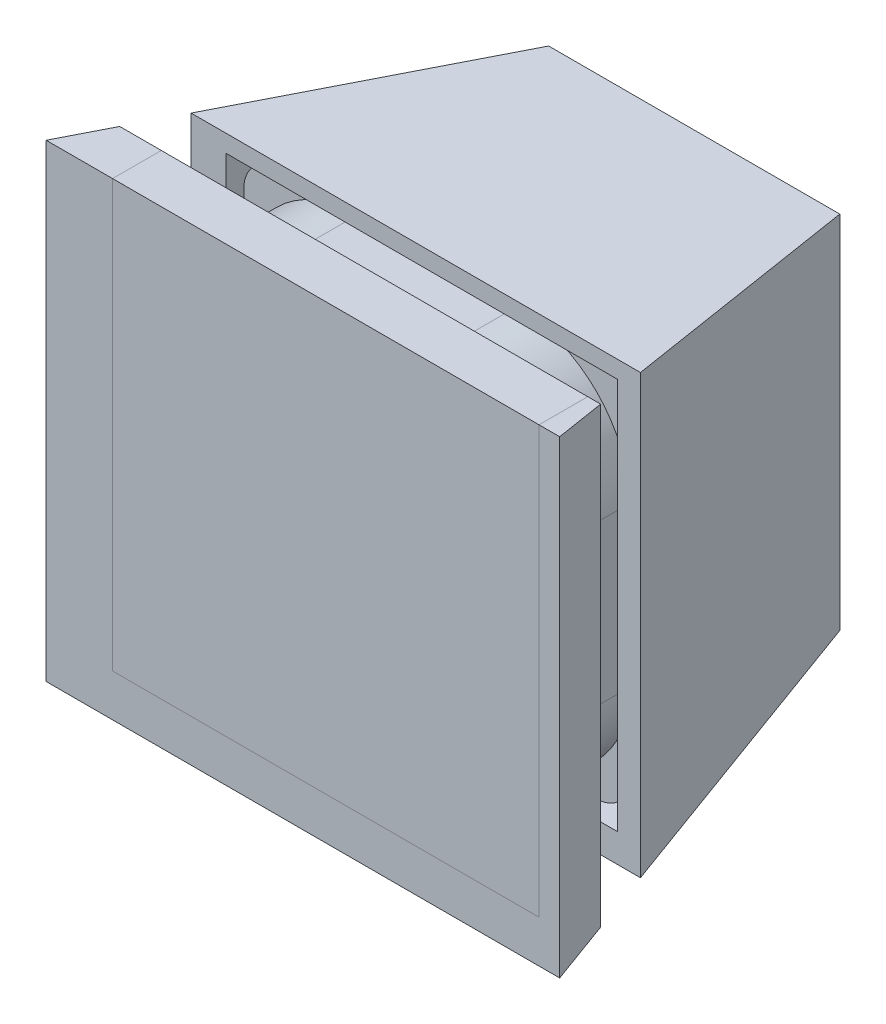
ISO-10303-21;
HEADER;
FILE_DESCRIPTION(('STEP AP214'),'2;1');
FILE_NAME('part.step','',(''),(''),'','','');
FILE_SCHEMA(('AUTOMOTIVE_DESIGN { 1 0 10303 214 1 1 1 1 }'));
ENDSEC;
DATA;
#1=APPLICATION_CONTEXT('core data for automotive mechanical design processes');
#2=APPLICATION_PROTOCOL_DEFINITION('international standard','automotive_design',2000,#1);
#3=PRODUCT_CONTEXT('',#1,'mechanical');
#4=PRODUCT('Part','Part','',(#3));
#5=PRODUCT_RELATED_PRODUCT_CATEGORY('part','',(#4));
#6=PRODUCT_DEFINITION_FORMATION('','',#4);
#7=PRODUCT_DEFINITION_CONTEXT('part definition',#1,'design');
#8=PRODUCT_DEFINITION('design','',#6,#7);
#9=PRODUCT_DEFINITION_SHAPE('','',#8);
#10=(LENGTH_UNIT() NAMED_UNIT(*) SI_UNIT(.MILLI.,.METRE.));
#11=(NAMED_UNIT(*) PLANE_ANGLE_UNIT() SI_UNIT($,.RADIAN.));
#12=(NAMED_UNIT(*) SI_UNIT($,.STERADIAN.) SOLID_ANGLE_UNIT());
#13=UNCERTAINTY_MEASURE_WITH_UNIT(LENGTH_MEASURE(1.E-05),#10,'distance_accuracy_value','');
#14=(GEOMETRIC_REPRESENTATION_CONTEXT(3) GLOBAL_UNCERTAINTY_ASSIGNED_CONTEXT((#13)) GLOBAL_UNIT_ASSIGNED_CONTEXT((#10,
#11,#12)) REPRESENTATION_CONTEXT('',''));
#15=CARTESIAN_POINT('',(0.,0.,0.));
#16=DIRECTION('',(0.,0.,1.));
#17=DIRECTION('',(1.,0.,0.));
#18=AXIS2_PLACEMENT_3D('',#15,#16,#17);
#19=CARTESIAN_POINT('',(13.6,40.6000000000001,-20.7999999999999));
#20=DIRECTION('',(0.,-1.,0.));
#21=DIRECTION('',(-1.,0.,0.));
#22=AXIS2_PLACEMENT_3D('',#19,#20,#21);
#23=PLANE('',#22);
#24=DIRECTION('',(0.,0.,1.));
#25=VECTOR('',#24,1.);
#26=CARTESIAN_POINT('',(25.6,40.6000000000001,-20.7999999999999));
#27=LINE('',#26,#25);
#28=CARTESIAN_POINT('',(25.6,40.6000000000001,-20.7999999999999));
#29=VERTEX_POINT('',#28);
#30=CARTESIAN_POINT('',(25.6,40.6000000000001,-16.8999999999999));
#31=VERTEX_POINT('',#30);
#32=EDGE_CURVE('E172',#29,#31,#27,.T.);
#33=ORIENTED_EDGE('',*,*,#32,.F.);
#34=DIRECTION('',(1.,0.,0.));
#35=VECTOR('',#34,1.);
#36=CARTESIAN_POINT('',(13.6,40.6000000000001,-20.7999999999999));
#37=LINE('',#36,#35);
#38=CARTESIAN_POINT('',(13.6,40.6000000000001,-20.7999999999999));
#39=VERTEX_POINT('',#38);
#40=EDGE_CURVE('E171',#39,#29,#37,.T.);
#41=ORIENTED_EDGE('',*,*,#40,.F.);
#42=DIRECTION('',(0.,0.,1.));
#43=VECTOR('',#42,1.);
#44=CARTESIAN_POINT('',(13.6,40.6000000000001,-20.7999999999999));
#45=LINE('',#44,#43);
#46=CARTESIAN_POINT('',(13.6,40.6000000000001,-16.8999999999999));
#47=VERTEX_POINT('',#46);
#48=EDGE_CURVE('E166',#39,#47,#45,.T.);
#49=ORIENTED_EDGE('',*,*,#48,.T.);
#50=DIRECTION('',(1.,0.,0.));
#51=VECTOR('',#50,1.);
#52=CARTESIAN_POINT('',(13.6,40.6000000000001,-16.8999999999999));
#53=LINE('',#52,#51);
#54=EDGE_CURVE('E13',#47,#31,#53,.T.);
#55=ORIENTED_EDGE('',*,*,#54,.T.);
#56=EDGE_LOOP('',(#33,#41,#49,#55));
#57=FACE_BOUND('',#56,.T.);
#58=ADVANCED_FACE('F109',(#57),#23,.F.);
#59=CARTESIAN_POINT('',(13.6,40.6000000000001,-16.8999999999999));
#60=DIRECTION('',(0.,0.70710678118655,-0.707106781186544));
#61=DIRECTION('',(0.,0.707106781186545,0.70710678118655));
#62=AXIS2_PLACEMENT_3D('',#59,#60,#61);
#63=PLANE('',#62);
#64=DIRECTION('',(0.,-0.707106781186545,-0.70710678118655));
#65=VECTOR('',#64,1.);
#66=CARTESIAN_POINT('',(25.6,40.6000000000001,-16.8999999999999));
#67=LINE('',#66,#65);
#68=CARTESIAN_POINT('',(25.6,39.4000000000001,-18.0999999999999));
#69=VERTEX_POINT('',#68);
#70=EDGE_CURVE('E174',#31,#69,#67,.T.);
#71=ORIENTED_EDGE('',*,*,#70,.F.);
#72=ORIENTED_EDGE('',*,*,#54,.F.);
#73=DIRECTION('',(0.,-0.707106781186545,-0.70710678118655));
#74=VECTOR('',#73,1.);
#75=CARTESIAN_POINT('',(13.6,40.6000000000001,-16.8999999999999));
#76=LINE('',#75,#74);
#77=CARTESIAN_POINT('',(13.6,39.4000000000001,-18.0999999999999));
#78=VERTEX_POINT('',#77);
#79=EDGE_CURVE('E150',#47,#78,#76,.T.);
#80=ORIENTED_EDGE('',*,*,#79,.T.);
#81=DIRECTION('',(1.,0.,0.));
#82=VECTOR('',#81,1.);
#83=CARTESIAN_POINT('',(13.6,39.4000000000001,-18.0999999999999));
#84=LINE('',#83,#82);
#85=EDGE_CURVE('E117',#78,#69,#84,.T.);
#86=ORIENTED_EDGE('',*,*,#85,.T.);
#87=EDGE_LOOP('',(#71,#72,#80,#86));
#88=FACE_BOUND('',#87,.T.);
#89=ADVANCED_FACE('F164',(#88),#63,.F.);
#90=CARTESIAN_POINT('',(13.6,39.4000000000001,-18.0999999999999));
#91=DIRECTION('',(0.,1.,0.));
#92=DIRECTION('',(0.,0.,1.));
#93=AXIS2_PLACEMENT_3D('',#90,#91,#92);
#94=PLANE('',#93);
#95=DIRECTION('',(0.,0.,-1.));
#96=VECTOR('',#95,1.);
#97=CARTESIAN_POINT('',(25.6,39.4000000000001,-18.0999999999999));
#98=LINE('',#97,#96);
#99=CARTESIAN_POINT('',(25.6,39.4000000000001,-19.5999999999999));
#100=VERTEX_POINT('',#99);
#101=EDGE_CURVE('E160',#69,#100,#98,.T.);
#102=ORIENTED_EDGE('',*,*,#101,.F.);
#103=ORIENTED_EDGE('',*,*,#85,.F.);
#104=DIRECTION('',(0.,0.,-1.));
#105=VECTOR('',#104,1.);
#106=CARTESIAN_POINT('',(13.6,39.4000000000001,-18.0999999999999));
#107=LINE('',#106,#105);
#108=CARTESIAN_POINT('',(13.6,39.4000000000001,-19.5999999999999));
#109=VERTEX_POINT('',#108);
#110=EDGE_CURVE('E153',#78,#109,#107,.T.);
#111=ORIENTED_EDGE('',*,*,#110,.T.);
#112=DIRECTION('',(1.,0.,0.));
#113=VECTOR('',#112,1.);
#114=CARTESIAN_POINT('',(13.6,39.4000000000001,-19.5999999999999));
#115=LINE('',#114,#113);
#116=EDGE_CURVE('E163',#109,#100,#115,.T.);
#117=ORIENTED_EDGE('',*,*,#116,.T.);
#118=EDGE_LOOP('',(#102,#103,#111,#117));
#119=FACE_BOUND('',#118,.T.);
#120=ADVANCED_FACE('F159',(#119),#94,.F.);
#121=CARTESIAN_POINT('',(13.6,39.4000000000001,-19.5999999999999));
#122=DIRECTION('',(0.,0.70710678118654,0.707106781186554));
#123=DIRECTION('',(0.,-0.707106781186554,0.707106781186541));
#124=AXIS2_PLACEMENT_3D('',#121,#122,#123);
#125=PLANE('',#124);
#126=DIRECTION('',(0.,0.707106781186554,-0.707106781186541));
#127=VECTOR('',#126,1.);
#128=CARTESIAN_POINT('',(25.6,39.4000000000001,-19.5999999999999));
#129=LINE('',#128,#127);
#130=EDGE_CURVE('E139',#100,#29,#129,.T.);
#131=ORIENTED_EDGE('',*,*,#130,.F.);
#132=ORIENTED_EDGE('',*,*,#116,.F.);
#133=DIRECTION('',(0.,0.707106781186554,-0.707106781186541));
#134=VECTOR('',#133,1.);
#135=CARTESIAN_POINT('',(13.6,39.4000000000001,-19.5999999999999));
#136=LINE('',#135,#134);
#137=EDGE_CURVE('E125',#109,#39,#136,.T.);
#138=ORIENTED_EDGE('',*,*,#137,.T.);
#139=ORIENTED_EDGE('',*,*,#40,.T.);
#140=EDGE_LOOP('',(#131,#132,#138,#139));
#141=FACE_BOUND('',#140,.T.);
#142=ADVANCED_FACE('F183',(#141),#125,.F.);
#143=CARTESIAN_POINT('',(13.6,0.,0.));
#144=DIRECTION('',(-1.,0.,0.));
#145=DIRECTION('',(0.,0.,1.));
#146=AXIS2_PLACEMENT_3D('',#143,#144,#145);
#147=PLANE('',#146);
#148=ORIENTED_EDGE('',*,*,#48,.F.);
#149=ORIENTED_EDGE('',*,*,#137,.F.);
#150=ORIENTED_EDGE('',*,*,#110,.F.);
#151=ORIENTED_EDGE('',*,*,#79,.F.);
#152=EDGE_LOOP('',(#148,#149,#150,#151));
#153=FACE_BOUND('',#152,.T.);
#154=ADVANCED_FACE('F155',(#153),#147,.T.);
#155=CARTESIAN_POINT('',(25.6,0.,0.));
#156=DIRECTION('',(-1.,0.,0.));
#157=DIRECTION('',(0.,0.,1.));
#158=AXIS2_PLACEMENT_3D('',#155,#156,#157);
#159=PLANE('',#158);
#160=ORIENTED_EDGE('',*,*,#32,.T.);
#161=ORIENTED_EDGE('',*,*,#70,.T.);
#162=ORIENTED_EDGE('',*,*,#101,.T.);
#163=ORIENTED_EDGE('',*,*,#130,.T.);
#164=EDGE_LOOP('',(#160,#161,#162,#163));
#165=FACE_BOUND('',#164,.T.);
#166=ADVANCED_FACE('F179',(#165),#159,.F.);
#167=CLOSED_SHELL('',(#58,#89,#120,#142,#154,#166));
#168=MANIFOLD_SOLID_BREP('B2',#167);
#169=CARTESIAN_POINT('',(-13.6000000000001,40.6000000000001,-20.7999999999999));
#170=DIRECTION('',(0.,-1.,0.));
#171=DIRECTION('',(1.,0.,0.));
#172=AXIS2_PLACEMENT_3D('',#169,#170,#171);
#173=PLANE('',#172);
#174=DIRECTION('',(0.,0.,1.));
#175=VECTOR('',#174,1.);
#176=CARTESIAN_POINT('',(-25.6000000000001,40.6000000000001,-20.7999999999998));
#177=LINE('',#176,#175);
#178=CARTESIAN_POINT('',(-25.6000000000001,40.6000000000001,-20.7999999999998));
#179=VERTEX_POINT('',#178);
#180=CARTESIAN_POINT('',(-25.6000000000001,40.6000000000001,-16.8999999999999));
#181=VERTEX_POINT('',#180);
#182=EDGE_CURVE('E322',#179,#181,#177,.T.);
#183=ORIENTED_EDGE('',*,*,#182,.T.);
#184=DIRECTION('',(-1.,0.,0.));
#185=VECTOR('',#184,1.);
#186=CARTESIAN_POINT('',(-13.6,40.6000000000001,-16.8999999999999));
#187=LINE('',#186,#185);
#188=CARTESIAN_POINT('',(-13.6,40.6000000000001,-16.8999999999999));
#189=VERTEX_POINT('',#188);
#190=EDGE_CURVE('E107',#189,#181,#187,.T.);
#191=ORIENTED_EDGE('',*,*,#190,.F.);
#192=DIRECTION('',(0.,0.,1.));
#193=VECTOR('',#192,1.);
#194=CARTESIAN_POINT('',(-13.6000000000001,40.6000000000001,-20.7999999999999));
#195=LINE('',#194,#193);
#196=CARTESIAN_POINT('',(-13.6000000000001,40.6000000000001,-20.7999999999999));
#197=VERTEX_POINT('',#196);
#198=EDGE_CURVE('E309',#197,#189,#195,.T.);
#199=ORIENTED_EDGE('',*,*,#198,.F.);
#200=DIRECTION('',(-1.,0.,0.));
#201=VECTOR('',#200,1.);
#202=CARTESIAN_POINT('',(-13.6000000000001,40.6000000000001,-20.7999999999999));
#203=LINE('',#202,#201);
#204=EDGE_CURVE('E314',#197,#179,#203,.T.);
#205=ORIENTED_EDGE('',*,*,#204,.T.);
#206=EDGE_LOOP('',(#183,#191,#199,#205));
#207=FACE_BOUND('',#206,.T.);
#208=ADVANCED_FACE('F254',(#207),#173,.F.);
#209=CARTESIAN_POINT('',(-13.6,40.6000000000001,-16.8999999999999));
#210=DIRECTION('',(0.,0.70710678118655,-0.707106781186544));
#211=DIRECTION('',(0.,0.707106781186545,0.70710678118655));
#212=AXIS2_PLACEMENT_3D('',#209,#210,#211);
#213=PLANE('',#212);
#214=DIRECTION('',(0.,-0.707106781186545,-0.70710678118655));
#215=VECTOR('',#214,1.);
#216=CARTESIAN_POINT('',(-25.6000000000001,40.6000000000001,-16.8999999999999));
#217=LINE('',#216,#215);
#218=CARTESIAN_POINT('',(-25.6000000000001,39.4000000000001,-18.0999999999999));
#219=VERTEX_POINT('',#218);
#220=EDGE_CURVE('E313',#181,#219,#217,.T.);
#221=ORIENTED_EDGE('',*,*,#220,.T.);
#222=DIRECTION('',(-1.,0.,0.));
#223=VECTOR('',#222,1.);
#224=CARTESIAN_POINT('',(-13.6,39.4000000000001,-18.0999999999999));
#225=LINE('',#224,#223);
#226=CARTESIAN_POINT('',(-13.6,39.4000000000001,-18.0999999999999));
#227=VERTEX_POINT('',#226);
#228=EDGE_CURVE('E262',#227,#219,#225,.T.);
#229=ORIENTED_EDGE('',*,*,#228,.F.);
#230=DIRECTION('',(0.,-0.707106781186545,-0.70710678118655));
#231=VECTOR('',#230,1.);
#232=CARTESIAN_POINT('',(-13.6,40.6000000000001,-16.8999999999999));
#233=LINE('',#232,#231);
#234=EDGE_CURVE('E296',#189,#227,#233,.T.);
#235=ORIENTED_EDGE('',*,*,#234,.F.);
#236=ORIENTED_EDGE('',*,*,#190,.T.);
#237=EDGE_LOOP('',(#221,#229,#235,#236));
#238=FACE_BOUND('',#237,.T.);
#239=ADVANCED_FACE('F312',(#238),#213,.F.);
#240=CARTESIAN_POINT('',(-13.6,39.4000000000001,-18.0999999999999));
#241=DIRECTION('',(0.,1.,0.));
#242=DIRECTION('',(0.,0.,1.));
#243=AXIS2_PLACEMENT_3D('',#240,#241,#242);
#244=PLANE('',#243);
#245=DIRECTION('',(0.,0.,-1.));
#246=VECTOR('',#245,1.);
#247=CARTESIAN_POINT('',(-25.6000000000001,39.4000000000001,-18.0999999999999));
#248=LINE('',#247,#246);
#249=CARTESIAN_POINT('',(-25.6000000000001,39.4000000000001,-19.5999999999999));
#250=VERTEX_POINT('',#249);
#251=EDGE_CURVE('E319',#219,#250,#248,.T.);
#252=ORIENTED_EDGE('',*,*,#251,.T.);
#253=DIRECTION('',(-1.,0.,0.));
#254=VECTOR('',#253,1.);
#255=CARTESIAN_POINT('',(-13.6000000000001,39.4000000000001,-19.5999999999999));
#256=LINE('',#255,#254);
#257=CARTESIAN_POINT('',(-13.6000000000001,39.4000000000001,-19.5999999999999));
#258=VERTEX_POINT('',#257);
#259=EDGE_CURVE('E305',#258,#250,#256,.T.);
#260=ORIENTED_EDGE('',*,*,#259,.F.);
#261=DIRECTION('',(0.,0.,-1.));
#262=VECTOR('',#261,1.);
#263=CARTESIAN_POINT('',(-13.6,39.4000000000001,-18.0999999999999));
#264=LINE('',#263,#262);
#265=EDGE_CURVE('E301',#227,#258,#264,.T.);
#266=ORIENTED_EDGE('',*,*,#265,.F.);
#267=ORIENTED_EDGE('',*,*,#228,.T.);
#268=EDGE_LOOP('',(#252,#260,#266,#267));
#269=FACE_BOUND('',#268,.T.);
#270=ADVANCED_FACE('F303',(#269),#244,.F.);
#271=CARTESIAN_POINT('',(-13.6000000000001,39.4000000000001,-19.5999999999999));
#272=DIRECTION('',(0.,0.70710678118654,0.707106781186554));
#273=DIRECTION('',(0.,-0.707106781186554,0.707106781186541));
#274=AXIS2_PLACEMENT_3D('',#271,#272,#273);
#275=PLANE('',#274);
#276=DIRECTION('',(0.,0.707106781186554,-0.707106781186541));
#277=VECTOR('',#276,1.);
#278=CARTESIAN_POINT('',(-25.6000000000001,39.4000000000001,-19.5999999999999));
#279=LINE('',#278,#277);
#280=EDGE_CURVE('E286',#250,#179,#279,.T.);
#281=ORIENTED_EDGE('',*,*,#280,.T.);
#282=ORIENTED_EDGE('',*,*,#204,.F.);
#283=DIRECTION('',(0.,0.707106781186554,-0.707106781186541));
#284=VECTOR('',#283,1.);
#285=CARTESIAN_POINT('',(-13.6000000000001,39.4000000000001,-19.5999999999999));
#286=LINE('',#285,#284);
#287=EDGE_CURVE('E270',#258,#197,#286,.T.);
#288=ORIENTED_EDGE('',*,*,#287,.F.);
#289=ORIENTED_EDGE('',*,*,#259,.T.);
#290=EDGE_LOOP('',(#281,#282,#288,#289));
#291=FACE_BOUND('',#290,.T.);
#292=ADVANCED_FACE('F333',(#291),#275,.F.);
#293=CARTESIAN_POINT('',(-13.6,0.,0.));
#294=DIRECTION('',(1.,0.,0.));
#295=DIRECTION('',(0.,0.,1.));
#296=AXIS2_PLACEMENT_3D('',#293,#294,#295);
#297=PLANE('',#296);
#298=ORIENTED_EDGE('',*,*,#198,.T.);
#299=ORIENTED_EDGE('',*,*,#234,.T.);
#300=ORIENTED_EDGE('',*,*,#265,.T.);
#301=ORIENTED_EDGE('',*,*,#287,.T.);
#302=EDGE_LOOP('',(#298,#299,#300,#301));
#303=FACE_BOUND('',#302,.T.);
#304=ADVANCED_FACE('F307',(#303),#297,.T.);
#305=CARTESIAN_POINT('',(-25.6,0.,0.));
#306=DIRECTION('',(1.,0.,0.));
#307=DIRECTION('',(0.,0.,1.));
#308=AXIS2_PLACEMENT_3D('',#305,#306,#307);
#309=PLANE('',#308);
#310=ORIENTED_EDGE('',*,*,#182,.F.);
#311=ORIENTED_EDGE('',*,*,#280,.F.);
#312=ORIENTED_EDGE('',*,*,#251,.F.);
#313=ORIENTED_EDGE('',*,*,#220,.F.);
#314=EDGE_LOOP('',(#310,#311,#312,#313));
#315=FACE_BOUND('',#314,.T.);
#316=ADVANCED_FACE('F327',(#315),#309,.F.);
#317=CLOSED_SHELL('',(#208,#239,#270,#292,#304,#316));
#318=MANIFOLD_SOLID_BREP('B7',#317);
#319=CARTESIAN_POINT('',(-13.6,-40.6000000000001,-20.7999999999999));
#320=DIRECTION('',(0.,1.,0.));
#321=DIRECTION('',(1.,0.,0.));
#322=AXIS2_PLACEMENT_3D('',#319,#320,#321);
#323=PLANE('',#322);
#324=DIRECTION('',(0.,0.,1.));
#325=VECTOR('',#324,1.);
#326=CARTESIAN_POINT('',(-25.6,-40.6000000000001,-20.7999999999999));
#327=LINE('',#326,#325);
#328=CARTESIAN_POINT('',(-25.6,-40.6000000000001,-20.7999999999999));
#329=VERTEX_POINT('',#328);
#330=CARTESIAN_POINT('',(-25.6,-40.6000000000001,-16.8999999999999));
#331=VERTEX_POINT('',#330);
#332=EDGE_CURVE('E462',#329,#331,#327,.T.);
#333=ORIENTED_EDGE('',*,*,#332,.F.);
#334=DIRECTION('',(-1.,0.,0.));
#335=VECTOR('',#334,1.);
#336=CARTESIAN_POINT('',(-13.6,-40.6000000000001,-20.7999999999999));
#337=LINE('',#336,#335);
#338=CARTESIAN_POINT('',(-13.6,-40.6000000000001,-20.7999999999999));
#339=VERTEX_POINT('',#338);
#340=EDGE_CURVE('E461',#339,#329,#337,.T.);
#341=ORIENTED_EDGE('',*,*,#340,.F.);
#342=DIRECTION('',(0.,0.,1.));
#343=VECTOR('',#342,1.);
#344=CARTESIAN_POINT('',(-13.6,-40.6000000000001,-20.7999999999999));
#345=LINE('',#344,#343);
#346=CARTESIAN_POINT('',(-13.6,-40.6000000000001,-16.9));
#347=VERTEX_POINT('',#346);
#348=EDGE_CURVE('E456',#339,#347,#345,.T.);
#349=ORIENTED_EDGE('',*,*,#348,.T.);
#350=DIRECTION('',(-1.,0.,0.));
#351=VECTOR('',#350,1.);
#352=CARTESIAN_POINT('',(-13.6,-40.6000000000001,-16.9));
#353=LINE('',#352,#351);
#354=EDGE_CURVE('E252',#347,#331,#353,.T.);
#355=ORIENTED_EDGE('',*,*,#354,.T.);
#356=EDGE_LOOP('',(#333,#341,#349,#355));
#357=FACE_BOUND('',#356,.T.);
#358=ADVANCED_FACE('F399',(#357),#323,.F.);
#359=CARTESIAN_POINT('',(-13.6,-40.6000000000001,-16.9));
#360=DIRECTION('',(0.,-0.707106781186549,-0.707106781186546));
#361=DIRECTION('',(0.,-0.707106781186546,0.707106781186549));
#362=AXIS2_PLACEMENT_3D('',#359,#360,#361);
#363=PLANE('',#362);
#364=DIRECTION('',(0.,0.707106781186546,-0.707106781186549));
#365=VECTOR('',#364,1.);
#366=CARTESIAN_POINT('',(-25.6,-40.6000000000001,-16.8999999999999));
#367=LINE('',#366,#365);
#368=CARTESIAN_POINT('',(-25.6,-39.4000000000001,-18.0999999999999));
#369=VERTEX_POINT('',#368);
#370=EDGE_CURVE('E464',#331,#369,#367,.T.);
#371=ORIENTED_EDGE('',*,*,#370,.F.);
#372=ORIENTED_EDGE('',*,*,#354,.F.);
#373=DIRECTION('',(0.,0.707106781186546,-0.707106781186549));
#374=VECTOR('',#373,1.);
#375=CARTESIAN_POINT('',(-13.6,-40.6000000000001,-16.9));
#376=LINE('',#375,#374);
#377=CARTESIAN_POINT('',(-13.6,-39.4000000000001,-18.1));
#378=VERTEX_POINT('',#377);
#379=EDGE_CURVE('E440',#347,#378,#376,.T.);
#380=ORIENTED_EDGE('',*,*,#379,.T.);
#381=DIRECTION('',(-1.,0.,0.));
#382=VECTOR('',#381,1.);
#383=CARTESIAN_POINT('',(-13.6,-39.4000000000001,-18.1));
#384=LINE('',#383,#382);
#385=EDGE_CURVE('E407',#378,#369,#384,.T.);
#386=ORIENTED_EDGE('',*,*,#385,.T.);
#387=EDGE_LOOP('',(#371,#372,#380,#386));
#388=FACE_BOUND('',#387,.T.);
#389=ADVANCED_FACE('F454',(#388),#363,.F.);
#390=CARTESIAN_POINT('',(-13.6,-39.4000000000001,-18.1));
#391=DIRECTION('',(0.,-1.,0.));
#392=DIRECTION('',(0.,0.,1.));
#393=AXIS2_PLACEMENT_3D('',#390,#391,#392);
#394=PLANE('',#393);
#395=DIRECTION('',(0.,0.,-1.));
#396=VECTOR('',#395,1.);
#397=CARTESIAN_POINT('',(-25.6,-39.4000000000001,-18.0999999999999));
#398=LINE('',#397,#396);
#399=CARTESIAN_POINT('',(-25.6,-39.4000000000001,-19.5999999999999));
#400=VERTEX_POINT('',#399);
#401=EDGE_CURVE('E450',#369,#400,#398,.T.);
#402=ORIENTED_EDGE('',*,*,#401,.F.);
#403=ORIENTED_EDGE('',*,*,#385,.F.);
#404=DIRECTION('',(0.,0.,-1.));
#405=VECTOR('',#404,1.);
#406=CARTESIAN_POINT('',(-13.6,-39.4000000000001,-18.1));
#407=LINE('',#406,#405);
#408=CARTESIAN_POINT('',(-13.6,-39.4,-19.6));
#409=VERTEX_POINT('',#408);
#410=EDGE_CURVE('E443',#378,#409,#407,.T.);
#411=ORIENTED_EDGE('',*,*,#410,.T.);
#412=DIRECTION('',(-1.,0.,0.));
#413=VECTOR('',#412,1.);
#414=CARTESIAN_POINT('',(-13.6,-39.4,-19.6));
#415=LINE('',#414,#413);
#416=EDGE_CURVE('E453',#409,#400,#415,.T.);
#417=ORIENTED_EDGE('',*,*,#416,.T.);
#418=EDGE_LOOP('',(#402,#403,#411,#417));
#419=FACE_BOUND('',#418,.T.);
#420=ADVANCED_FACE('F449',(#419),#394,.F.);
#421=CARTESIAN_POINT('',(-13.6,-39.4,-19.6));
#422=DIRECTION('',(0.,-0.707106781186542,0.707106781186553));
#423=DIRECTION('',(0.,0.707106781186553,0.707106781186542));
#424=AXIS2_PLACEMENT_3D('',#421,#422,#423);
#425=PLANE('',#424);
#426=DIRECTION('',(0.,-0.707106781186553,-0.707106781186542));
#427=VECTOR('',#426,1.);
#428=CARTESIAN_POINT('',(-25.6,-39.4000000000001,-19.5999999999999));
#429=LINE('',#428,#427);
#430=EDGE_CURVE('E429',#400,#329,#429,.T.);
#431=ORIENTED_EDGE('',*,*,#430,.F.);
#432=ORIENTED_EDGE('',*,*,#416,.F.);
#433=DIRECTION('',(0.,-0.707106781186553,-0.707106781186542));
#434=VECTOR('',#433,1.);
#435=CARTESIAN_POINT('',(-13.6,-39.4,-19.6));
#436=LINE('',#435,#434);
#437=EDGE_CURVE('E415',#409,#339,#436,.T.);
#438=ORIENTED_EDGE('',*,*,#437,.T.);
#439=ORIENTED_EDGE('',*,*,#340,.T.);
#440=EDGE_LOOP('',(#431,#432,#438,#439));
#441=FACE_BOUND('',#440,.T.);
#442=ADVANCED_FACE('F473',(#441),#425,.F.);
#443=CARTESIAN_POINT('',(-13.6,0.,0.));
#444=DIRECTION('',(1.,0.,0.));
#445=DIRECTION('',(0.,0.,1.));
#446=AXIS2_PLACEMENT_3D('',#443,#444,#445);
#447=PLANE('',#446);
#448=ORIENTED_EDGE('',*,*,#348,.F.);
#449=ORIENTED_EDGE('',*,*,#437,.F.);
#450=ORIENTED_EDGE('',*,*,#410,.F.);
#451=ORIENTED_EDGE('',*,*,#379,.F.);
#452=EDGE_LOOP('',(#448,#449,#450,#451));
#453=FACE_BOUND('',#452,.T.);
#454=ADVANCED_FACE('F445',(#453),#447,.T.);
#455=CARTESIAN_POINT('',(-25.6,0.,0.));
#456=DIRECTION('',(1.,0.,0.));
#457=DIRECTION('',(0.,0.,1.));
#458=AXIS2_PLACEMENT_3D('',#455,#456,#457);
#459=PLANE('',#458);
#460=ORIENTED_EDGE('',*,*,#332,.T.);
#461=ORIENTED_EDGE('',*,*,#370,.T.);
#462=ORIENTED_EDGE('',*,*,#401,.T.);
#463=ORIENTED_EDGE('',*,*,#430,.T.);
#464=EDGE_LOOP('',(#460,#461,#462,#463));
#465=FACE_BOUND('',#464,.T.);
#466=ADVANCED_FACE('F469',(#465),#459,.F.);
#467=CLOSED_SHELL('',(#358,#389,#420,#442,#454,#466));
#468=MANIFOLD_SOLID_BREP('B101',#467);
#469=CARTESIAN_POINT('',(13.6,-40.6000000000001,-20.8));
#470=DIRECTION('',(0.,1.,0.));
#471=DIRECTION('',(-1.,0.,0.));
#472=AXIS2_PLACEMENT_3D('',#469,#470,#471);
#473=PLANE('',#472);
#474=DIRECTION('',(0.,0.,1.));
#475=VECTOR('',#474,1.);
#476=CARTESIAN_POINT('',(25.6,-40.6,-20.8));
#477=LINE('',#476,#475);
#478=CARTESIAN_POINT('',(25.6,-40.6,-20.8));
#479=VERTEX_POINT('',#478);
#480=CARTESIAN_POINT('',(25.6,-40.6,-16.9));
#481=VERTEX_POINT('',#480);
#482=EDGE_CURVE('E612',#479,#481,#477,.T.);
#483=ORIENTED_EDGE('',*,*,#482,.T.);
#484=DIRECTION('',(1.,0.,0.));
#485=VECTOR('',#484,1.);
#486=CARTESIAN_POINT('',(13.6,-40.6000000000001,-16.9));
#487=LINE('',#486,#485);
#488=CARTESIAN_POINT('',(13.6,-40.6000000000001,-16.9));
#489=VERTEX_POINT('',#488);
#490=EDGE_CURVE('E397',#489,#481,#487,.T.);
#491=ORIENTED_EDGE('',*,*,#490,.F.);
#492=DIRECTION('',(0.,0.,1.));
#493=VECTOR('',#492,1.);
#494=CARTESIAN_POINT('',(13.6,-40.6000000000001,-20.8));
#495=LINE('',#494,#493);
#496=CARTESIAN_POINT('',(13.6,-40.6000000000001,-20.8));
#497=VERTEX_POINT('',#496);
#498=EDGE_CURVE('E599',#497,#489,#495,.T.);
#499=ORIENTED_EDGE('',*,*,#498,.F.);
#500=DIRECTION('',(1.,0.,0.));
#501=VECTOR('',#500,1.);
#502=CARTESIAN_POINT('',(13.6,-40.6000000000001,-20.8));
#503=LINE('',#502,#501);
#504=EDGE_CURVE('E604',#497,#479,#503,.T.);
#505=ORIENTED_EDGE('',*,*,#504,.T.);
#506=EDGE_LOOP('',(#483,#491,#499,#505));
#507=FACE_BOUND('',#506,.T.);
#508=ADVANCED_FACE('F544',(#507),#473,.F.);
#509=CARTESIAN_POINT('',(13.6,-40.6000000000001,-16.9));
#510=DIRECTION('',(0.,-0.707106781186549,-0.707106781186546));
#511=DIRECTION('',(0.,-0.707106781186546,0.707106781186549));
#512=AXIS2_PLACEMENT_3D('',#509,#510,#511);
#513=PLANE('',#512);
#514=DIRECTION('',(0.,0.707106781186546,-0.707106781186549));
#515=VECTOR('',#514,1.);
#516=CARTESIAN_POINT('',(25.6,-40.6,-16.9));
#517=LINE('',#516,#515);
#518=CARTESIAN_POINT('',(25.6,-39.4000000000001,-18.1));
#519=VERTEX_POINT('',#518);
#520=EDGE_CURVE('E603',#481,#519,#517,.T.);
#521=ORIENTED_EDGE('',*,*,#520,.T.);
#522=DIRECTION('',(1.,0.,0.));
#523=VECTOR('',#522,1.);
#524=CARTESIAN_POINT('',(13.6,-39.4000000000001,-18.1));
#525=LINE('',#524,#523);
#526=CARTESIAN_POINT('',(13.6,-39.4000000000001,-18.1));
#527=VERTEX_POINT('',#526);
#528=EDGE_CURVE('E552',#527,#519,#525,.T.);
#529=ORIENTED_EDGE('',*,*,#528,.F.);
#530=DIRECTION('',(0.,0.707106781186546,-0.707106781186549));
#531=VECTOR('',#530,1.);
#532=CARTESIAN_POINT('',(13.6,-40.6000000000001,-16.9));
#533=LINE('',#532,#531);
#534=EDGE_CURVE('E586',#489,#527,#533,.T.);
#535=ORIENTED_EDGE('',*,*,#534,.F.);
#536=ORIENTED_EDGE('',*,*,#490,.T.);
#537=EDGE_LOOP('',(#521,#529,#535,#536));
#538=FACE_BOUND('',#537,.T.);
#539=ADVANCED_FACE('F602',(#538),#513,.F.);
#540=CARTESIAN_POINT('',(13.6,-39.4000000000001,-18.1));
#541=DIRECTION('',(0.,-1.,0.));
#542=DIRECTION('',(0.,0.,1.));
#543=AXIS2_PLACEMENT_3D('',#540,#541,#542);
#544=PLANE('',#543);
#545=DIRECTION('',(0.,0.,-1.));
#546=VECTOR('',#545,1.);
#547=CARTESIAN_POINT('',(25.6,-39.4000000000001,-18.1));
#548=LINE('',#547,#546);
#549=CARTESIAN_POINT('',(25.6,-39.4,-19.6));
#550=VERTEX_POINT('',#549);
#551=EDGE_CURVE('E609',#519,#550,#548,.T.);
#552=ORIENTED_EDGE('',*,*,#551,.T.);
#553=DIRECTION('',(1.,0.,0.));
#554=VECTOR('',#553,1.);
#555=CARTESIAN_POINT('',(13.6,-39.4,-19.6));
#556=LINE('',#555,#554);
#557=CARTESIAN_POINT('',(13.6,-39.4,-19.6));
#558=VERTEX_POINT('',#557);
#559=EDGE_CURVE('E595',#558,#550,#556,.T.);
#560=ORIENTED_EDGE('',*,*,#559,.F.);
#561=DIRECTION('',(0.,0.,-1.));
#562=VECTOR('',#561,1.);
#563=CARTESIAN_POINT('',(13.6,-39.4000000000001,-18.1));
#564=LINE('',#563,#562);
#565=EDGE_CURVE('E591',#527,#558,#564,.T.);
#566=ORIENTED_EDGE('',*,*,#565,.F.);
#567=ORIENTED_EDGE('',*,*,#528,.T.);
#568=EDGE_LOOP('',(#552,#560,#566,#567));
#569=FACE_BOUND('',#568,.T.);
#570=ADVANCED_FACE('F593',(#569),#544,.F.);
#571=CARTESIAN_POINT('',(13.6,-39.4,-19.6));
#572=DIRECTION('',(0.,-0.707106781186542,0.707106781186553));
#573=DIRECTION('',(0.,0.707106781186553,0.707106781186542));
#574=AXIS2_PLACEMENT_3D('',#571,#572,#573);
#575=PLANE('',#574);
#576=DIRECTION('',(0.,-0.707106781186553,-0.707106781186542));
#577=VECTOR('',#576,1.);
#578=CARTESIAN_POINT('',(25.6,-39.4,-19.6));
#579=LINE('',#578,#577);
#580=EDGE_CURVE('E576',#550,#479,#579,.T.);
#581=ORIENTED_EDGE('',*,*,#580,.T.);
#582=ORIENTED_EDGE('',*,*,#504,.F.);
#583=DIRECTION('',(0.,-0.707106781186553,-0.707106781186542));
#584=VECTOR('',#583,1.);
#585=CARTESIAN_POINT('',(13.6,-39.4,-19.6));
#586=LINE('',#585,#584);
#587=EDGE_CURVE('E560',#558,#497,#586,.T.);
#588=ORIENTED_EDGE('',*,*,#587,.F.);
#589=ORIENTED_EDGE('',*,*,#559,.T.);
#590=EDGE_LOOP('',(#581,#582,#588,#589));
#591=FACE_BOUND('',#590,.T.);
#592=ADVANCED_FACE('F623',(#591),#575,.F.);
#593=CARTESIAN_POINT('',(13.6,0.,0.));
#594=DIRECTION('',(-1.,0.,0.));
#595=DIRECTION('',(0.,0.,1.));
#596=AXIS2_PLACEMENT_3D('',#593,#594,#595);
#597=PLANE('',#596);
#598=ORIENTED_EDGE('',*,*,#498,.T.);
#599=ORIENTED_EDGE('',*,*,#534,.T.);
#600=ORIENTED_EDGE('',*,*,#565,.T.);
#601=ORIENTED_EDGE('',*,*,#587,.T.);
#602=EDGE_LOOP('',(#598,#599,#600,#601));
#603=FACE_BOUND('',#602,.T.);
#604=ADVANCED_FACE('F597',(#603),#597,.T.);
#605=CARTESIAN_POINT('',(25.6,0.,0.));
#606=DIRECTION('',(-1.,0.,0.));
#607=DIRECTION('',(0.,0.,1.));
#608=AXIS2_PLACEMENT_3D('',#605,#606,#607);
#609=PLANE('',#608);
#610=ORIENTED_EDGE('',*,*,#482,.F.);
#611=ORIENTED_EDGE('',*,*,#580,.F.);
#612=ORIENTED_EDGE('',*,*,#551,.F.);
#613=ORIENTED_EDGE('',*,*,#520,.F.);
#614=EDGE_LOOP('',(#610,#611,#612,#613));
#615=FACE_BOUND('',#614,.T.);
#616=ADVANCED_FACE('F617',(#615),#609,.F.);
#617=CLOSED_SHELL('',(#508,#539,#570,#592,#604,#616));
#618=MANIFOLD_SOLID_BREP('B246',#617);
#619=CARTESIAN_POINT('',(40.6000000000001,-13.6,-20.7999999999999));
#620=DIRECTION('',(-1.,0.,0.));
#621=DIRECTION('',(0.,1.,0.));
#622=AXIS2_PLACEMENT_3D('',#619,#620,#621);
#623=PLANE('',#622);
#624=DIRECTION('',(0.,0.,1.));
#625=VECTOR('',#624,1.);
#626=CARTESIAN_POINT('',(40.6000000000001,-25.6,-20.7999999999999));
#627=LINE('',#626,#625);
#628=CARTESIAN_POINT('',(40.6000000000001,-25.6,-20.7999999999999));
#629=VERTEX_POINT('',#628);
#630=CARTESIAN_POINT('',(40.6000000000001,-25.6,-16.8999999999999));
#631=VERTEX_POINT('',#630);
#632=EDGE_CURVE('E752',#629,#631,#627,.T.);
#633=ORIENTED_EDGE('',*,*,#632,.F.);
#634=DIRECTION('',(0.,-1.,0.));
#635=VECTOR('',#634,1.);
#636=CARTESIAN_POINT('',(40.6000000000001,-13.6,-20.7999999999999));
#637=LINE('',#636,#635);
#638=CARTESIAN_POINT('',(40.6000000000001,-13.6,-20.7999999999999));
#639=VERTEX_POINT('',#638);
#640=EDGE_CURVE('E751',#639,#629,#637,.T.);
#641=ORIENTED_EDGE('',*,*,#640,.F.);
#642=DIRECTION('',(0.,0.,1.));
#643=VECTOR('',#642,1.);
#644=CARTESIAN_POINT('',(40.6000000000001,-13.6,-20.7999999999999));
#645=LINE('',#644,#643);
#646=CARTESIAN_POINT('',(40.6000000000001,-13.6,-16.8999999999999));
#647=VERTEX_POINT('',#646);
#648=EDGE_CURVE('E746',#639,#647,#645,.T.);
#649=ORIENTED_EDGE('',*,*,#648,.T.);
#650=DIRECTION('',(0.,-1.,0.));
#651=VECTOR('',#650,1.);
#652=CARTESIAN_POINT('',(40.6000000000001,-13.6,-16.8999999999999));
#653=LINE('',#652,#651);
#654=EDGE_CURVE('E542',#647,#631,#653,.T.);
#655=ORIENTED_EDGE('',*,*,#654,.T.);
#656=EDGE_LOOP('',(#633,#641,#649,#655));
#657=FACE_BOUND('',#656,.T.);
#658=ADVANCED_FACE('F689',(#657),#623,.F.);
#659=CARTESIAN_POINT('',(40.6000000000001,-13.6,-16.8999999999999));
#660=DIRECTION('',(0.707106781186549,0.,-0.707106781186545));
#661=DIRECTION('',(0.707106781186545,0.,0.70710678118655));
#662=AXIS2_PLACEMENT_3D('',#659,#660,#661);
#663=PLANE('',#662);
#664=DIRECTION('',(-0.707106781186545,0.,-0.70710678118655));
#665=VECTOR('',#664,1.);
#666=CARTESIAN_POINT('',(40.6000000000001,-25.6,-16.8999999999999));
#667=LINE('',#666,#665);
#668=CARTESIAN_POINT('',(39.4000000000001,-25.6,-18.0999999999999));
#669=VERTEX_POINT('',#668);
#670=EDGE_CURVE('E754',#631,#669,#667,.T.);
#671=ORIENTED_EDGE('',*,*,#670,.F.);
#672=ORIENTED_EDGE('',*,*,#654,.F.);
#673=DIRECTION('',(-0.707106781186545,0.,-0.70710678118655));
#674=VECTOR('',#673,1.);
#675=CARTESIAN_POINT('',(40.6000000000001,-13.6,-16.8999999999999));
#676=LINE('',#675,#674);
#677=CARTESIAN_POINT('',(39.4000000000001,-13.6,-18.0999999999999));
#678=VERTEX_POINT('',#677);
#679=EDGE_CURVE('E730',#647,#678,#676,.T.);
#680=ORIENTED_EDGE('',*,*,#679,.T.);
#681=DIRECTION('',(0.,-1.,0.));
#682=VECTOR('',#681,1.);
#683=CARTESIAN_POINT('',(39.4000000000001,-13.6,-18.0999999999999));
#684=LINE('',#683,#682);
#685=EDGE_CURVE('E697',#678,#669,#684,.T.);
#686=ORIENTED_EDGE('',*,*,#685,.T.);
#687=EDGE_LOOP('',(#671,#672,#680,#686));
#688=FACE_BOUND('',#687,.T.);
#689=ADVANCED_FACE('F744',(#688),#663,.F.);
#690=CARTESIAN_POINT('',(39.4000000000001,-13.6,-18.0999999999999));
#691=DIRECTION('',(1.,0.,0.));
#692=DIRECTION('',(0.,0.,1.));
#693=AXIS2_PLACEMENT_3D('',#690,#691,#692);
#694=PLANE('',#693);
#695=DIRECTION('',(0.,0.,-1.));
#696=VECTOR('',#695,1.);
#697=CARTESIAN_POINT('',(39.4000000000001,-25.6,-18.0999999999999));
#698=LINE('',#697,#696);
#699=CARTESIAN_POINT('',(39.4000000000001,-25.6,-19.5999999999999));
#700=VERTEX_POINT('',#699);
#701=EDGE_CURVE('E740',#669,#700,#698,.T.);
#702=ORIENTED_EDGE('',*,*,#701,.F.);
#703=ORIENTED_EDGE('',*,*,#685,.F.);
#704=DIRECTION('',(0.,0.,-1.));
#705=VECTOR('',#704,1.);
#706=CARTESIAN_POINT('',(39.4000000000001,-13.6,-18.0999999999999));
#707=LINE('',#706,#705);
#708=CARTESIAN_POINT('',(39.4000000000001,-13.6,-19.5999999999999));
#709=VERTEX_POINT('',#708);
#710=EDGE_CURVE('E733',#678,#709,#707,.T.);
#711=ORIENTED_EDGE('',*,*,#710,.T.);
#712=DIRECTION('',(0.,-1.,0.));
#713=VECTOR('',#712,1.);
#714=CARTESIAN_POINT('',(39.4000000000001,-13.6,-19.5999999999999));
#715=LINE('',#714,#713);
#716=EDGE_CURVE('E743',#709,#700,#715,.T.);
#717=ORIENTED_EDGE('',*,*,#716,.T.);
#718=EDGE_LOOP('',(#702,#703,#711,#717));
#719=FACE_BOUND('',#718,.T.);
#720=ADVANCED_FACE('F739',(#719),#694,.F.);
#721=CARTESIAN_POINT('',(39.4000000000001,-13.6,-19.5999999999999));
#722=DIRECTION('',(0.707106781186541,0.,0.707106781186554));
#723=DIRECTION('',(-0.707106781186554,0.,0.707106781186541));
#724=AXIS2_PLACEMENT_3D('',#721,#722,#723);
#725=PLANE('',#724);
#726=DIRECTION('',(0.707106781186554,0.,-0.707106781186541));
#727=VECTOR('',#726,1.);
#728=CARTESIAN_POINT('',(39.4000000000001,-25.6,-19.5999999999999));
#729=LINE('',#728,#727);
#730=EDGE_CURVE('E719',#700,#629,#729,.T.);
#731=ORIENTED_EDGE('',*,*,#730,.F.);
#732=ORIENTED_EDGE('',*,*,#716,.F.);
#733=DIRECTION('',(0.707106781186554,0.,-0.707106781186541));
#734=VECTOR('',#733,1.);
#735=CARTESIAN_POINT('',(39.4000000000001,-13.6,-19.5999999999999));
#736=LINE('',#735,#734);
#737=EDGE_CURVE('E705',#709,#639,#736,.T.);
#738=ORIENTED_EDGE('',*,*,#737,.T.);
#739=ORIENTED_EDGE('',*,*,#640,.T.);
#740=EDGE_LOOP('',(#731,#732,#738,#739));
#741=FACE_BOUND('',#740,.T.);
#742=ADVANCED_FACE('F763',(#741),#725,.F.);
#743=CARTESIAN_POINT('',(0.,-13.6,0.));
#744=DIRECTION('',(0.,1.,0.));
#745=DIRECTION('',(0.,0.,1.));
#746=AXIS2_PLACEMENT_3D('',#743,#744,#745);
#747=PLANE('',#746);
#748=ORIENTED_EDGE('',*,*,#648,.F.);
#749=ORIENTED_EDGE('',*,*,#737,.F.);
#750=ORIENTED_EDGE('',*,*,#710,.F.);
#751=ORIENTED_EDGE('',*,*,#679,.F.);
#752=EDGE_LOOP('',(#748,#749,#750,#751));
#753=FACE_BOUND('',#752,.T.);
#754=ADVANCED_FACE('F735',(#753),#747,.T.);
#755=CARTESIAN_POINT('',(0.,-25.6,0.));
#756=DIRECTION('',(0.,1.,0.));
#757=DIRECTION('',(0.,0.,1.));
#758=AXIS2_PLACEMENT_3D('',#755,#756,#757);
#759=PLANE('',#758);
#760=ORIENTED_EDGE('',*,*,#632,.T.);
#761=ORIENTED_EDGE('',*,*,#670,.T.);
#762=ORIENTED_EDGE('',*,*,#701,.T.);
#763=ORIENTED_EDGE('',*,*,#730,.T.);
#764=EDGE_LOOP('',(#760,#761,#762,#763));
#765=FACE_BOUND('',#764,.T.);
#766=ADVANCED_FACE('F759',(#765),#759,.F.);
#767=CLOSED_SHELL('',(#658,#689,#720,#742,#754,#766));
#768=MANIFOLD_SOLID_BREP('B391',#767);
#769=CARTESIAN_POINT('',(40.6000000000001,13.6,-20.7999999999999));
#770=DIRECTION('',(-1.,0.,0.));
#771=DIRECTION('',(0.,-1.,0.));
#772=AXIS2_PLACEMENT_3D('',#769,#770,#771);
#773=PLANE('',#772);
#774=DIRECTION('',(0.,0.,1.));
#775=VECTOR('',#774,1.);
#776=CARTESIAN_POINT('',(40.6000000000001,25.6,-20.7999999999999));
#777=LINE('',#776,#775);
#778=CARTESIAN_POINT('',(40.6000000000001,25.6,-20.7999999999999));
#779=VERTEX_POINT('',#778);
#780=CARTESIAN_POINT('',(40.6000000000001,25.6,-16.8999999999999));
#781=VERTEX_POINT('',#780);
#782=EDGE_CURVE('E902',#779,#781,#777,.T.);
#783=ORIENTED_EDGE('',*,*,#782,.T.);
#784=DIRECTION('',(0.,1.,0.));
#785=VECTOR('',#784,1.);
#786=CARTESIAN_POINT('',(40.6000000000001,13.6,-16.8999999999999));
#787=LINE('',#786,#785);
#788=CARTESIAN_POINT('',(40.6000000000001,13.6,-16.8999999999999));
#789=VERTEX_POINT('',#788);
#790=EDGE_CURVE('E687',#789,#781,#787,.T.);
#791=ORIENTED_EDGE('',*,*,#790,.F.);
#792=DIRECTION('',(0.,0.,1.));
#793=VECTOR('',#792,1.);
#794=CARTESIAN_POINT('',(40.6000000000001,13.6,-20.7999999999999));
#795=LINE('',#794,#793);
#796=CARTESIAN_POINT('',(40.6000000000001,13.6,-20.7999999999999));
#797=VERTEX_POINT('',#796);
#798=EDGE_CURVE('E889',#797,#789,#795,.T.);
#799=ORIENTED_EDGE('',*,*,#798,.F.);
#800=DIRECTION('',(0.,1.,0.));
#801=VECTOR('',#800,1.);
#802=CARTESIAN_POINT('',(40.6000000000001,13.6,-20.7999999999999));
#803=LINE('',#802,#801);
#804=EDGE_CURVE('E894',#797,#779,#803,.T.);
#805=ORIENTED_EDGE('',*,*,#804,.T.);
#806=EDGE_LOOP('',(#783,#791,#799,#805));
#807=FACE_BOUND('',#806,.T.);
#808=ADVANCED_FACE('F834',(#807),#773,.F.);
#809=CARTESIAN_POINT('',(40.6000000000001,13.6,-16.8999999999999));
#810=DIRECTION('',(0.707106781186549,0.,-0.707106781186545));
#811=DIRECTION('',(0.707106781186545,0.,0.70710678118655));
#812=AXIS2_PLACEMENT_3D('',#809,#810,#811);
#813=PLANE('',#812);
#814=DIRECTION('',(-0.707106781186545,0.,-0.70710678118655));
#815=VECTOR('',#814,1.);
#816=CARTESIAN_POINT('',(40.6000000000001,25.6,-16.8999999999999));
#817=LINE('',#816,#815);
#818=CARTESIAN_POINT('',(39.4000000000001,25.6,-18.0999999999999));
#819=VERTEX_POINT('',#818);
#820=EDGE_CURVE('E893',#781,#819,#817,.T.);
#821=ORIENTED_EDGE('',*,*,#820,.T.);
#822=DIRECTION('',(0.,1.,0.));
#823=VECTOR('',#822,1.);
#824=CARTESIAN_POINT('',(39.4000000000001,13.6,-18.0999999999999));
#825=LINE('',#824,#823);
#826=CARTESIAN_POINT('',(39.4000000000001,13.6,-18.0999999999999));
#827=VERTEX_POINT('',#826);
#828=EDGE_CURVE('E842',#827,#819,#825,.T.);
#829=ORIENTED_EDGE('',*,*,#828,.F.);
#830=DIRECTION('',(-0.707106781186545,0.,-0.70710678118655));
#831=VECTOR('',#830,1.);
#832=CARTESIAN_POINT('',(40.6000000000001,13.6,-16.8999999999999));
#833=LINE('',#832,#831);
#834=EDGE_CURVE('E876',#789,#827,#833,.T.);
#835=ORIENTED_EDGE('',*,*,#834,.F.);
#836=ORIENTED_EDGE('',*,*,#790,.T.);
#837=EDGE_LOOP('',(#821,#829,#835,#836));
#838=FACE_BOUND('',#837,.T.);
#839=ADVANCED_FACE('F892',(#838),#813,.F.);
#840=CARTESIAN_POINT('',(39.4000000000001,13.6,-18.0999999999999));
#841=DIRECTION('',(1.,0.,0.));
#842=DIRECTION('',(0.,0.,1.));
#843=AXIS2_PLACEMENT_3D('',#840,#841,#842);
#844=PLANE('',#843);
#845=DIRECTION('',(0.,0.,-1.));
#846=VECTOR('',#845,1.);
#847=CARTESIAN_POINT('',(39.4000000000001,25.6,-18.0999999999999));
#848=LINE('',#847,#846);
#849=CARTESIAN_POINT('',(39.4000000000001,25.6,-19.5999999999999));
#850=VERTEX_POINT('',#849);
#851=EDGE_CURVE('E899',#819,#850,#848,.T.);
#852=ORIENTED_EDGE('',*,*,#851,.T.);
#853=DIRECTION('',(0.,1.,0.));
#854=VECTOR('',#853,1.);
#855=CARTESIAN_POINT('',(39.4000000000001,13.6,-19.5999999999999));
#856=LINE('',#855,#854);
#857=CARTESIAN_POINT('',(39.4000000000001,13.6,-19.5999999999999));
#858=VERTEX_POINT('',#857);
#859=EDGE_CURVE('E885',#858,#850,#856,.T.);
#860=ORIENTED_EDGE('',*,*,#859,.F.);
#861=DIRECTION('',(0.,0.,-1.));
#862=VECTOR('',#861,1.);
#863=CARTESIAN_POINT('',(39.4000000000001,13.6,-18.0999999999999));
#864=LINE('',#863,#862);
#865=EDGE_CURVE('E881',#827,#858,#864,.T.);
#866=ORIENTED_EDGE('',*,*,#865,.F.);
#867=ORIENTED_EDGE('',*,*,#828,.T.);
#868=EDGE_LOOP('',(#852,#860,#866,#867));
#869=FACE_BOUND('',#868,.T.);
#870=ADVANCED_FACE('F883',(#869),#844,.F.);
#871=CARTESIAN_POINT('',(39.4000000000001,13.6,-19.5999999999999));
#872=DIRECTION('',(0.707106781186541,0.,0.707106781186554));
#873=DIRECTION('',(-0.707106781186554,0.,0.707106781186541));
#874=AXIS2_PLACEMENT_3D('',#871,#872,#873);
#875=PLANE('',#874);
#876=DIRECTION('',(0.707106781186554,0.,-0.707106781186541));
#877=VECTOR('',#876,1.);
#878=CARTESIAN_POINT('',(39.4000000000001,25.6,-19.5999999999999));
#879=LINE('',#878,#877);
#880=EDGE_CURVE('E866',#850,#779,#879,.T.);
#881=ORIENTED_EDGE('',*,*,#880,.T.);
#882=ORIENTED_EDGE('',*,*,#804,.F.);
#883=DIRECTION('',(0.707106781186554,0.,-0.707106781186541));
#884=VECTOR('',#883,1.);
#885=CARTESIAN_POINT('',(39.4000000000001,13.6,-19.5999999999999));
#886=LINE('',#885,#884);
#887=EDGE_CURVE('E850',#858,#797,#886,.T.);
#888=ORIENTED_EDGE('',*,*,#887,.F.);
#889=ORIENTED_EDGE('',*,*,#859,.T.);
#890=EDGE_LOOP('',(#881,#882,#888,#889));
#891=FACE_BOUND('',#890,.T.);
#892=ADVANCED_FACE('F913',(#891),#875,.F.);
#893=CARTESIAN_POINT('',(0.,13.6,0.));
#894=DIRECTION('',(0.,-1.,0.));
#895=DIRECTION('',(0.,0.,1.));
#896=AXIS2_PLACEMENT_3D('',#893,#894,#895);
#897=PLANE('',#896);
#898=ORIENTED_EDGE('',*,*,#798,.T.);
#899=ORIENTED_EDGE('',*,*,#834,.T.);
#900=ORIENTED_EDGE('',*,*,#865,.T.);
#901=ORIENTED_EDGE('',*,*,#887,.T.);
#902=EDGE_LOOP('',(#898,#899,#900,#901));
#903=FACE_BOUND('',#902,.T.);
#904=ADVANCED_FACE('F887',(#903),#897,.T.);
#905=CARTESIAN_POINT('',(0.,25.6,0.));
#906=DIRECTION('',(0.,-1.,0.));
#907=DIRECTION('',(0.,0.,1.));
#908=AXIS2_PLACEMENT_3D('',#905,#906,#907);
#909=PLANE('',#908);
#910=ORIENTED_EDGE('',*,*,#782,.F.);
#911=ORIENTED_EDGE('',*,*,#880,.F.);
#912=ORIENTED_EDGE('',*,*,#851,.F.);
#913=ORIENTED_EDGE('',*,*,#820,.F.);
#914=EDGE_LOOP('',(#910,#911,#912,#913));
#915=FACE_BOUND('',#914,.T.);
#916=ADVANCED_FACE('F907',(#915),#909,.F.);
#917=CLOSED_SHELL('',(#808,#839,#870,#892,#904,#916));
#918=MANIFOLD_SOLID_BREP('B536',#917);
#919=CARTESIAN_POINT('',(-40.6000000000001,13.6,-20.7999999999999));
#920=DIRECTION('',(1.,0.,0.));
#921=DIRECTION('',(0.,-1.,0.));
#922=AXIS2_PLACEMENT_3D('',#919,#920,#921);
#923=PLANE('',#922);
#924=DIRECTION('',(0.,0.,1.));
#925=VECTOR('',#924,1.);
#926=CARTESIAN_POINT('',(-40.6000000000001,25.6,-20.7999999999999));
#927=LINE('',#926,#925);
#928=CARTESIAN_POINT('',(-40.6000000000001,25.6,-20.7999999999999));
#929=VERTEX_POINT('',#928);
#930=CARTESIAN_POINT('',(-40.6000000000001,25.6,-16.8999999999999));
#931=VERTEX_POINT('',#930);
#932=EDGE_CURVE('E1042',#929,#931,#927,.T.);
#933=ORIENTED_EDGE('',*,*,#932,.F.);
#934=DIRECTION('',(0.,1.,0.));
#935=VECTOR('',#934,1.);
#936=CARTESIAN_POINT('',(-40.6000000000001,13.6,-20.7999999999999));
#937=LINE('',#936,#935);
#938=CARTESIAN_POINT('',(-40.6000000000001,13.6,-20.7999999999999));
#939=VERTEX_POINT('',#938);
#940=EDGE_CURVE('E1041',#939,#929,#937,.T.);
#941=ORIENTED_EDGE('',*,*,#940,.F.);
#942=DIRECTION('',(0.,0.,1.));
#943=VECTOR('',#942,1.);
#944=CARTESIAN_POINT('',(-40.6000000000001,13.6,-20.7999999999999));
#945=LINE('',#944,#943);
#946=CARTESIAN_POINT('',(-40.6000000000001,13.6,-16.8999999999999));
#947=VERTEX_POINT('',#946);
#948=EDGE_CURVE('E1036',#939,#947,#945,.T.);
#949=ORIENTED_EDGE('',*,*,#948,.T.);
#950=DIRECTION('',(0.,1.,0.));
#951=VECTOR('',#950,1.);
#952=CARTESIAN_POINT('',(-40.6000000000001,13.6,-16.8999999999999));
#953=LINE('',#952,#951);
#954=EDGE_CURVE('E832',#947,#931,#953,.T.);
#955=ORIENTED_EDGE('',*,*,#954,.T.);
#956=EDGE_LOOP('',(#933,#941,#949,#955));
#957=FACE_BOUND('',#956,.T.);
#958=ADVANCED_FACE('F979',(#957),#923,.F.);
#959=CARTESIAN_POINT('',(-40.6000000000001,13.6,-16.8999999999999));
#960=DIRECTION('',(-0.707106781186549,0.,-0.707106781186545));
#961=DIRECTION('',(-0.707106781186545,0.,0.70710678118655));
#962=AXIS2_PLACEMENT_3D('',#959,#960,#961);
#963=PLANE('',#962);
#964=DIRECTION('',(0.707106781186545,0.,-0.70710678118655));
#965=VECTOR('',#964,1.);
#966=CARTESIAN_POINT('',(-40.6000000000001,25.6,-16.8999999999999));
#967=LINE('',#966,#965);
#968=CARTESIAN_POINT('',(-39.4000000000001,25.6,-18.0999999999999));
#969=VERTEX_POINT('',#968);
#970=EDGE_CURVE('E1044',#931,#969,#967,.T.);
#971=ORIENTED_EDGE('',*,*,#970,.F.);
#972=ORIENTED_EDGE('',*,*,#954,.F.);
#973=DIRECTION('',(0.707106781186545,0.,-0.70710678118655));
#974=VECTOR('',#973,1.);
#975=CARTESIAN_POINT('',(-40.6000000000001,13.6,-16.8999999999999));
#976=LINE('',#975,#974);
#977=CARTESIAN_POINT('',(-39.4000000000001,13.6,-18.0999999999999));
#978=VERTEX_POINT('',#977);
#979=EDGE_CURVE('E1020',#947,#978,#976,.T.);
#980=ORIENTED_EDGE('',*,*,#979,.T.);
#981=DIRECTION('',(0.,1.,0.));
#982=VECTOR('',#981,1.);
#983=CARTESIAN_POINT('',(-39.4000000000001,13.6,-18.0999999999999));
#984=LINE('',#983,#982);
#985=EDGE_CURVE('E987',#978,#969,#984,.T.);
#986=ORIENTED_EDGE('',*,*,#985,.T.);
#987=EDGE_LOOP('',(#971,#972,#980,#986));
#988=FACE_BOUND('',#987,.T.);
#989=ADVANCED_FACE('F1034',(#988),#963,.F.);
#990=CARTESIAN_POINT('',(-39.4000000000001,13.6,-18.0999999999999));
#991=DIRECTION('',(-1.,0.,0.));
#992=DIRECTION('',(0.,0.,1.));
#993=AXIS2_PLACEMENT_3D('',#990,#991,#992);
#994=PLANE('',#993);
#995=DIRECTION('',(0.,0.,-1.));
#996=VECTOR('',#995,1.);
#997=CARTESIAN_POINT('',(-39.4000000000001,25.6,-18.0999999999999));
#998=LINE('',#997,#996);
#999=CARTESIAN_POINT('',(-39.4000000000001,25.6,-19.5999999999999));
#1000=VERTEX_POINT('',#999);
#1001=EDGE_CURVE('E1030',#969,#1000,#998,.T.);
#1002=ORIENTED_EDGE('',*,*,#1001,.F.);
#1003=ORIENTED_EDGE('',*,*,#985,.F.);
#1004=DIRECTION('',(0.,0.,-1.));
#1005=VECTOR('',#1004,1.);
#1006=CARTESIAN_POINT('',(-39.4000000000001,13.6,-18.0999999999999));
#1007=LINE('',#1006,#1005);
#1008=CARTESIAN_POINT('',(-39.4000000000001,13.6,-19.5999999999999));
#1009=VERTEX_POINT('',#1008);
#1010=EDGE_CURVE('E1023',#978,#1009,#1007,.T.);
#1011=ORIENTED_EDGE('',*,*,#1010,.T.);
#1012=DIRECTION('',(0.,1.,0.));
#1013=VECTOR('',#1012,1.);
#1014=CARTESIAN_POINT('',(-39.4000000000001,13.6,-19.5999999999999));
#1015=LINE('',#1014,#1013);
#1016=EDGE_CURVE('E1033',#1009,#1000,#1015,.T.);
#1017=ORIENTED_EDGE('',*,*,#1016,.T.);
#1018=EDGE_LOOP('',(#1002,#1003,#1011,#1017));
#1019=FACE_BOUND('',#1018,.T.);
#1020=ADVANCED_FACE('F1029',(#1019),#994,.F.);
#1021=CARTESIAN_POINT('',(-39.4000000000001,13.6,-19.5999999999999));
#1022=DIRECTION('',(-0.707106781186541,0.,0.707106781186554));
#1023=DIRECTION('',(0.707106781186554,0.,0.707106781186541));
#1024=AXIS2_PLACEMENT_3D('',#1021,#1022,#1023);
#1025=PLANE('',#1024);
#1026=DIRECTION('',(-0.707106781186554,0.,-0.707106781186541));
#1027=VECTOR('',#1026,1.);
#1028=CARTESIAN_POINT('',(-39.4000000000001,25.6,-19.5999999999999));
#1029=LINE('',#1028,#1027);
#1030=EDGE_CURVE('E1009',#1000,#929,#1029,.T.);
#1031=ORIENTED_EDGE('',*,*,#1030,.F.);
#1032=ORIENTED_EDGE('',*,*,#1016,.F.);
#1033=DIRECTION('',(-0.707106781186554,0.,-0.707106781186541));
#1034=VECTOR('',#1033,1.);
#1035=CARTESIAN_POINT('',(-39.4000000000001,13.6,-19.5999999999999));
#1036=LINE('',#1035,#1034);
#1037=EDGE_CURVE('E995',#1009,#939,#1036,.T.);
#1038=ORIENTED_EDGE('',*,*,#1037,.T.);
#1039=ORIENTED_EDGE('',*,*,#940,.T.);
#1040=EDGE_LOOP('',(#1031,#1032,#1038,#1039));
#1041=FACE_BOUND('',#1040,.T.);
#1042=ADVANCED_FACE('F1053',(#1041),#1025,.F.);
#1043=CARTESIAN_POINT('',(0.,13.6,0.));
#1044=DIRECTION('',(0.,-1.,0.));
#1045=DIRECTION('',(0.,0.,1.));
#1046=AXIS2_PLACEMENT_3D('',#1043,#1044,#1045);
#1047=PLANE('',#1046);
#1048=ORIENTED_EDGE('',*,*,#948,.F.);
#1049=ORIENTED_EDGE('',*,*,#1037,.F.);
#1050=ORIENTED_EDGE('',*,*,#1010,.F.);
#1051=ORIENTED_EDGE('',*,*,#979,.F.);
#1052=EDGE_LOOP('',(#1048,#1049,#1050,#1051));
#1053=FACE_BOUND('',#1052,.T.);
#1054=ADVANCED_FACE('F1025',(#1053),#1047,.T.);
#1055=CARTESIAN_POINT('',(0.,25.6,0.));
#1056=DIRECTION('',(0.,-1.,0.));
#1057=DIRECTION('',(0.,0.,1.));
#1058=AXIS2_PLACEMENT_3D('',#1055,#1056,#1057);
#1059=PLANE('',#1058);
#1060=ORIENTED_EDGE('',*,*,#932,.T.);
#1061=ORIENTED_EDGE('',*,*,#970,.T.);
#1062=ORIENTED_EDGE('',*,*,#1001,.T.);
#1063=ORIENTED_EDGE('',*,*,#1030,.T.);
#1064=EDGE_LOOP('',(#1060,#1061,#1062,#1063));
#1065=FACE_BOUND('',#1064,.T.);
#1066=ADVANCED_FACE('F1049',(#1065),#1059,.F.);
#1067=CLOSED_SHELL('',(#958,#989,#1020,#1042,#1054,#1066));
#1068=MANIFOLD_SOLID_BREP('B681',#1067);
#1069=CARTESIAN_POINT('',(-40.6000000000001,-13.6,-20.7999999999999));
#1070=DIRECTION('',(1.,0.,0.));
#1071=DIRECTION('',(0.,1.,0.));
#1072=AXIS2_PLACEMENT_3D('',#1069,#1070,#1071);
#1073=PLANE('',#1072);
#1074=DIRECTION('',(0.,0.,1.));
#1075=VECTOR('',#1074,1.);
#1076=CARTESIAN_POINT('',(-40.6000000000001,-25.6,-20.7999999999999));
#1077=LINE('',#1076,#1075);
#1078=CARTESIAN_POINT('',(-40.6000000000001,-25.6,-20.7999999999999));
#1079=VERTEX_POINT('',#1078);
#1080=CARTESIAN_POINT('',(-40.6000000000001,-25.6,-16.8999999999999));
#1081=VERTEX_POINT('',#1080);
#1082=EDGE_CURVE('E1187',#1079,#1081,#1077,.T.);
#1083=ORIENTED_EDGE('',*,*,#1082,.T.);
#1084=DIRECTION('',(0.,-1.,0.));
#1085=VECTOR('',#1084,1.);
#1086=CARTESIAN_POINT('',(-40.6000000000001,-13.6,-16.8999999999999));
#1087=LINE('',#1086,#1085);
#1088=CARTESIAN_POINT('',(-40.6000000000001,-13.6,-16.8999999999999));
#1089=VERTEX_POINT('',#1088);
#1090=EDGE_CURVE('E977',#1089,#1081,#1087,.T.);
#1091=ORIENTED_EDGE('',*,*,#1090,.F.);
#1092=DIRECTION('',(0.,0.,1.));
#1093=VECTOR('',#1092,1.);
#1094=CARTESIAN_POINT('',(-40.6000000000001,-13.6,-20.7999999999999));
#1095=LINE('',#1094,#1093);
#1096=CARTESIAN_POINT('',(-40.6000000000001,-13.6,-20.7999999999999));
#1097=VERTEX_POINT('',#1096);
#1098=EDGE_CURVE('E1175',#1097,#1089,#1095,.T.);
#1099=ORIENTED_EDGE('',*,*,#1098,.F.);
#1100=DIRECTION('',(0.,-1.,0.));
#1101=VECTOR('',#1100,1.);
#1102=CARTESIAN_POINT('',(-40.6000000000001,-13.6,-20.7999999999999));
#1103=LINE('',#1102,#1101);
#1104=EDGE_CURVE('E1183',#1097,#1079,#1103,.T.);
#1105=ORIENTED_EDGE('',*,*,#1104,.T.);
#1106=EDGE_LOOP('',(#1083,#1091,#1099,#1105));
#1107=FACE_BOUND('',#1106,.T.);
#1108=ADVANCED_FACE('F1124',(#1107),#1073,.F.);
#1109=CARTESIAN_POINT('',(-40.6000000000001,-13.6,-16.8999999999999));
#1110=DIRECTION('',(-0.707106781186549,0.,-0.707106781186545));
#1111=DIRECTION('',(-0.707106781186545,0.,0.70710678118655));
#1112=AXIS2_PLACEMENT_3D('',#1109,#1110,#1111);
#1113=PLANE('',#1112);
#1114=DIRECTION('',(0.707106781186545,0.,-0.70710678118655));
#1115=VECTOR('',#1114,1.);
#1116=CARTESIAN_POINT('',(-40.6000000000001,-25.6,-16.8999999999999));
#1117=LINE('',#1116,#1115);
#1118=CARTESIAN_POINT('',(-39.4000000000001,-25.6,-18.0999999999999));
#1119=VERTEX_POINT('',#1118);
#1120=EDGE_CURVE('E1179',#1081,#1119,#1117,.T.);
#1121=ORIENTED_EDGE('',*,*,#1120,.T.);
#1122=DIRECTION('',(0.,-1.,0.));
#1123=VECTOR('',#1122,1.);
#1124=CARTESIAN_POINT('',(-39.4000000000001,-13.6,-18.0999999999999));
#1125=LINE('',#1124,#1123);
#1126=CARTESIAN_POINT('',(-39.4000000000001,-13.6,-18.0999999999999));
#1127=VERTEX_POINT('',#1126);
#1128=EDGE_CURVE('E1132',#1127,#1119,#1125,.T.);
#1129=ORIENTED_EDGE('',*,*,#1128,.F.);
#1130=DIRECTION('',(0.707106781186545,0.,-0.70710678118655));
#1131=VECTOR('',#1130,1.);
#1132=CARTESIAN_POINT('',(-40.6000000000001,-13.6,-16.8999999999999));
#1133=LINE('',#1132,#1131);
#1134=EDGE_CURVE('E1170',#1089,#1127,#1133,.T.);
#1135=ORIENTED_EDGE('',*,*,#1134,.F.);
#1136=ORIENTED_EDGE('',*,*,#1090,.T.);
#1137=EDGE_LOOP('',(#1121,#1129,#1135,#1136));
#1138=FACE_BOUND('',#1137,.T.);
#1139=ADVANCED_FACE('F1178',(#1138),#1113,.F.);
#1140=CARTESIAN_POINT('',(-39.4000000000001,-13.6,-18.0999999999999));
#1141=DIRECTION('',(-1.,0.,0.));
#1142=DIRECTION('',(0.,0.,1.));
#1143=AXIS2_PLACEMENT_3D('',#1140,#1141,#1142);
#1144=PLANE('',#1143);
#1145=DIRECTION('',(0.,0.,-1.));
#1146=VECTOR('',#1145,1.);
#1147=CARTESIAN_POINT('',(-39.4000000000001,-25.6,-18.0999999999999));
#1148=LINE('',#1147,#1146);
#1149=CARTESIAN_POINT('',(-39.4000000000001,-25.6,-19.5999999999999));
#1150=VERTEX_POINT('',#1149);
#1151=EDGE_CURVE('E1157',#1119,#1150,#1148,.T.);
#1152=ORIENTED_EDGE('',*,*,#1151,.T.);
#1153=DIRECTION('',(0.,-1.,0.));
#1154=VECTOR('',#1153,1.);
#1155=CARTESIAN_POINT('',(-39.4000000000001,-13.6,-19.5999999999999));
#1156=LINE('',#1155,#1154);
#1157=CARTESIAN_POINT('',(-39.4000000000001,-13.6,-19.5999999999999));
#1158=VERTEX_POINT('',#1157);
#1159=EDGE_CURVE('E1180',#1158,#1150,#1156,.T.);
#1160=ORIENTED_EDGE('',*,*,#1159,.F.);
#1161=DIRECTION('',(0.,0.,-1.));
#1162=VECTOR('',#1161,1.);
#1163=CARTESIAN_POINT('',(-39.4000000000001,-13.6,-18.0999999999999));
#1164=LINE('',#1163,#1162);
#1165=EDGE_CURVE('E1173',#1127,#1158,#1164,.T.);
#1166=ORIENTED_EDGE('',*,*,#1165,.F.);
#1167=ORIENTED_EDGE('',*,*,#1128,.T.);
#1168=EDGE_LOOP('',(#1152,#1160,#1166,#1167));
#1169=FACE_BOUND('',#1168,.T.);
#1170=ADVANCED_FACE('F1181',(#1169),#1144,.F.);
#1171=CARTESIAN_POINT('',(-39.4000000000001,-13.6,-19.5999999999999));
#1172=DIRECTION('',(-0.707106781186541,0.,0.707106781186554));
#1173=DIRECTION('',(0.707106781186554,0.,0.707106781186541));
#1174=AXIS2_PLACEMENT_3D('',#1171,#1172,#1173);
#1175=PLANE('',#1174);
#1176=DIRECTION('',(-0.707106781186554,0.,-0.707106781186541));
#1177=VECTOR('',#1176,1.);
#1178=CARTESIAN_POINT('',(-39.4000000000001,-25.6,-19.5999999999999));
#1179=LINE('',#1178,#1177);
#1180=EDGE_CURVE('E1163',#1150,#1079,#1179,.T.);
#1181=ORIENTED_EDGE('',*,*,#1180,.T.);
#1182=ORIENTED_EDGE('',*,*,#1104,.F.);
#1183=DIRECTION('',(-0.707106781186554,0.,-0.707106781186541));
#1184=VECTOR('',#1183,1.);
#1185=CARTESIAN_POINT('',(-39.4000000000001,-13.6,-19.5999999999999));
#1186=LINE('',#1185,#1184);
#1187=EDGE_CURVE('E1140',#1158,#1097,#1186,.T.);
#1188=ORIENTED_EDGE('',*,*,#1187,.F.);
#1189=ORIENTED_EDGE('',*,*,#1159,.T.);
#1190=EDGE_LOOP('',(#1181,#1182,#1188,#1189));
#1191=FACE_BOUND('',#1190,.T.);
#1192=ADVANCED_FACE('F1194',(#1191),#1175,.F.);
#1193=CARTESIAN_POINT('',(0.,-13.6,0.));
#1194=DIRECTION('',(0.,1.,0.));
#1195=DIRECTION('',(0.,0.,1.));
#1196=AXIS2_PLACEMENT_3D('',#1193,#1194,#1195);
#1197=PLANE('',#1196);
#1198=ORIENTED_EDGE('',*,*,#1098,.T.);
#1199=ORIENTED_EDGE('',*,*,#1134,.T.);
#1200=ORIENTED_EDGE('',*,*,#1165,.T.);
#1201=ORIENTED_EDGE('',*,*,#1187,.T.);
#1202=EDGE_LOOP('',(#1198,#1199,#1200,#1201));
#1203=FACE_BOUND('',#1202,.T.);
#1204=ADVANCED_FACE('F1171',(#1203),#1197,.T.);
#1205=CARTESIAN_POINT('',(0.,-25.6,0.));
#1206=DIRECTION('',(0.,1.,0.));
#1207=DIRECTION('',(0.,0.,1.));
#1208=AXIS2_PLACEMENT_3D('',#1205,#1206,#1207);
#1209=PLANE('',#1208);
#1210=ORIENTED_EDGE('',*,*,#1082,.F.);
#1211=ORIENTED_EDGE('',*,*,#1180,.F.);
#1212=ORIENTED_EDGE('',*,*,#1151,.F.);
#1213=ORIENTED_EDGE('',*,*,#1120,.F.);
#1214=EDGE_LOOP('',(#1210,#1211,#1212,#1213));
#1215=FACE_BOUND('',#1214,.T.);
#1216=ADVANCED_FACE('F1197',(#1215),#1209,.F.);
#1217=CLOSED_SHELL('',(#1108,#1139,#1170,#1192,#1204,#1216));
#1218=MANIFOLD_SOLID_BREP('B826',#1217);
#1219=CARTESIAN_POINT('',(61.1379813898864,-44.2,-7.10000000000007));
#1220=DIRECTION('',(0.,-1.,0.));
#1221=DIRECTION('',(0.,0.,-1.));
#1222=AXIS2_PLACEMENT_3D('',#1219,#1220,#1221);
#1223=PLANE('',#1222);
#1224=DIRECTION('',(-1.,0.,0.));
#1225=VECTOR('',#1224,1.);
#1226=CARTESIAN_POINT('',(61.1379813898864,-44.2,3.));
#1227=LINE('',#1226,#1225);
#1228=CARTESIAN_POINT('',(44.2,-44.2,3.));
#1229=VERTEX_POINT('',#1228);
#1230=CARTESIAN_POINT('',(-44.2000000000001,-44.2,3.));
#1231=VERTEX_POINT('',#1230);
#1232=EDGE_CURVE('E1295',#1229,#1231,#1227,.T.);
#1233=ORIENTED_EDGE('',*,*,#1232,.F.);
#1234=DIRECTION('',(0.,0.,-1.));
#1235=VECTOR('',#1234,1.);
#1236=CARTESIAN_POINT('',(44.2,-44.2,-7.10000000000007));
#1237=LINE('',#1236,#1235);
#1238=CARTESIAN_POINT('',(44.2,-44.2,-7.10000000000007));
#1239=VERTEX_POINT('',#1238);
#1240=EDGE_CURVE('E1386',#1229,#1239,#1237,.T.);
#1241=ORIENTED_EDGE('',*,*,#1240,.T.);
#1242=DIRECTION('',(-1.,0.,0.));
#1243=VECTOR('',#1242,1.);
#1244=CARTESIAN_POINT('',(61.1379813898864,-44.2,-7.10000000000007));
#1245=LINE('',#1244,#1243);
#1246=CARTESIAN_POINT('',(-44.2000000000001,-44.2,-7.10000000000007));
#1247=VERTEX_POINT('',#1246);
#1248=EDGE_CURVE('E1274',#1239,#1247,#1245,.T.);
#1249=ORIENTED_EDGE('',*,*,#1248,.T.);
#1250=DIRECTION('',(0.,0.,-1.));
#1251=VECTOR('',#1250,1.);
#1252=CARTESIAN_POINT('',(-44.2000000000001,-44.2,3.));
#1253=LINE('',#1252,#1251);
#1254=EDGE_CURVE('E1384',#1231,#1247,#1253,.T.);
#1255=ORIENTED_EDGE('',*,*,#1254,.F.);
#1256=EDGE_LOOP('',(#1233,#1241,#1249,#1255));
#1257=FACE_BOUND('',#1256,.T.);
#1258=ADVANCED_FACE('F1270',(#1257),#1223,.F.);
#1259=CARTESIAN_POINT('',(61.1379813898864,-44.2,3.));
#1260=DIRECTION('',(0.,0.,-1.));
#1261=DIRECTION('',(0.,1.,0.));
#1262=AXIS2_PLACEMENT_3D('',#1259,#1260,#1261);
#1263=PLANE('',#1262);
#1264=DIRECTION('',(-1.,0.,0.));
#1265=VECTOR('',#1264,1.);
#1266=CARTESIAN_POINT('',(61.1379813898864,-52.9728317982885,3.));
#1267=LINE('',#1266,#1265);
#1268=CARTESIAN_POINT('',(48.4763798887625,-52.9728317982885,3.));
#1269=VERTEX_POINT('',#1268);
#1270=CARTESIAN_POINT('',(-57.9571871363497,-52.9728317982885,3.));
#1271=VERTEX_POINT('',#1270);
#1272=EDGE_CURVE('E1347',#1269,#1271,#1267,.T.);
#1273=ORIENTED_EDGE('',*,*,#1272,.F.);
#1274=DIRECTION('',(0.,-1.,0.));
#1275=VECTOR('',#1274,1.);
#1276=CARTESIAN_POINT('',(48.4763798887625,-44.2,3.));
#1277=LINE('',#1276,#1275);
#1278=CARTESIAN_POINT('',(48.4763798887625,44.2,3.));
#1279=VERTEX_POINT('',#1278);
#1280=EDGE_CURVE('E1122',#1279,#1269,#1277,.T.);
#1281=ORIENTED_EDGE('',*,*,#1280,.F.);
#1282=DIRECTION('',(1.,0.,0.));
#1283=VECTOR('',#1282,1.);
#1284=CARTESIAN_POINT('',(44.2,44.2,3.));
#1285=LINE('',#1284,#1283);
#1286=CARTESIAN_POINT('',(44.2,44.2,3.));
#1287=VERTEX_POINT('',#1286);
#1288=EDGE_CURVE('E1407',#1287,#1279,#1285,.T.);
#1289=ORIENTED_EDGE('',*,*,#1288,.F.);
#1290=DIRECTION('',(0.,1.,0.));
#1291=VECTOR('',#1290,1.);
#1292=CARTESIAN_POINT('',(44.2,-115.8,3.));
#1293=LINE('',#1292,#1291);
#1294=EDGE_CURVE('E1401',#1229,#1287,#1293,.T.);
#1295=ORIENTED_EDGE('',*,*,#1294,.F.);
#1296=ORIENTED_EDGE('',*,*,#1232,.T.);
#1297=DIRECTION('',(0.,1.,0.));
#1298=VECTOR('',#1297,1.);
#1299=CARTESIAN_POINT('',(-44.2000000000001,-44.2,3.));
#1300=LINE('',#1299,#1298);
#1301=CARTESIAN_POINT('',(-44.2000000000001,44.2,3.));
#1302=VERTEX_POINT('',#1301);
#1303=EDGE_CURVE('E1374',#1231,#1302,#1300,.T.);
#1304=ORIENTED_EDGE('',*,*,#1303,.T.);
#1305=DIRECTION('',(1.,0.,0.));
#1306=VECTOR('',#1305,1.);
#1307=CARTESIAN_POINT('',(-57.9571871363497,44.2,3.));
#1308=LINE('',#1307,#1306);
#1309=CARTESIAN_POINT('',(-57.9571871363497,44.2,3.));
#1310=VERTEX_POINT('',#1309);
#1311=EDGE_CURVE('E1371',#1310,#1302,#1308,.T.);
#1312=ORIENTED_EDGE('',*,*,#1311,.F.);
#1313=DIRECTION('',(0.,-1.,0.));
#1314=VECTOR('',#1313,1.);
#1315=CARTESIAN_POINT('',(-57.9571871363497,-44.2,3.));
#1316=LINE('',#1315,#1314);
#1317=EDGE_CURVE('E1365',#1310,#1271,#1316,.T.);
#1318=ORIENTED_EDGE('',*,*,#1317,.T.);
#1319=EDGE_LOOP('',(#1273,#1281,#1289,#1295,#1296,#1304,#1312,#1318));
#1320=FACE_BOUND('',#1319,.T.);
#1321=ADVANCED_FACE('F1369',(#1320),#1263,.F.);
#1322=CARTESIAN_POINT('',(61.1379813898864,-52.9728317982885,3.));
#1323=DIRECTION('',(0.,0.951056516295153,0.309016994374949));
#1324=DIRECTION('',(0.,-0.309016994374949,0.951056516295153));
#1325=AXIS2_PLACEMENT_3D('',#1322,#1323,#1324);
#1326=PLANE('',#1325);
#1327=DIRECTION('',(-1.,0.,0.));
#1328=VECTOR('',#1327,1.);
#1329=CARTESIAN_POINT('',(61.1379813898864,-49.6911428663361,-7.10000000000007));
#1330=LINE('',#1329,#1328);
#1331=CARTESIAN_POINT('',(46.8766970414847,-49.6911428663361,-7.10000000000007));
#1332=VERTEX_POINT('',#1331);
#1333=CARTESIAN_POINT('',(-52.8109800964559,-49.6911428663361,-7.10000000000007));
#1334=VERTEX_POINT('',#1333);
#1335=EDGE_CURVE('E1338',#1332,#1334,#1330,.T.);
#1336=ORIENTED_EDGE('',*,*,#1335,.F.);
#1337=DIRECTION('',(0.148952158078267,-0.305569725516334,0.940446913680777));
#1338=VECTOR('',#1337,1.);
#1339=CARTESIAN_POINT('',(51.3359754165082,-58.8391840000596,21.0547755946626));
#1340=LINE('',#1339,#1338);
#1341=EDGE_CURVE('E1341',#1332,#1269,#1340,.T.);
#1342=ORIENTED_EDGE('',*,*,#1341,.T.);
#1343=ORIENTED_EDGE('',*,*,#1272,.T.);
#1344=DIRECTION('',(0.436083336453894,0.278086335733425,-0.855861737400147));
#1345=VECTOR('',#1344,1.);
#1346=CARTESIAN_POINT('',(-60.167556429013,-54.3823639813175,7.33809399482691));
#1347=LINE('',#1346,#1345);
#1348=EDGE_CURVE('E1343',#1271,#1334,#1347,.T.);
#1349=ORIENTED_EDGE('',*,*,#1348,.T.);
#1350=EDGE_LOOP('',(#1336,#1342,#1343,#1349));
#1351=FACE_BOUND('',#1350,.T.);
#1352=ADVANCED_FACE('F1340',(#1351),#1326,.F.);
#1353=CARTESIAN_POINT('',(61.1379813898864,-49.6911428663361,-7.10000000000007));
#1354=DIRECTION('',(0.,0.,1.));
#1355=DIRECTION('',(1.,0.,0.));
#1356=AXIS2_PLACEMENT_3D('',#1353,#1354,#1355);
#1357=PLANE('',#1356);
#1358=DIRECTION('',(0.,1.,0.));
#1359=VECTOR('',#1358,1.);
#1360=CARTESIAN_POINT('',(46.8766970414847,-49.6911428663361,-7.10000000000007));
#1361=LINE('',#1360,#1359);
#1362=CARTESIAN_POINT('',(46.8766970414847,44.2,-7.10000000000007));
#1363=VERTEX_POINT('',#1362);
#1364=EDGE_CURVE('E1279',#1332,#1363,#1361,.T.);
#1365=ORIENTED_EDGE('',*,*,#1364,.F.);
#1366=ORIENTED_EDGE('',*,*,#1335,.T.);
#1367=DIRECTION('',(0.,1.,0.));
#1368=VECTOR('',#1367,1.);
#1369=CARTESIAN_POINT('',(-52.8109800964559,-49.6911428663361,-7.10000000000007));
#1370=LINE('',#1369,#1368);
#1371=CARTESIAN_POINT('',(-52.8109800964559,44.2,-7.10000000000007));
#1372=VERTEX_POINT('',#1371);
#1373=EDGE_CURVE('E1367',#1334,#1372,#1370,.T.);
#1374=ORIENTED_EDGE('',*,*,#1373,.T.);
#1375=DIRECTION('',(-1.,0.,0.));
#1376=VECTOR('',#1375,1.);
#1377=CARTESIAN_POINT('',(-44.2000000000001,44.2,-7.10000000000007));
#1378=LINE('',#1377,#1376);
#1379=CARTESIAN_POINT('',(-44.2000000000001,44.2,-7.10000000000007));
#1380=VERTEX_POINT('',#1379);
#1381=EDGE_CURVE('E1387',#1380,#1372,#1378,.T.);
#1382=ORIENTED_EDGE('',*,*,#1381,.F.);
#1383=DIRECTION('',(0.,1.,0.));
#1384=VECTOR('',#1383,1.);
#1385=CARTESIAN_POINT('',(-44.2000000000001,-44.2,-7.10000000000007));
#1386=LINE('',#1385,#1384);
#1387=EDGE_CURVE('E1372',#1247,#1380,#1386,.T.);
#1388=ORIENTED_EDGE('',*,*,#1387,.F.);
#1389=ORIENTED_EDGE('',*,*,#1248,.F.);
#1390=DIRECTION('',(0.,1.,0.));
#1391=VECTOR('',#1390,1.);
#1392=CARTESIAN_POINT('',(44.2,-115.8,-7.10000000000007));
#1393=LINE('',#1392,#1391);
#1394=CARTESIAN_POINT('',(44.2,44.2,-7.10000000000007));
#1395=VERTEX_POINT('',#1394);
#1396=EDGE_CURVE('E1287',#1239,#1395,#1393,.T.);
#1397=ORIENTED_EDGE('',*,*,#1396,.T.);
#1398=DIRECTION('',(-1.,0.,0.));
#1399=VECTOR('',#1398,1.);
#1400=CARTESIAN_POINT('',(46.8766970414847,44.2,-7.10000000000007));
#1401=LINE('',#1400,#1399);
#1402=EDGE_CURVE('E1356',#1363,#1395,#1401,.T.);
#1403=ORIENTED_EDGE('',*,*,#1402,.F.);
#1404=EDGE_LOOP('',(#1365,#1366,#1374,#1382,#1388,#1389,#1397,#1403));
#1405=FACE_BOUND('',#1404,.T.);
#1406=ADVANCED_FACE('F1354',(#1405),#1357,.F.);
#1407=CARTESIAN_POINT('',(48.4763798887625,-115.8,3.));
#1408=DIRECTION('',(0.987688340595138,0.,-0.15643446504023));
#1409=DIRECTION('',(-0.15643446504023,0.,-0.987688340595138));
#1410=AXIS2_PLACEMENT_3D('',#1407,#1408,#1409);
#1411=PLANE('',#1410);
#1412=ORIENTED_EDGE('',*,*,#1341,.F.);
#1413=ORIENTED_EDGE('',*,*,#1364,.T.);
#1414=DIRECTION('',(-0.15643446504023,0.,-0.987688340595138));
#1415=VECTOR('',#1414,1.);
#1416=CARTESIAN_POINT('',(48.4763798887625,44.2,3.));
#1417=LINE('',#1416,#1415);
#1418=EDGE_CURVE('E1405',#1279,#1363,#1417,.T.);
#1419=ORIENTED_EDGE('',*,*,#1418,.F.);
#1420=ORIENTED_EDGE('',*,*,#1280,.T.);
#1421=EDGE_LOOP('',(#1412,#1413,#1419,#1420));
#1422=FACE_BOUND('',#1421,.T.);
#1423=ADVANCED_FACE('F1272',(#1422),#1411,.T.);
#1424=CARTESIAN_POINT('',(-47.8176306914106,-44.2,-16.8999999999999));
#1425=DIRECTION('',(-0.891006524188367,0.,-0.453990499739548));
#1426=DIRECTION('',(-0.453990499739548,0.,0.891006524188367));
#1427=AXIS2_PLACEMENT_3D('',#1424,#1425,#1426);
#1428=PLANE('',#1427);
#1429=ORIENTED_EDGE('',*,*,#1317,.F.);
#1430=DIRECTION('',(-0.453990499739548,0.,0.891006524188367));
#1431=VECTOR('',#1430,1.);
#1432=CARTESIAN_POINT('',(-52.8109800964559,44.2,-7.10000000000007));
#1433=LINE('',#1432,#1431);
#1434=EDGE_CURVE('E1392',#1372,#1310,#1433,.T.);
#1435=ORIENTED_EDGE('',*,*,#1434,.F.);
#1436=ORIENTED_EDGE('',*,*,#1373,.F.);
#1437=ORIENTED_EDGE('',*,*,#1348,.F.);
#1438=EDGE_LOOP('',(#1429,#1435,#1436,#1437));
#1439=FACE_BOUND('',#1438,.T.);
#1440=ADVANCED_FACE('F1363',(#1439),#1428,.T.);
#1441=CARTESIAN_POINT('',(-44.2000000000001,-44.2,3.));
#1442=DIRECTION('',(1.,0.,0.));
#1443=DIRECTION('',(0.,0.,-1.));
#1444=AXIS2_PLACEMENT_3D('',#1441,#1442,#1443);
#1445=PLANE('',#1444);
#1446=ORIENTED_EDGE('',*,*,#1387,.T.);
#1447=DIRECTION('',(0.,0.,-1.));
#1448=VECTOR('',#1447,1.);
#1449=CARTESIAN_POINT('',(-44.2000000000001,44.2,3.));
#1450=LINE('',#1449,#1448);
#1451=EDGE_CURVE('E1397',#1302,#1380,#1450,.T.);
#1452=ORIENTED_EDGE('',*,*,#1451,.F.);
#1453=ORIENTED_EDGE('',*,*,#1303,.F.);
#1454=ORIENTED_EDGE('',*,*,#1254,.T.);
#1455=EDGE_LOOP('',(#1446,#1452,#1453,#1454));
#1456=FACE_BOUND('',#1455,.T.);
#1457=ADVANCED_FACE('F1391',(#1456),#1445,.T.);
#1458=CARTESIAN_POINT('',(0.,44.2,0.));
#1459=DIRECTION('',(0.,1.,0.));
#1460=DIRECTION('',(0.,0.,1.));
#1461=AXIS2_PLACEMENT_3D('',#1458,#1459,#1460);
#1462=PLANE('',#1461);
#1463=ORIENTED_EDGE('',*,*,#1311,.T.);
#1464=ORIENTED_EDGE('',*,*,#1451,.T.);
#1465=ORIENTED_EDGE('',*,*,#1381,.T.);
#1466=ORIENTED_EDGE('',*,*,#1434,.T.);
#1467=EDGE_LOOP('',(#1463,#1464,#1465,#1466));
#1468=FACE_BOUND('',#1467,.T.);
#1469=ADVANCED_FACE('F1416',(#1468),#1462,.T.);
#1470=CARTESIAN_POINT('',(44.2,-115.8,-7.10000000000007));
#1471=DIRECTION('',(-1.,0.,0.));
#1472=DIRECTION('',(0.,0.,1.));
#1473=AXIS2_PLACEMENT_3D('',#1470,#1471,#1472);
#1474=PLANE('',#1473);
#1475=ORIENTED_EDGE('',*,*,#1240,.F.);
#1476=ORIENTED_EDGE('',*,*,#1294,.T.);
#1477=DIRECTION('',(0.,0.,1.));
#1478=VECTOR('',#1477,1.);
#1479=CARTESIAN_POINT('',(44.2,44.2,-7.10000000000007));
#1480=LINE('',#1479,#1478);
#1481=EDGE_CURVE('E1351',#1395,#1287,#1480,.T.);
#1482=ORIENTED_EDGE('',*,*,#1481,.F.);
#1483=ORIENTED_EDGE('',*,*,#1396,.F.);
#1484=EDGE_LOOP('',(#1475,#1476,#1482,#1483));
#1485=FACE_BOUND('',#1484,.T.);
#1486=ADVANCED_FACE('F1414',(#1485),#1474,.T.);
#1487=CARTESIAN_POINT('',(0.,44.2,0.));
#1488=DIRECTION('',(0.,1.,0.));
#1489=DIRECTION('',(0.,0.,1.));
#1490=AXIS2_PLACEMENT_3D('',#1487,#1488,#1489);
#1491=PLANE('',#1490);
#1492=ORIENTED_EDGE('',*,*,#1481,.T.);
#1493=ORIENTED_EDGE('',*,*,#1288,.T.);
#1494=ORIENTED_EDGE('',*,*,#1418,.T.);
#1495=ORIENTED_EDGE('',*,*,#1402,.T.);
#1496=EDGE_LOOP('',(#1492,#1493,#1494,#1495));
#1497=FACE_BOUND('',#1496,.T.);
#1498=ADVANCED_FACE('F1412',(#1497),#1491,.T.);
#1499=CLOSED_SHELL('',(#1258,#1321,#1352,#1406,#1423,#1440,#1457,#1469,#1486,#1498));
#1500=MANIFOLD_SOLID_BREP('B971',#1499);
#1501=CARTESIAN_POINT('',(40.6,44.2,-12.));
#1502=DIRECTION('',(0.,1.,0.));
#1503=DIRECTION('',(-1.,0.,0.));
#1504=AXIS2_PLACEMENT_3D('',#1501,#1502,#1503);
#1505=PLANE('',#1504);
#1506=DIRECTION('',(1.,0.,0.));
#1507=VECTOR('',#1506,1.);
#1508=CARTESIAN_POINT('',(-44.2000000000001,44.2,-16.8999999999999));
#1509=LINE('',#1508,#1507);
#1510=CARTESIAN_POINT('',(-47.8176306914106,44.2,-16.8999999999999));
#1511=VERTEX_POINT('',#1510);
#1512=CARTESIAN_POINT('',(45.3245295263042,44.2,-16.8999999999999));
#1513=VERTEX_POINT('',#1512);
#1514=EDGE_CURVE('E1830',#1511,#1513,#1509,.T.);
#1515=ORIENTED_EDGE('',*,*,#1514,.T.);
#1516=DIRECTION('',(-0.156434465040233,0.,-0.987688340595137));
#1517=VECTOR('',#1516,1.);
#1518=CARTESIAN_POINT('',(44.9724509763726,44.2,-19.1229364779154));
#1519=LINE('',#1518,#1517);
#1520=CARTESIAN_POINT('',(37.5478535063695,44.2,-66.));
#1521=VERTEX_POINT('',#1520);
#1522=EDGE_CURVE('E1694',#1513,#1521,#1519,.T.);
#1523=ORIENTED_EDGE('',*,*,#1522,.T.);
#1524=DIRECTION('',(1.,0.,0.));
#1525=VECTOR('',#1524,1.);
#1526=CARTESIAN_POINT('',(-24.3285074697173,44.2,-66.));
#1527=LINE('',#1526,#1525);
#1528=CARTESIAN_POINT('',(-22.799931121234,44.2,-66.));
#1529=VERTEX_POINT('',#1528);
#1530=EDGE_CURVE('E1692',#1529,#1521,#1527,.T.);
#1531=ORIENTED_EDGE('',*,*,#1530,.F.);
#1532=DIRECTION('',(-0.453990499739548,0.,0.891006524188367));
#1533=VECTOR('',#1532,1.);
#1534=CARTESIAN_POINT('',(-39.9441560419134,44.2,-32.3525640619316));
#1535=LINE('',#1534,#1533);
#1536=EDGE_CURVE('E1678',#1529,#1511,#1535,.T.);
#1537=ORIENTED_EDGE('',*,*,#1536,.T.);
#1538=EDGE_LOOP('',(#1515,#1523,#1531,#1537));
#1539=FACE_BOUND('',#1538,.T.);
#1540=ADVANCED_FACE('F1558',(#1539),#1505,.T.);
#1541=CARTESIAN_POINT('',(-40.6000000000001,-40.6,-12.));
#1542=DIRECTION('',(0.,-1.,0.));
#1543=DIRECTION('',(1.,0.,0.));
#1544=AXIS2_PLACEMENT_3D('',#1541,#1542,#1543);
#1545=PLANE('',#1544);
#1546=DIRECTION('',(1.,0.,0.));
#1547=VECTOR('',#1546,1.);
#1548=CARTESIAN_POINT('',(-40.6000000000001,-40.6,-16.8999999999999));
#1549=LINE('',#1548,#1547);
#1550=CARTESIAN_POINT('',(-40.6000000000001,-40.6,-16.8999999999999));
#1551=VERTEX_POINT('',#1550);
#1552=CARTESIAN_POINT('',(40.6,-40.6,-16.8999999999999));
#1553=VERTEX_POINT('',#1552);
#1554=EDGE_CURVE('E1839',#1551,#1553,#1549,.T.);
#1555=ORIENTED_EDGE('',*,*,#1554,.T.);
#1556=DIRECTION('',(0.,0.,-1.));
#1557=VECTOR('',#1556,1.);
#1558=CARTESIAN_POINT('',(40.6,-40.6,-12.));
#1559=LINE('',#1558,#1557);
#1560=CARTESIAN_POINT('',(40.6,-40.6,-24.));
#1561=VERTEX_POINT('',#1560);
#1562=EDGE_CURVE('E1849',#1553,#1561,#1559,.T.);
#1563=ORIENTED_EDGE('',*,*,#1562,.T.);
#1564=DIRECTION('',(1.,0.,0.));
#1565=VECTOR('',#1564,1.);
#1566=CARTESIAN_POINT('',(-47.8176306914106,-40.6,-24.));
#1567=LINE('',#1566,#1565);
#1568=CARTESIAN_POINT('',(-40.6000000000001,-40.6,-24.));
#1569=VERTEX_POINT('',#1568);
#1570=EDGE_CURVE('E1770',#1569,#1561,#1567,.T.);
#1571=ORIENTED_EDGE('',*,*,#1570,.F.);
#1572=DIRECTION('',(0.,0.,-1.));
#1573=VECTOR('',#1572,1.);
#1574=CARTESIAN_POINT('',(-40.6000000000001,-40.6,-12.));
#1575=LINE('',#1574,#1573);
#1576=EDGE_CURVE('E1566',#1551,#1569,#1575,.T.);
#1577=ORIENTED_EDGE('',*,*,#1576,.F.);
#1578=EDGE_LOOP('',(#1555,#1563,#1571,#1577));
#1579=FACE_BOUND('',#1578,.T.);
#1580=ADVANCED_FACE('F1860',(#1579),#1545,.F.);
#1581=CARTESIAN_POINT('',(-40.6000000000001,40.6,-12.));
#1582=DIRECTION('',(-1.,0.,0.));
#1583=DIRECTION('',(0.,0.,-1.));
#1584=AXIS2_PLACEMENT_3D('',#1581,#1582,#1583);
#1585=PLANE('',#1584);
#1586=DIRECTION('',(0.,-1.,0.));
#1587=VECTOR('',#1586,1.);
#1588=CARTESIAN_POINT('',(-40.6000000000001,40.6,-16.8999999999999));
#1589=LINE('',#1588,#1587);
#1590=CARTESIAN_POINT('',(-40.6000000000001,40.6,-16.8999999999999));
#1591=VERTEX_POINT('',#1590);
#1592=EDGE_CURVE('E1836',#1591,#1551,#1589,.T.);
#1593=ORIENTED_EDGE('',*,*,#1592,.T.);
#1594=ORIENTED_EDGE('',*,*,#1576,.T.);
#1595=DIRECTION('',(0.,1.,0.));
#1596=VECTOR('',#1595,1.);
#1597=CARTESIAN_POINT('',(-40.6000000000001,-44.2,-24.));
#1598=LINE('',#1597,#1596);
#1599=CARTESIAN_POINT('',(-40.6000000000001,40.6,-24.));
#1600=VERTEX_POINT('',#1599);
#1601=EDGE_CURVE('E1688',#1569,#1600,#1598,.T.);
#1602=ORIENTED_EDGE('',*,*,#1601,.T.);
#1603=DIRECTION('',(0.,0.,-1.));
#1604=VECTOR('',#1603,1.);
#1605=CARTESIAN_POINT('',(-40.6000000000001,40.6,-12.));
#1606=LINE('',#1605,#1604);
#1607=EDGE_CURVE('E1852',#1591,#1600,#1606,.T.);
#1608=ORIENTED_EDGE('',*,*,#1607,.F.);
#1609=EDGE_LOOP('',(#1593,#1594,#1602,#1608));
#1610=FACE_BOUND('',#1609,.T.);
#1611=ADVANCED_FACE('F1868',(#1610),#1585,.F.);
#1612=CARTESIAN_POINT('',(40.6,40.6,-12.));
#1613=DIRECTION('',(0.,1.,0.));
#1614=DIRECTION('',(-1.,0.,0.));
#1615=AXIS2_PLACEMENT_3D('',#1612,#1613,#1614);
#1616=PLANE('',#1615);
#1617=DIRECTION('',(-1.,0.,0.));
#1618=VECTOR('',#1617,1.);
#1619=CARTESIAN_POINT('',(40.6,40.6,-16.8999999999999));
#1620=LINE('',#1619,#1618);
#1621=CARTESIAN_POINT('',(40.6,40.6,-16.8999999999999));
#1622=VERTEX_POINT('',#1621);
#1623=EDGE_CURVE('E1833',#1622,#1591,#1620,.T.);
#1624=ORIENTED_EDGE('',*,*,#1623,.T.);
#1625=ORIENTED_EDGE('',*,*,#1607,.T.);
#1626=DIRECTION('',(-1.,0.,0.));
#1627=VECTOR('',#1626,1.);
#1628=CARTESIAN_POINT('',(40.6,40.6,-24.));
#1629=LINE('',#1628,#1627);
#1630=CARTESIAN_POINT('',(40.6,40.6,-24.));
#1631=VERTEX_POINT('',#1630);
#1632=EDGE_CURVE('E1845',#1631,#1600,#1629,.T.);
#1633=ORIENTED_EDGE('',*,*,#1632,.F.);
#1634=DIRECTION('',(0.,0.,-1.));
#1635=VECTOR('',#1634,1.);
#1636=CARTESIAN_POINT('',(40.6,40.6,-12.));
#1637=LINE('',#1636,#1635);
#1638=EDGE_CURVE('E1855',#1622,#1631,#1637,.T.);
#1639=ORIENTED_EDGE('',*,*,#1638,.F.);
#1640=EDGE_LOOP('',(#1624,#1625,#1633,#1639));
#1641=FACE_BOUND('',#1640,.T.);
#1642=ADVANCED_FACE('F1873',(#1641),#1616,.F.);
#1643=CARTESIAN_POINT('',(40.6,-40.6,-12.));
#1644=DIRECTION('',(1.,0.,0.));
#1645=DIRECTION('',(0.,1.,0.));
#1646=AXIS2_PLACEMENT_3D('',#1643,#1644,#1645);
#1647=PLANE('',#1646);
#1648=DIRECTION('',(0.,1.,0.));
#1649=VECTOR('',#1648,1.);
#1650=CARTESIAN_POINT('',(40.6,-40.6,-16.8999999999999));
#1651=LINE('',#1650,#1649);
#1652=EDGE_CURVE('E1268',#1553,#1622,#1651,.T.);
#1653=ORIENTED_EDGE('',*,*,#1652,.T.);
#1654=ORIENTED_EDGE('',*,*,#1638,.T.);
#1655=DIRECTION('',(0.,1.,0.));
#1656=VECTOR('',#1655,1.);
#1657=CARTESIAN_POINT('',(40.6,-40.6,-24.));
#1658=LINE('',#1657,#1656);
#1659=EDGE_CURVE('E1578',#1561,#1631,#1658,.T.);
#1660=ORIENTED_EDGE('',*,*,#1659,.F.);
#1661=ORIENTED_EDGE('',*,*,#1562,.F.);
#1662=EDGE_LOOP('',(#1653,#1654,#1660,#1661));
#1663=FACE_BOUND('',#1662,.T.);
#1664=ADVANCED_FACE('F1874',(#1663),#1647,.F.);
#1665=CARTESIAN_POINT('',(0.,0.,-16.8999999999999));
#1666=DIRECTION('',(0.,0.,1.));
#1667=DIRECTION('',(-1.,0.,0.));
#1668=AXIS2_PLACEMENT_3D('',#1665,#1666,#1667);
#1669=PLANE('',#1668);
#1670=DIRECTION('',(0.,-1.,0.));
#1671=VECTOR('',#1670,1.);
#1672=CARTESIAN_POINT('',(45.3245295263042,44.2,-16.8999999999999));
#1673=LINE('',#1672,#1671);
#1674=CARTESIAN_POINT('',(45.3245295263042,-46.5069298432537,-16.8999999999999));
#1675=VERTEX_POINT('',#1674);
#1676=EDGE_CURVE('E1764',#1513,#1675,#1673,.T.);
#1677=ORIENTED_EDGE('',*,*,#1676,.F.);
#1678=ORIENTED_EDGE('',*,*,#1514,.F.);
#1679=DIRECTION('',(0.,-1.,0.));
#1680=VECTOR('',#1679,1.);
#1681=CARTESIAN_POINT('',(-47.8176306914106,-44.2,-16.8999999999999));
#1682=LINE('',#1681,#1680);
#1683=CARTESIAN_POINT('',(-47.8176306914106,-46.5069298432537,-16.8999999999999));
#1684=VERTEX_POINT('',#1683);
#1685=EDGE_CURVE('E1685',#1511,#1684,#1682,.T.);
#1686=ORIENTED_EDGE('',*,*,#1685,.T.);
#1687=DIRECTION('',(1.,0.,0.));
#1688=VECTOR('',#1687,1.);
#1689=CARTESIAN_POINT('',(-47.8176306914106,-46.5069298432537,-16.8999999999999));
#1690=LINE('',#1689,#1688);
#1691=EDGE_CURVE('E1771',#1684,#1675,#1690,.T.);
#1692=ORIENTED_EDGE('',*,*,#1691,.T.);
#1693=EDGE_LOOP('',(#1677,#1678,#1686,#1692));
#1694=FACE_BOUND('',#1693,.T.);
#1695=ORIENTED_EDGE('',*,*,#1554,.F.);
#1696=ORIENTED_EDGE('',*,*,#1592,.F.);
#1697=ORIENTED_EDGE('',*,*,#1623,.F.);
#1698=ORIENTED_EDGE('',*,*,#1652,.F.);
#1699=EDGE_LOOP('',(#1695,#1696,#1697,#1698));
#1700=FACE_BOUND('',#1699,.T.);
#1701=ADVANCED_FACE('F1870',(#1694,#1700),#1669,.T.);
#1702=CARTESIAN_POINT('',(-47.8176306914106,-46.5069298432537,-16.8999999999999));
#1703=DIRECTION('',(0.,-0.951056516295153,-0.309016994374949));
#1704=DIRECTION('',(0.,0.309016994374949,-0.951056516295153));
#1705=AXIS2_PLACEMENT_3D('',#1702,#1703,#1704);
#1706=PLANE('',#1705);
#1707=DIRECTION('',(0.436083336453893,0.278086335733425,-0.855861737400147));
#1708=VECTOR('',#1707,1.);
#1709=CARTESIAN_POINT('',(-47.8176306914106,-46.5069298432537,-16.8999999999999));
#1710=LINE('',#1709,#1708);
#1711=CARTESIAN_POINT('',(-22.799931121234,-30.5533727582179,-66.));
#1712=VERTEX_POINT('',#1711);
#1713=EDGE_CURVE('E1705',#1684,#1712,#1710,.T.);
#1714=ORIENTED_EDGE('',*,*,#1713,.T.);
#1715=DIRECTION('',(1.,0.,0.));
#1716=VECTOR('',#1715,1.);
#1717=CARTESIAN_POINT('',(0.,-30.5533727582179,-66.));
#1718=LINE('',#1717,#1716);
#1719=CARTESIAN_POINT('',(37.5478535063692,-30.5533727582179,-66.));
#1720=VERTEX_POINT('',#1719);
#1721=EDGE_CURVE('E1703',#1712,#1720,#1718,.T.);
#1722=ORIENTED_EDGE('',*,*,#1721,.T.);
#1723=DIRECTION('',(-0.148952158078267,0.305569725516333,-0.940446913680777));
#1724=VECTOR('',#1723,1.);
#1725=CARTESIAN_POINT('',(40.8767751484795,-37.3825297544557,-44.9820159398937));
#1726=LINE('',#1725,#1724);
#1727=EDGE_CURVE('E1709',#1675,#1720,#1726,.T.);
#1728=ORIENTED_EDGE('',*,*,#1727,.F.);
#1729=ORIENTED_EDGE('',*,*,#1691,.F.);
#1730=EDGE_LOOP('',(#1714,#1722,#1728,#1729));
#1731=FACE_BOUND('',#1730,.T.);
#1732=ADVANCED_FACE('F1881',(#1731),#1706,.T.);
#1733=CARTESIAN_POINT('',(44.9724509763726,44.2,-19.1229364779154));
#1734=DIRECTION('',(-0.987688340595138,0.,0.15643446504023));
#1735=DIRECTION('',(0.15643446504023,0.,0.987688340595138));
#1736=AXIS2_PLACEMENT_3D('',#1733,#1734,#1735);
#1737=PLANE('',#1736);
#1738=ORIENTED_EDGE('',*,*,#1727,.T.);
#1739=DIRECTION('',(0.,1.,0.));
#1740=VECTOR('',#1739,1.);
#1741=CARTESIAN_POINT('',(37.5478535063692,0.,-66.));
#1742=LINE('',#1741,#1740);
#1743=EDGE_CURVE('E1699',#1720,#1521,#1742,.T.);
#1744=ORIENTED_EDGE('',*,*,#1743,.T.);
#1745=ORIENTED_EDGE('',*,*,#1522,.F.);
#1746=ORIENTED_EDGE('',*,*,#1676,.T.);
#1747=EDGE_LOOP('',(#1738,#1744,#1745,#1746));
#1748=FACE_BOUND('',#1747,.T.);
#1749=ADVANCED_FACE('F1929',(#1748),#1737,.F.);
#1750=CARTESIAN_POINT('',(0.,0.,-66.));
#1751=DIRECTION('',(0.,0.,-1.));
#1752=DIRECTION('',(-1.,0.,0.));
#1753=AXIS2_PLACEMENT_3D('',#1750,#1751,#1752);
#1754=PLANE('',#1753);
#1755=ORIENTED_EDGE('',*,*,#1530,.T.);
#1756=ORIENTED_EDGE('',*,*,#1743,.F.);
#1757=ORIENTED_EDGE('',*,*,#1721,.F.);
#1758=DIRECTION('',(0.,1.,0.));
#1759=VECTOR('',#1758,1.);
#1760=CARTESIAN_POINT('',(-22.799931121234,0.,-66.));
#1761=LINE('',#1760,#1759);
#1762=EDGE_CURVE('E1682',#1712,#1529,#1761,.T.);
#1763=ORIENTED_EDGE('',*,*,#1762,.T.);
#1764=EDGE_LOOP('',(#1755,#1756,#1757,#1763));
#1765=FACE_BOUND('',#1764,.T.);
#1766=ADVANCED_FACE('F1701',(#1765),#1754,.T.);
#1767=CARTESIAN_POINT('',(-47.8176306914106,-44.2,-16.8999999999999));
#1768=DIRECTION('',(-0.891006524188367,0.,-0.453990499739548));
#1769=DIRECTION('',(-0.453990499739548,0.,0.891006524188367));
#1770=AXIS2_PLACEMENT_3D('',#1767,#1768,#1769);
#1771=PLANE('',#1770);
#1772=ORIENTED_EDGE('',*,*,#1536,.F.);
#1773=ORIENTED_EDGE('',*,*,#1762,.F.);
#1774=ORIENTED_EDGE('',*,*,#1713,.F.);
#1775=ORIENTED_EDGE('',*,*,#1685,.F.);
#1776=EDGE_LOOP('',(#1772,#1773,#1774,#1775));
#1777=FACE_BOUND('',#1776,.T.);
#1778=ADVANCED_FACE('F1680',(#1777),#1771,.T.);
#1779=CARTESIAN_POINT('',(-47.8176306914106,40.6,-24.));
#1780=DIRECTION('',(0.,0.,1.));
#1781=DIRECTION('',(1.,0.,0.));
#1782=AXIS2_PLACEMENT_3D('',#1779,#1780,#1781);
#1783=PLANE('',#1782);
#1784=ORIENTED_EDGE('',*,*,#1659,.T.);
#1785=ORIENTED_EDGE('',*,*,#1632,.T.);
#1786=ORIENTED_EDGE('',*,*,#1601,.F.);
#1787=ORIENTED_EDGE('',*,*,#1570,.T.);
#1788=EDGE_LOOP('',(#1784,#1785,#1786,#1787));
#1789=FACE_BOUND('',#1788,.T.);
#1790=DIRECTION('',(1.,0.,0.));
#1791=VECTOR('',#1790,1.);
#1792=CARTESIAN_POINT('',(-40.6000000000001,37.6,-24.));
#1793=LINE('',#1792,#1791);
#1794=CARTESIAN_POINT('',(-37.6000000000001,37.6,-24.));
#1795=VERTEX_POINT('',#1794);
#1796=CARTESIAN_POINT('',(37.6,37.6,-24.));
#1797=VERTEX_POINT('',#1796);
#1798=EDGE_CURVE('E1721',#1795,#1797,#1793,.T.);
#1799=ORIENTED_EDGE('',*,*,#1798,.T.);
#1800=DIRECTION('',(0.,-1.,0.));
#1801=VECTOR('',#1800,1.);
#1802=CARTESIAN_POINT('',(37.6,40.6,-24.));
#1803=LINE('',#1802,#1801);
#1804=CARTESIAN_POINT('',(37.6,-37.6,-24.));
#1805=VERTEX_POINT('',#1804);
#1806=EDGE_CURVE('E1724',#1797,#1805,#1803,.T.);
#1807=ORIENTED_EDGE('',*,*,#1806,.T.);
#1808=DIRECTION('',(-1.,0.,0.));
#1809=VECTOR('',#1808,1.);
#1810=CARTESIAN_POINT('',(-40.6000000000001,-37.6,-24.));
#1811=LINE('',#1810,#1809);
#1812=CARTESIAN_POINT('',(-37.6000000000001,-37.6,-24.));
#1813=VERTEX_POINT('',#1812);
#1814=EDGE_CURVE('E1729',#1805,#1813,#1811,.T.);
#1815=ORIENTED_EDGE('',*,*,#1814,.T.);
#1816=DIRECTION('',(0.,1.,0.));
#1817=VECTOR('',#1816,1.);
#1818=CARTESIAN_POINT('',(-37.6000000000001,-40.6,-24.));
#1819=LINE('',#1818,#1817);
#1820=EDGE_CURVE('E1720',#1813,#1795,#1819,.T.);
#1821=ORIENTED_EDGE('',*,*,#1820,.T.);
#1822=EDGE_LOOP('',(#1799,#1807,#1815,#1821));
#1823=FACE_BOUND('',#1822,.T.);
#1824=ADVANCED_FACE('F1864',(#1789,#1823),#1783,.T.);
#1825=CARTESIAN_POINT('',(0.,0.,-27.));
#1826=DIRECTION('',(0.,0.,-1.));
#1827=DIRECTION('',(-1.,0.,0.));
#1828=AXIS2_PLACEMENT_3D('',#1825,#1826,#1827);
#1829=PLANE('',#1828);
#1830=DIRECTION('',(0.,1.,0.));
#1831=VECTOR('',#1830,1.);
#1832=CARTESIAN_POINT('',(-39.0714236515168,-44.2,-27.));
#1833=LINE('',#1832,#1831);
#1834=CARTESIAN_POINT('',(-39.0714236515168,-39.6252409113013,-27.));
#1835=VERTEX_POINT('',#1834);
#1836=CARTESIAN_POINT('',(-39.0714236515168,-37.6,-27.));
#1837=VERTEX_POINT('',#1836);
#1838=EDGE_CURVE('E1743',#1835,#1837,#1833,.T.);
#1839=ORIENTED_EDGE('',*,*,#1838,.T.);
#1840=DIRECTION('',(-1.,0.,0.));
#1841=VECTOR('',#1840,1.);
#1842=CARTESIAN_POINT('',(-40.6000000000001,-37.6,-27.));
#1843=LINE('',#1842,#1841);
#1844=CARTESIAN_POINT('',(40.1248466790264,-37.6,-27.));
#1845=VERTEX_POINT('',#1844);
#1846=EDGE_CURVE('E1716',#1845,#1837,#1843,.T.);
#1847=ORIENTED_EDGE('',*,*,#1846,.F.);
#1848=DIRECTION('',(0.,1.,0.));
#1849=VECTOR('',#1848,1.);
#1850=CARTESIAN_POINT('',(40.1248466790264,44.2,-27.));
#1851=LINE('',#1850,#1849);
#1852=CARTESIAN_POINT('',(40.1248466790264,-39.6252409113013,-27.));
#1853=VERTEX_POINT('',#1852);
#1854=EDGE_CURVE('E1739',#1853,#1845,#1851,.T.);
#1855=ORIENTED_EDGE('',*,*,#1854,.F.);
#1856=DIRECTION('',(-1.,0.,0.));
#1857=VECTOR('',#1856,1.);
#1858=CARTESIAN_POINT('',(-47.8176306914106,-39.6252409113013,-27.));
#1859=LINE('',#1858,#1857);
#1860=EDGE_CURVE('E1793',#1853,#1835,#1859,.T.);
#1861=ORIENTED_EDGE('',*,*,#1860,.T.);
#1862=EDGE_LOOP('',(#1839,#1847,#1855,#1861));
#1863=FACE_BOUND('',#1862,.T.);
#1864=ADVANCED_FACE('F1911',(#1863),#1829,.T.);
#1865=CARTESIAN_POINT('',(-40.6000000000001,-37.6,-27.));
#1866=DIRECTION('',(0.,1.,0.));
#1867=DIRECTION('',(-1.,0.,0.));
#1868=AXIS2_PLACEMENT_3D('',#1865,#1866,#1867);
#1869=PLANE('',#1868);
#1870=ORIENTED_EDGE('',*,*,#1814,.F.);
#1871=DIRECTION('',(-0.707106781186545,0.,0.70710678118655));
#1872=VECTOR('',#1871,1.);
#1873=CARTESIAN_POINT('',(37.6,-37.6,-23.9999999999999));
#1874=LINE('',#1873,#1872);
#1875=CARTESIAN_POINT('',(40.1898137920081,-37.6,-26.589813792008));
#1876=VERTEX_POINT('',#1875);
#1877=EDGE_CURVE('E1809',#1805,#1876,#1874,.F.);
#1878=ORIENTED_EDGE('',*,*,#1877,.T.);
#1879=DIRECTION('',(0.156434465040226,0.,0.987688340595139));
#1880=VECTOR('',#1879,1.);
#1881=CARTESIAN_POINT('',(40.6,-37.6,-24.));
#1882=LINE('',#1881,#1880);
#1883=EDGE_CURVE('E1815',#1845,#1876,#1882,.T.);
#1884=ORIENTED_EDGE('',*,*,#1883,.F.);
#1885=ORIENTED_EDGE('',*,*,#1846,.T.);
#1886=DIRECTION('',(0.453990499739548,0.,-0.891006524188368));
#1887=VECTOR('',#1886,1.);
#1888=CARTESIAN_POINT('',(-39.3864745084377,-37.6,-26.3816778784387));
#1889=LINE('',#1888,#1887);
#1890=CARTESIAN_POINT('',(-39.5873795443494,-37.6,-25.9873795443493));
#1891=VERTEX_POINT('',#1890);
#1892=EDGE_CURVE('E1816',#1837,#1891,#1889,.F.);
#1893=ORIENTED_EDGE('',*,*,#1892,.T.);
#1894=DIRECTION('',(-0.707106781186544,0.,-0.707106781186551));
#1895=VECTOR('',#1894,1.);
#1896=CARTESIAN_POINT('',(-37.6000000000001,-37.6,-23.9999999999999));
#1897=LINE('',#1896,#1895);
#1898=EDGE_CURVE('E1800',#1891,#1813,#1897,.F.);
#1899=ORIENTED_EDGE('',*,*,#1898,.T.);
#1900=EDGE_LOOP('',(#1870,#1878,#1884,#1885,#1893,#1899));
#1901=FACE_BOUND('',#1900,.T.);
#1902=ADVANCED_FACE('F1941',(#1901),#1869,.T.);
#1903=CARTESIAN_POINT('',(0.,0.,-63.));
#1904=DIRECTION('',(0.,0.,-1.));
#1905=DIRECTION('',(-1.,0.,0.));
#1906=AXIS2_PLACEMENT_3D('',#1903,#1904,#1905);
#1907=PLANE('',#1906);
#1908=DIRECTION('',(-1.,0.,0.));
#1909=VECTOR('',#1908,1.);
#1910=CARTESIAN_POINT('',(0.,-27.9281318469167,-63.));
#1911=LINE('',#1910,#1909);
#1912=CARTESIAN_POINT('',(34.4230068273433,-27.9281318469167,-63.));
#1913=VERTEX_POINT('',#1912);
#1914=CARTESIAN_POINT('',(-20.7285074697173,-27.9281318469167,-63.));
#1915=VERTEX_POINT('',#1914);
#1916=EDGE_CURVE('E1747',#1913,#1915,#1911,.T.);
#1917=ORIENTED_EDGE('',*,*,#1916,.F.);
#1918=DIRECTION('',(0.,-1.,0.));
#1919=VECTOR('',#1918,1.);
#1920=CARTESIAN_POINT('',(34.4230068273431,0.,-63.));
#1921=LINE('',#1920,#1919);
#1922=CARTESIAN_POINT('',(34.4230068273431,40.6,-63.));
#1923=VERTEX_POINT('',#1922);
#1924=EDGE_CURVE('E1755',#1923,#1913,#1921,.T.);
#1925=ORIENTED_EDGE('',*,*,#1924,.F.);
#1926=DIRECTION('',(1.,0.,0.));
#1927=VECTOR('',#1926,1.);
#1928=CARTESIAN_POINT('',(0.,40.6,-63.));
#1929=LINE('',#1928,#1927);
#1930=CARTESIAN_POINT('',(-20.7285074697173,40.6,-63.));
#1931=VERTEX_POINT('',#1930);
#1932=EDGE_CURVE('E1751',#1931,#1923,#1929,.T.);
#1933=ORIENTED_EDGE('',*,*,#1932,.F.);
#1934=DIRECTION('',(0.,1.,0.));
#1935=VECTOR('',#1934,1.);
#1936=CARTESIAN_POINT('',(-20.7285074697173,-44.2,-63.));
#1937=LINE('',#1936,#1935);
#1938=EDGE_CURVE('E1759',#1915,#1931,#1937,.T.);
#1939=ORIENTED_EDGE('',*,*,#1938,.F.);
#1940=EDGE_LOOP('',(#1917,#1925,#1933,#1939));
#1941=FACE_BOUND('',#1940,.T.);
#1942=ADVANCED_FACE('F1916',(#1941),#1907,.F.);
#1943=CARTESIAN_POINT('',(-47.8176306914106,40.6,-27.));
#1944=DIRECTION('',(0.,-1.,0.));
#1945=DIRECTION('',(0.,0.,-1.));
#1946=AXIS2_PLACEMENT_3D('',#1943,#1944,#1945);
#1947=PLANE('',#1946);
#1948=DIRECTION('',(1.,0.,0.));
#1949=VECTOR('',#1948,1.);
#1950=CARTESIAN_POINT('',(-40.6000000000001,40.6,-27.));
#1951=LINE('',#1950,#1949);
#1952=CARTESIAN_POINT('',(-39.0714236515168,40.6,-27.));
#1953=VERTEX_POINT('',#1952);
#1954=CARTESIAN_POINT('',(40.1248466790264,40.6,-27.));
#1955=VERTEX_POINT('',#1954);
#1956=EDGE_CURVE('E1719',#1953,#1955,#1951,.T.);
#1957=ORIENTED_EDGE('',*,*,#1956,.F.);
#1958=DIRECTION('',(-0.453990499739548,0.,0.891006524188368));
#1959=VECTOR('',#1958,1.);
#1960=CARTESIAN_POINT('',(-40.8740814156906,40.6,-23.4620849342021));
#1961=LINE('',#1960,#1959);
#1962=EDGE_CURVE('E1789',#1931,#1953,#1961,.T.);
#1963=ORIENTED_EDGE('',*,*,#1962,.F.);
#1964=ORIENTED_EDGE('',*,*,#1932,.T.);
#1965=DIRECTION('',(0.156434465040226,0.,0.987688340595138));
#1966=VECTOR('',#1965,1.);
#1967=CARTESIAN_POINT('',(37.9727410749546,40.6,-40.5878600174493));
#1968=LINE('',#1967,#1966);
#1969=EDGE_CURVE('E1785',#1923,#1955,#1968,.T.);
#1970=ORIENTED_EDGE('',*,*,#1969,.T.);
#1971=EDGE_LOOP('',(#1957,#1963,#1964,#1970));
#1972=FACE_BOUND('',#1971,.T.);
#1973=ADVANCED_FACE('F1912',(#1972),#1947,.T.);
#1974=CARTESIAN_POINT('',(-47.8176306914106,-37.2488137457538,-34.3138907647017));
#1975=DIRECTION('',(0.,0.951056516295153,0.309016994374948));
#1976=DIRECTION('',(0.,-0.309016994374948,0.951056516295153));
#1977=AXIS2_PLACEMENT_3D('',#1974,#1975,#1976);
#1978=PLANE('',#1977);
#1979=ORIENTED_EDGE('',*,*,#1860,.F.);
#1980=DIRECTION('',(-0.148952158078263,0.305569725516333,-0.940446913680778));
#1981=VECTOR('',#1980,1.);
#1982=CARTESIAN_POINT('',(37.0409840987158,-33.2988133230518,-46.4707420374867));
#1983=LINE('',#1982,#1981);
#1984=EDGE_CURVE('E1689',#1853,#1913,#1983,.T.);
#1985=ORIENTED_EDGE('',*,*,#1984,.T.);
#1986=ORIENTED_EDGE('',*,*,#1916,.T.);
#1987=DIRECTION('',(-0.436083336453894,-0.278086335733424,0.855861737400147));
#1988=VECTOR('',#1987,1.);
#1989=CARTESIAN_POINT('',(-41.036567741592,-40.8783952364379,-23.143187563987));
#1990=LINE('',#1989,#1988);
#1991=EDGE_CURVE('E1782',#1915,#1835,#1990,.T.);
#1992=ORIENTED_EDGE('',*,*,#1991,.T.);
#1993=EDGE_LOOP('',(#1979,#1985,#1986,#1992));
#1994=FACE_BOUND('',#1993,.T.);
#1995=ADVANCED_FACE('F1915',(#1994),#1978,.T.);
#1996=CARTESIAN_POINT('',(40.6,44.2,-24.));
#1997=DIRECTION('',(0.987688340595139,0.,-0.156434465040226));
#1998=DIRECTION('',(-0.156434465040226,0.,-0.987688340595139));
#1999=AXIS2_PLACEMENT_3D('',#1996,#1997,#1998);
#2000=PLANE('',#1999);
#2001=ORIENTED_EDGE('',*,*,#1984,.F.);
#2002=ORIENTED_EDGE('',*,*,#1854,.T.);
#2003=ORIENTED_EDGE('',*,*,#1883,.T.);
#2004=DIRECTION('',(0.,-1.,0.));
#2005=VECTOR('',#2004,1.);
#2006=CARTESIAN_POINT('',(40.1898137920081,44.2,-26.589813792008));
#2007=LINE('',#2006,#2005);
#2008=CARTESIAN_POINT('',(40.1898137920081,40.1898137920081,-26.589813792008));
#2009=VERTEX_POINT('',#2008);
#2010=EDGE_CURVE('E1812',#1876,#2009,#2007,.F.);
#2011=ORIENTED_EDGE('',*,*,#2010,.T.);
#2012=DIRECTION('',(0.111298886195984,-0.702713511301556,0.702713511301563));
#2013=VECTOR('',#2012,1.);
#2014=CARTESIAN_POINT('',(40.08380587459,40.8591214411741,-27.259121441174));
#2015=LINE('',#2014,#2013);
#2016=EDGE_CURVE('E1803',#2009,#1955,#2015,.F.);
#2017=ORIENTED_EDGE('',*,*,#2016,.T.);
#2018=ORIENTED_EDGE('',*,*,#1969,.F.);
#2019=ORIENTED_EDGE('',*,*,#1924,.T.);
#2020=EDGE_LOOP('',(#2001,#2002,#2003,#2011,#2017,#2018,#2019));
#2021=FACE_BOUND('',#2020,.T.);
#2022=ADVANCED_FACE('F1920',(#2021),#2000,.F.);
#2023=CARTESIAN_POINT('',(-40.6000000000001,-44.2,-24.));
#2024=DIRECTION('',(0.891006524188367,0.,0.453990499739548));
#2025=DIRECTION('',(0.453990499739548,0.,-0.891006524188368));
#2026=AXIS2_PLACEMENT_3D('',#2023,#2024,#2025);
#2027=PLANE('',#2026);
#2028=ORIENTED_EDGE('',*,*,#1962,.T.);
#2029=DIRECTION('',(0.338960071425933,0.665246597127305,-0.665246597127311));
#2030=VECTOR('',#2029,1.);
#2031=CARTESIAN_POINT('',(-40.6000000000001,37.6,-24.));
#2032=LINE('',#2031,#2030);
#2033=CARTESIAN_POINT('',(-39.5873795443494,39.5873795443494,-25.9873795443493));
#2034=VERTEX_POINT('',#2033);
#2035=EDGE_CURVE('E1806',#1953,#2034,#2032,.F.);
#2036=ORIENTED_EDGE('',*,*,#2035,.T.);
#2037=DIRECTION('',(0.,1.,0.));
#2038=VECTOR('',#2037,1.);
#2039=CARTESIAN_POINT('',(-39.5873795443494,-40.6,-25.9873795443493));
#2040=LINE('',#2039,#2038);
#2041=EDGE_CURVE('E1797',#2034,#1891,#2040,.F.);
#2042=ORIENTED_EDGE('',*,*,#2041,.T.);
#2043=ORIENTED_EDGE('',*,*,#1892,.F.);
#2044=ORIENTED_EDGE('',*,*,#1838,.F.);
#2045=ORIENTED_EDGE('',*,*,#1991,.F.);
#2046=ORIENTED_EDGE('',*,*,#1938,.T.);
#2047=EDGE_LOOP('',(#2028,#2036,#2042,#2043,#2044,#2045,#2046));
#2048=FACE_BOUND('',#2047,.T.);
#2049=ADVANCED_FACE('F1900',(#2048),#2027,.T.);
#2050=CARTESIAN_POINT('',(37.6,40.6,-23.9999999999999));
#2051=DIRECTION('',(0.70710678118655,0.,0.707106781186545));
#2052=DIRECTION('',(0.,-1.,0.));
#2053=AXIS2_PLACEMENT_3D('',#2050,#2051,#2052);
#2054=PLANE('',#2053);
#2055=ORIENTED_EDGE('',*,*,#1877,.F.);
#2056=ORIENTED_EDGE('',*,*,#1806,.F.);
#2057=DIRECTION('',(-0.577350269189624,-0.577350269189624,0.577350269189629));
#2058=VECTOR('',#2057,1.);
#2059=CARTESIAN_POINT('',(38.6,38.6,-25.));
#2060=LINE('',#2059,#2058);
#2061=EDGE_CURVE('E1725',#2009,#1797,#2060,.T.);
#2062=ORIENTED_EDGE('',*,*,#2061,.F.);
#2063=ORIENTED_EDGE('',*,*,#2010,.F.);
#2064=EDGE_LOOP('',(#2055,#2056,#2062,#2063));
#2065=FACE_BOUND('',#2064,.T.);
#2066=ADVANCED_FACE('F1896',(#2065),#2054,.F.);
#2067=CARTESIAN_POINT('',(-40.6000000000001,37.6,-23.9999999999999));
#2068=DIRECTION('',(0.,0.707106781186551,0.707106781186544));
#2069=DIRECTION('',(1.,0.,0.));
#2070=AXIS2_PLACEMENT_3D('',#2067,#2068,#2069);
#2071=PLANE('',#2070);
#2072=ORIENTED_EDGE('',*,*,#2061,.T.);
#2073=ORIENTED_EDGE('',*,*,#1798,.F.);
#2074=DIRECTION('',(0.577350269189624,-0.577350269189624,0.577350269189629));
#2075=VECTOR('',#2074,1.);
#2076=CARTESIAN_POINT('',(-38.6000000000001,38.6,-25.));
#2077=LINE('',#2076,#2075);
#2078=EDGE_CURVE('E1715',#2034,#1795,#2077,.T.);
#2079=ORIENTED_EDGE('',*,*,#2078,.F.);
#2080=ORIENTED_EDGE('',*,*,#2035,.F.);
#2081=ORIENTED_EDGE('',*,*,#1956,.T.);
#2082=ORIENTED_EDGE('',*,*,#2016,.F.);
#2083=EDGE_LOOP('',(#2072,#2073,#2079,#2080,#2081,#2082));
#2084=FACE_BOUND('',#2083,.T.);
#2085=ADVANCED_FACE('F1899',(#2084),#2071,.F.);
#2086=CARTESIAN_POINT('',(-37.6000000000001,-40.6,-23.9999999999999));
#2087=DIRECTION('',(-0.707106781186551,0.,0.707106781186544));
#2088=DIRECTION('',(0.,1.,0.));
#2089=AXIS2_PLACEMENT_3D('',#2086,#2087,#2088);
#2090=PLANE('',#2089);
#2091=ORIENTED_EDGE('',*,*,#1898,.F.);
#2092=ORIENTED_EDGE('',*,*,#2041,.F.);
#2093=ORIENTED_EDGE('',*,*,#2078,.T.);
#2094=ORIENTED_EDGE('',*,*,#1820,.F.);
#2095=EDGE_LOOP('',(#2091,#2092,#2093,#2094));
#2096=FACE_BOUND('',#2095,.T.);
#2097=ADVANCED_FACE('F1904',(#2096),#2090,.F.);
#2098=CLOSED_SHELL('',(#1540,#1580,#1611,#1642,#1664,#1701,#1732,#1749,#1766,#1778,#1824,#1864,
#1902,#1942,#1973,#1995,#2022,#2049,#2066,#2085,#2097));
#2099=MANIFOLD_SOLID_BREP('B1116',#2098);
#2100=CARTESIAN_POINT('',(-13.6,-40.6,-3.20000000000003));
#2101=DIRECTION('',(0.,1.,0.));
#2102=DIRECTION('',(0.,0.,1.));
#2103=AXIS2_PLACEMENT_3D('',#2100,#2101,#2102);
#2104=PLANE('',#2103);
#2105=DIRECTION('',(0.,0.,1.));
#2106=VECTOR('',#2105,1.);
#2107=CARTESIAN_POINT('',(-25.6,-40.6,-3.20000000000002));
#2108=LINE('',#2107,#2106);
#2109=CARTESIAN_POINT('',(-25.6,-40.6,-7.10000000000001));
#2110=VERTEX_POINT('',#2109);
#2111=CARTESIAN_POINT('',(-25.6,-40.6,-3.20000000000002));
#2112=VERTEX_POINT('',#2111);
#2113=EDGE_CURVE('E2310',#2110,#2112,#2108,.T.);
#2114=ORIENTED_EDGE('',*,*,#2113,.F.);
#2115=DIRECTION('',(-1.,0.,0.));
#2116=VECTOR('',#2115,1.);
#2117=CARTESIAN_POINT('',(-13.6,-40.6,-7.10000000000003));
#2118=LINE('',#2117,#2116);
#2119=CARTESIAN_POINT('',(-13.6,-40.6,-7.10000000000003));
#2120=VERTEX_POINT('',#2119);
#2121=EDGE_CURVE('E2309',#2120,#2110,#2118,.T.);
#2122=ORIENTED_EDGE('',*,*,#2121,.F.);
#2123=DIRECTION('',(0.,0.,1.));
#2124=VECTOR('',#2123,1.);
#2125=CARTESIAN_POINT('',(-13.6,-40.6,-3.20000000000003));
#2126=LINE('',#2125,#2124);
#2127=CARTESIAN_POINT('',(-13.6,-40.6,-3.20000000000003));
#2128=VERTEX_POINT('',#2127);
#2129=EDGE_CURVE('E2304',#2120,#2128,#2126,.T.);
#2130=ORIENTED_EDGE('',*,*,#2129,.T.);
#2131=DIRECTION('',(-1.,0.,0.));
#2132=VECTOR('',#2131,1.);
#2133=CARTESIAN_POINT('',(-13.6,-40.6,-3.20000000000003));
#2134=LINE('',#2133,#2132);
#2135=EDGE_CURVE('E1556',#2128,#2112,#2134,.T.);
#2136=ORIENTED_EDGE('',*,*,#2135,.T.);
#2137=EDGE_LOOP('',(#2114,#2122,#2130,#2136));
#2138=FACE_BOUND('',#2137,.T.);
#2139=ADVANCED_FACE('F2247',(#2138),#2104,.F.);
#2140=CARTESIAN_POINT('',(-13.6,-40.6,-3.20000000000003));
#2141=DIRECTION('',(0.,-0.707106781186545,-0.70710678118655));
#2142=DIRECTION('',(0.,0.70710678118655,-0.707106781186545));
#2143=AXIS2_PLACEMENT_3D('',#2140,#2141,#2142);
#2144=PLANE('',#2143);
#2145=DIRECTION('',(0.,0.70710678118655,-0.707106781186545));
#2146=VECTOR('',#2145,1.);
#2147=CARTESIAN_POINT('',(-25.6,-40.6,-3.20000000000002));
#2148=LINE('',#2147,#2146);
#2149=CARTESIAN_POINT('',(-25.6,-39.4,-4.40000000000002));
#2150=VERTEX_POINT('',#2149);
#2151=EDGE_CURVE('E2312',#2112,#2150,#2148,.T.);
#2152=ORIENTED_EDGE('',*,*,#2151,.F.);
#2153=ORIENTED_EDGE('',*,*,#2135,.F.);
#2154=DIRECTION('',(0.,0.70710678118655,-0.707106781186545));
#2155=VECTOR('',#2154,1.);
#2156=CARTESIAN_POINT('',(-13.6,-40.6,-3.20000000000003));
#2157=LINE('',#2156,#2155);
#2158=CARTESIAN_POINT('',(-13.6,-39.4,-4.40000000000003));
#2159=VERTEX_POINT('',#2158);
#2160=EDGE_CURVE('E2288',#2128,#2159,#2157,.T.);
#2161=ORIENTED_EDGE('',*,*,#2160,.T.);
#2162=DIRECTION('',(-1.,0.,0.));
#2163=VECTOR('',#2162,1.);
#2164=CARTESIAN_POINT('',(-13.6,-39.4,-4.40000000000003));
#2165=LINE('',#2164,#2163);
#2166=EDGE_CURVE('E2255',#2159,#2150,#2165,.T.);
#2167=ORIENTED_EDGE('',*,*,#2166,.T.);
#2168=EDGE_LOOP('',(#2152,#2153,#2161,#2167));
#2169=FACE_BOUND('',#2168,.T.);
#2170=ADVANCED_FACE('F2302',(#2169),#2144,.F.);
#2171=CARTESIAN_POINT('',(-13.6,-39.4,-4.40000000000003));
#2172=DIRECTION('',(0.,-1.,0.));
#2173=DIRECTION('',(0.,0.,-1.));
#2174=AXIS2_PLACEMENT_3D('',#2171,#2172,#2173);
#2175=PLANE('',#2174);
#2176=DIRECTION('',(0.,0.,-1.));
#2177=VECTOR('',#2176,1.);
#2178=CARTESIAN_POINT('',(-25.6,-39.4,-4.40000000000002));
#2179=LINE('',#2178,#2177);
#2180=CARTESIAN_POINT('',(-25.6,-39.4,-5.90000000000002));
#2181=VERTEX_POINT('',#2180);
#2182=EDGE_CURVE('E2298',#2150,#2181,#2179,.T.);
#2183=ORIENTED_EDGE('',*,*,#2182,.F.);
#2184=ORIENTED_EDGE('',*,*,#2166,.F.);
#2185=DIRECTION('',(0.,0.,-1.));
#2186=VECTOR('',#2185,1.);
#2187=CARTESIAN_POINT('',(-13.6,-39.4,-4.40000000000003));
#2188=LINE('',#2187,#2186);
#2189=CARTESIAN_POINT('',(-13.6,-39.4,-5.90000000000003));
#2190=VERTEX_POINT('',#2189);
#2191=EDGE_CURVE('E2291',#2159,#2190,#2188,.T.);
#2192=ORIENTED_EDGE('',*,*,#2191,.T.);
#2193=DIRECTION('',(-1.,0.,0.));
#2194=VECTOR('',#2193,1.);
#2195=CARTESIAN_POINT('',(-13.6,-39.4,-5.90000000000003));
#2196=LINE('',#2195,#2194);
#2197=EDGE_CURVE('E2301',#2190,#2181,#2196,.T.);
#2198=ORIENTED_EDGE('',*,*,#2197,.T.);
#2199=EDGE_LOOP('',(#2183,#2184,#2192,#2198));
#2200=FACE_BOUND('',#2199,.T.);
#2201=ADVANCED_FACE('F2297',(#2200),#2175,.F.);
#2202=CARTESIAN_POINT('',(-13.6,-39.4,-5.90000000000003));
#2203=DIRECTION('',(0.,-0.707106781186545,0.70710678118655));
#2204=DIRECTION('',(0.,-0.70710678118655,-0.707106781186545));
#2205=AXIS2_PLACEMENT_3D('',#2202,#2203,#2204);
#2206=PLANE('',#2205);
#2207=DIRECTION('',(0.,-0.70710678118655,-0.707106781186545));
#2208=VECTOR('',#2207,1.);
#2209=CARTESIAN_POINT('',(-25.6,-39.4,-5.90000000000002));
#2210=LINE('',#2209,#2208);
#2211=EDGE_CURVE('E2277',#2181,#2110,#2210,.T.);
#2212=ORIENTED_EDGE('',*,*,#2211,.F.);
#2213=ORIENTED_EDGE('',*,*,#2197,.F.);
#2214=DIRECTION('',(0.,-0.70710678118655,-0.707106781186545));
#2215=VECTOR('',#2214,1.);
#2216=CARTESIAN_POINT('',(-13.6,-39.4,-5.90000000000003));
#2217=LINE('',#2216,#2215);
#2218=EDGE_CURVE('E2263',#2190,#2120,#2217,.T.);
#2219=ORIENTED_EDGE('',*,*,#2218,.T.);
#2220=ORIENTED_EDGE('',*,*,#2121,.T.);
#2221=EDGE_LOOP('',(#2212,#2213,#2219,#2220));
#2222=FACE_BOUND('',#2221,.T.);
#2223=ADVANCED_FACE('F2321',(#2222),#2206,.F.);
#2224=CARTESIAN_POINT('',(-13.6,0.,0.));
#2225=DIRECTION('',(1.,0.,0.));
#2226=DIRECTION('',(0.,0.,-1.));
#2227=AXIS2_PLACEMENT_3D('',#2224,#2225,#2226);
#2228=PLANE('',#2227);
#2229=ORIENTED_EDGE('',*,*,#2129,.F.);
#2230=ORIENTED_EDGE('',*,*,#2218,.F.);
#2231=ORIENTED_EDGE('',*,*,#2191,.F.);
#2232=ORIENTED_EDGE('',*,*,#2160,.F.);
#2233=EDGE_LOOP('',(#2229,#2230,#2231,#2232));
#2234=FACE_BOUND('',#2233,.T.);
#2235=ADVANCED_FACE('F2293',(#2234),#2228,.T.);
#2236=CARTESIAN_POINT('',(-25.6,0.,0.));
#2237=DIRECTION('',(1.,0.,0.));
#2238=DIRECTION('',(0.,0.,-1.));
#2239=AXIS2_PLACEMENT_3D('',#2236,#2237,#2238);
#2240=PLANE('',#2239);
#2241=ORIENTED_EDGE('',*,*,#2113,.T.);
#2242=ORIENTED_EDGE('',*,*,#2151,.T.);
#2243=ORIENTED_EDGE('',*,*,#2182,.T.);
#2244=ORIENTED_EDGE('',*,*,#2211,.T.);
#2245=EDGE_LOOP('',(#2241,#2242,#2243,#2244));
#2246=FACE_BOUND('',#2245,.T.);
#2247=ADVANCED_FACE('F2317',(#2246),#2240,.F.);
#2248=CLOSED_SHELL('',(#2139,#2170,#2201,#2223,#2235,#2247));
#2249=MANIFOLD_SOLID_BREP('B1262',#2248);
#2250=CARTESIAN_POINT('',(13.6000000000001,-40.6,-3.20000000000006));
#2251=DIRECTION('',(0.,1.,0.));
#2252=DIRECTION('',(0.,0.,1.));
#2253=AXIS2_PLACEMENT_3D('',#2250,#2251,#2252);
#2254=PLANE('',#2253);
#2255=DIRECTION('',(0.,0.,1.));
#2256=VECTOR('',#2255,1.);
#2257=CARTESIAN_POINT('',(25.6000000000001,-40.6,-3.20000000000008));
#2258=LINE('',#2257,#2256);
#2259=CARTESIAN_POINT('',(25.6000000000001,-40.6,-7.10000000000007));
#2260=VERTEX_POINT('',#2259);
#2261=CARTESIAN_POINT('',(25.6000000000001,-40.6,-3.20000000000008));
#2262=VERTEX_POINT('',#2261);
#2263=EDGE_CURVE('E2460',#2260,#2262,#2258,.T.);
#2264=ORIENTED_EDGE('',*,*,#2263,.T.);
#2265=DIRECTION('',(1.,0.,0.));
#2266=VECTOR('',#2265,1.);
#2267=CARTESIAN_POINT('',(13.6000000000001,-40.6,-3.20000000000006));
#2268=LINE('',#2267,#2266);
#2269=CARTESIAN_POINT('',(13.6000000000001,-40.6,-3.20000000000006));
#2270=VERTEX_POINT('',#2269);
#2271=EDGE_CURVE('E2245',#2270,#2262,#2268,.T.);
#2272=ORIENTED_EDGE('',*,*,#2271,.F.);
#2273=DIRECTION('',(0.,0.,1.));
#2274=VECTOR('',#2273,1.);
#2275=CARTESIAN_POINT('',(13.6000000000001,-40.6,-3.20000000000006));
#2276=LINE('',#2275,#2274);
#2277=CARTESIAN_POINT('',(13.6,-40.6,-7.10000000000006));
#2278=VERTEX_POINT('',#2277);
#2279=EDGE_CURVE('E2447',#2278,#2270,#2276,.T.);
#2280=ORIENTED_EDGE('',*,*,#2279,.F.);
#2281=DIRECTION('',(1.,0.,0.));
#2282=VECTOR('',#2281,1.);
#2283=CARTESIAN_POINT('',(13.6,-40.6,-7.10000000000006));
#2284=LINE('',#2283,#2282);
#2285=EDGE_CURVE('E2452',#2278,#2260,#2284,.T.);
#2286=ORIENTED_EDGE('',*,*,#2285,.T.);
#2287=EDGE_LOOP('',(#2264,#2272,#2280,#2286));
#2288=FACE_BOUND('',#2287,.T.);
#2289=ADVANCED_FACE('F2392',(#2288),#2254,.F.);
#2290=CARTESIAN_POINT('',(13.6000000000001,-40.6,-3.20000000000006));
#2291=DIRECTION('',(0.,-0.707106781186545,-0.70710678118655));
#2292=DIRECTION('',(0.,0.70710678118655,-0.707106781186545));
#2293=AXIS2_PLACEMENT_3D('',#2290,#2291,#2292);
#2294=PLANE('',#2293);
#2295=DIRECTION('',(0.,0.70710678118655,-0.707106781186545));
#2296=VECTOR('',#2295,1.);
#2297=CARTESIAN_POINT('',(25.6000000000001,-40.6,-3.20000000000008));
#2298=LINE('',#2297,#2296);
#2299=CARTESIAN_POINT('',(25.6000000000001,-39.4,-4.40000000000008));
#2300=VERTEX_POINT('',#2299);
#2301=EDGE_CURVE('E2451',#2262,#2300,#2298,.T.);
#2302=ORIENTED_EDGE('',*,*,#2301,.T.);
#2303=DIRECTION('',(1.,0.,0.));
#2304=VECTOR('',#2303,1.);
#2305=CARTESIAN_POINT('',(13.6000000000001,-39.4,-4.40000000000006));
#2306=LINE('',#2305,#2304);
#2307=CARTESIAN_POINT('',(13.6000000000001,-39.4,-4.40000000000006));
#2308=VERTEX_POINT('',#2307);
#2309=EDGE_CURVE('E2400',#2308,#2300,#2306,.T.);
#2310=ORIENTED_EDGE('',*,*,#2309,.F.);
#2311=DIRECTION('',(0.,0.70710678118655,-0.707106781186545));
#2312=VECTOR('',#2311,1.);
#2313=CARTESIAN_POINT('',(13.6000000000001,-40.6,-3.20000000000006));
#2314=LINE('',#2313,#2312);
#2315=EDGE_CURVE('E2434',#2270,#2308,#2314,.T.);
#2316=ORIENTED_EDGE('',*,*,#2315,.F.);
#2317=ORIENTED_EDGE('',*,*,#2271,.T.);
#2318=EDGE_LOOP('',(#2302,#2310,#2316,#2317));
#2319=FACE_BOUND('',#2318,.T.);
#2320=ADVANCED_FACE('F2450',(#2319),#2294,.F.);
#2321=CARTESIAN_POINT('',(13.6000000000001,-39.4,-4.40000000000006));
#2322=DIRECTION('',(0.,-1.,0.));
#2323=DIRECTION('',(0.,0.,-1.));
#2324=AXIS2_PLACEMENT_3D('',#2321,#2322,#2323);
#2325=PLANE('',#2324);
#2326=DIRECTION('',(0.,0.,-1.));
#2327=VECTOR('',#2326,1.);
#2328=CARTESIAN_POINT('',(25.6000000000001,-39.4,-4.40000000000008));
#2329=LINE('',#2328,#2327);
#2330=CARTESIAN_POINT('',(25.6000000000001,-39.4,-5.90000000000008));
#2331=VERTEX_POINT('',#2330);
#2332=EDGE_CURVE('E2457',#2300,#2331,#2329,.T.);
#2333=ORIENTED_EDGE('',*,*,#2332,.T.);
#2334=DIRECTION('',(1.,0.,0.));
#2335=VECTOR('',#2334,1.);
#2336=CARTESIAN_POINT('',(13.6,-39.4,-5.90000000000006));
#2337=LINE('',#2336,#2335);
#2338=CARTESIAN_POINT('',(13.6,-39.4,-5.90000000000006));
#2339=VERTEX_POINT('',#2338);
#2340=EDGE_CURVE('E2443',#2339,#2331,#2337,.T.);
#2341=ORIENTED_EDGE('',*,*,#2340,.F.);
#2342=DIRECTION('',(0.,0.,-1.));
#2343=VECTOR('',#2342,1.);
#2344=CARTESIAN_POINT('',(13.6000000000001,-39.4,-4.40000000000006));
#2345=LINE('',#2344,#2343);
#2346=EDGE_CURVE('E2439',#2308,#2339,#2345,.T.);
#2347=ORIENTED_EDGE('',*,*,#2346,.F.);
#2348=ORIENTED_EDGE('',*,*,#2309,.T.);
#2349=EDGE_LOOP('',(#2333,#2341,#2347,#2348));
#2350=FACE_BOUND('',#2349,.T.);
#2351=ADVANCED_FACE('F2441',(#2350),#2325,.F.);
#2352=CARTESIAN_POINT('',(13.6,-39.4,-5.90000000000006));
#2353=DIRECTION('',(0.,-0.707106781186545,0.70710678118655));
#2354=DIRECTION('',(0.,-0.70710678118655,-0.707106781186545));
#2355=AXIS2_PLACEMENT_3D('',#2352,#2353,#2354);
#2356=PLANE('',#2355);
#2357=DIRECTION('',(0.,-0.70710678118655,-0.707106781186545));
#2358=VECTOR('',#2357,1.);
#2359=CARTESIAN_POINT('',(25.6000000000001,-39.4,-5.90000000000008));
#2360=LINE('',#2359,#2358);
#2361=EDGE_CURVE('E2424',#2331,#2260,#2360,.T.);
#2362=ORIENTED_EDGE('',*,*,#2361,.T.);
#2363=ORIENTED_EDGE('',*,*,#2285,.F.);
#2364=DIRECTION('',(0.,-0.70710678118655,-0.707106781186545));
#2365=VECTOR('',#2364,1.);
#2366=CARTESIAN_POINT('',(13.6,-39.4,-5.90000000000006));
#2367=LINE('',#2366,#2365);
#2368=EDGE_CURVE('E2408',#2339,#2278,#2367,.T.);
#2369=ORIENTED_EDGE('',*,*,#2368,.F.);
#2370=ORIENTED_EDGE('',*,*,#2340,.T.);
#2371=EDGE_LOOP('',(#2362,#2363,#2369,#2370));
#2372=FACE_BOUND('',#2371,.T.);
#2373=ADVANCED_FACE('F2471',(#2372),#2356,.F.);
#2374=CARTESIAN_POINT('',(13.6,0.,0.));
#2375=DIRECTION('',(-1.,0.,0.));
#2376=DIRECTION('',(0.,0.,-1.));
#2377=AXIS2_PLACEMENT_3D('',#2374,#2375,#2376);
#2378=PLANE('',#2377);
#2379=ORIENTED_EDGE('',*,*,#2279,.T.);
#2380=ORIENTED_EDGE('',*,*,#2315,.T.);
#2381=ORIENTED_EDGE('',*,*,#2346,.T.);
#2382=ORIENTED_EDGE('',*,*,#2368,.T.);
#2383=EDGE_LOOP('',(#2379,#2380,#2381,#2382));
#2384=FACE_BOUND('',#2383,.T.);
#2385=ADVANCED_FACE('F2445',(#2384),#2378,.T.);
#2386=CARTESIAN_POINT('',(25.6,0.,0.));
#2387=DIRECTION('',(-1.,0.,0.));
#2388=DIRECTION('',(0.,0.,-1.));
#2389=AXIS2_PLACEMENT_3D('',#2386,#2387,#2388);
#2390=PLANE('',#2389);
#2391=ORIENTED_EDGE('',*,*,#2263,.F.);
#2392=ORIENTED_EDGE('',*,*,#2361,.F.);
#2393=ORIENTED_EDGE('',*,*,#2332,.F.);
#2394=ORIENTED_EDGE('',*,*,#2301,.F.);
#2395=EDGE_LOOP('',(#2391,#2392,#2393,#2394));
#2396=FACE_BOUND('',#2395,.T.);
#2397=ADVANCED_FACE('F2465',(#2396),#2390,.F.);
#2398=CLOSED_SHELL('',(#2289,#2320,#2351,#2373,#2385,#2397));
#2399=MANIFOLD_SOLID_BREP('B1550',#2398);
#2400=CARTESIAN_POINT('',(-13.6000000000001,40.6,-3.19999999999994));
#2401=DIRECTION('',(0.,-1.,0.));
#2402=DIRECTION('',(0.,0.,1.));
#2403=AXIS2_PLACEMENT_3D('',#2400,#2401,#2402);
#2404=PLANE('',#2403);
#2405=DIRECTION('',(0.,0.,1.));
#2406=VECTOR('',#2405,1.);
#2407=CARTESIAN_POINT('',(-25.6000000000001,40.6,-3.19999999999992));
#2408=LINE('',#2407,#2406);
#2409=CARTESIAN_POINT('',(-25.6000000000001,40.6,-7.09999999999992));
#2410=VERTEX_POINT('',#2409);
#2411=CARTESIAN_POINT('',(-25.6000000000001,40.6,-3.19999999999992));
#2412=VERTEX_POINT('',#2411);
#2413=EDGE_CURVE('E2605',#2410,#2412,#2408,.T.);
#2414=ORIENTED_EDGE('',*,*,#2413,.T.);
#2415=DIRECTION('',(-1.,0.,0.));
#2416=VECTOR('',#2415,1.);
#2417=CARTESIAN_POINT('',(-13.6000000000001,40.6,-3.19999999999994));
#2418=LINE('',#2417,#2416);
#2419=CARTESIAN_POINT('',(-13.6000000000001,40.6,-3.19999999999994));
#2420=VERTEX_POINT('',#2419);
#2421=EDGE_CURVE('E2390',#2420,#2412,#2418,.T.);
#2422=ORIENTED_EDGE('',*,*,#2421,.F.);
#2423=DIRECTION('',(0.,0.,1.));
#2424=VECTOR('',#2423,1.);
#2425=CARTESIAN_POINT('',(-13.6000000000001,40.6,-3.19999999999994));
#2426=LINE('',#2425,#2424);
#2427=CARTESIAN_POINT('',(-13.6000000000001,40.6,-7.09999999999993));
#2428=VERTEX_POINT('',#2427);
#2429=EDGE_CURVE('E2592',#2428,#2420,#2426,.T.);
#2430=ORIENTED_EDGE('',*,*,#2429,.F.);
#2431=DIRECTION('',(-1.,0.,0.));
#2432=VECTOR('',#2431,1.);
#2433=CARTESIAN_POINT('',(-13.6000000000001,40.6,-7.09999999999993));
#2434=LINE('',#2433,#2432);
#2435=EDGE_CURVE('E2597',#2428,#2410,#2434,.T.);
#2436=ORIENTED_EDGE('',*,*,#2435,.T.);
#2437=EDGE_LOOP('',(#2414,#2422,#2430,#2436));
#2438=FACE_BOUND('',#2437,.T.);
#2439=ADVANCED_FACE('F2537',(#2438),#2404,.F.);
#2440=CARTESIAN_POINT('',(-13.6000000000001,40.6,-3.19999999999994));
#2441=DIRECTION('',(0.,0.707106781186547,-0.707106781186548));
#2442=DIRECTION('',(0.,-0.707106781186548,-0.707106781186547));
#2443=AXIS2_PLACEMENT_3D('',#2440,#2441,#2442);
#2444=PLANE('',#2443);
#2445=DIRECTION('',(0.,-0.707106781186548,-0.707106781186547));
#2446=VECTOR('',#2445,1.);
#2447=CARTESIAN_POINT('',(-25.6000000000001,40.6,-3.19999999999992));
#2448=LINE('',#2447,#2446);
#2449=CARTESIAN_POINT('',(-25.6000000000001,39.4,-4.39999999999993));
#2450=VERTEX_POINT('',#2449);
#2451=EDGE_CURVE('E2596',#2412,#2450,#2448,.T.);
#2452=ORIENTED_EDGE('',*,*,#2451,.T.);
#2453=DIRECTION('',(-1.,0.,0.));
#2454=VECTOR('',#2453,1.);
#2455=CARTESIAN_POINT('',(-13.6000000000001,39.4,-4.39999999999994));
#2456=LINE('',#2455,#2454);
#2457=CARTESIAN_POINT('',(-13.6000000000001,39.4,-4.39999999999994));
#2458=VERTEX_POINT('',#2457);
#2459=EDGE_CURVE('E2545',#2458,#2450,#2456,.T.);
#2460=ORIENTED_EDGE('',*,*,#2459,.F.);
#2461=DIRECTION('',(0.,-0.707106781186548,-0.707106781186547));
#2462=VECTOR('',#2461,1.);
#2463=CARTESIAN_POINT('',(-13.6000000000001,40.6,-3.19999999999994));
#2464=LINE('',#2463,#2462);
#2465=EDGE_CURVE('E2579',#2420,#2458,#2464,.T.);
#2466=ORIENTED_EDGE('',*,*,#2465,.F.);
#2467=ORIENTED_EDGE('',*,*,#2421,.T.);
#2468=EDGE_LOOP('',(#2452,#2460,#2466,#2467));
#2469=FACE_BOUND('',#2468,.T.);
#2470=ADVANCED_FACE('F2595',(#2469),#2444,.F.);
#2471=CARTESIAN_POINT('',(-13.6000000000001,39.4,-4.39999999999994));
#2472=DIRECTION('',(0.,1.,0.));
#2473=DIRECTION('',(0.,0.,-1.));
#2474=AXIS2_PLACEMENT_3D('',#2471,#2472,#2473);
#2475=PLANE('',#2474);
#2476=DIRECTION('',(0.,0.,-1.));
#2477=VECTOR('',#2476,1.);
#2478=CARTESIAN_POINT('',(-25.6000000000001,39.4,-4.39999999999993));
#2479=LINE('',#2478,#2477);
#2480=CARTESIAN_POINT('',(-25.6000000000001,39.4,-5.89999999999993));
#2481=VERTEX_POINT('',#2480);
#2482=EDGE_CURVE('E2602',#2450,#2481,#2479,.T.);
#2483=ORIENTED_EDGE('',*,*,#2482,.T.);
#2484=DIRECTION('',(-1.,0.,0.));
#2485=VECTOR('',#2484,1.);
#2486=CARTESIAN_POINT('',(-13.6000000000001,39.4,-5.89999999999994));
#2487=LINE('',#2486,#2485);
#2488=CARTESIAN_POINT('',(-13.6000000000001,39.4,-5.89999999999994));
#2489=VERTEX_POINT('',#2488);
#2490=EDGE_CURVE('E2588',#2489,#2481,#2487,.T.);
#2491=ORIENTED_EDGE('',*,*,#2490,.F.);
#2492=DIRECTION('',(0.,0.,-1.));
#2493=VECTOR('',#2492,1.);
#2494=CARTESIAN_POINT('',(-13.6000000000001,39.4,-4.39999999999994));
#2495=LINE('',#2494,#2493);
#2496=EDGE_CURVE('E2584',#2458,#2489,#2495,.T.);
#2497=ORIENTED_EDGE('',*,*,#2496,.F.);
#2498=ORIENTED_EDGE('',*,*,#2459,.T.);
#2499=EDGE_LOOP('',(#2483,#2491,#2497,#2498));
#2500=FACE_BOUND('',#2499,.T.);
#2501=ADVANCED_FACE('F2586',(#2500),#2475,.F.);
#2502=CARTESIAN_POINT('',(-13.6000000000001,39.4,-5.89999999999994));
#2503=DIRECTION('',(0.,0.707106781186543,0.707106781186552));
#2504=DIRECTION('',(0.,0.707106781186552,-0.707106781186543));
#2505=AXIS2_PLACEMENT_3D('',#2502,#2503,#2504);
#2506=PLANE('',#2505);
#2507=DIRECTION('',(0.,0.707106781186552,-0.707106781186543));
#2508=VECTOR('',#2507,1.);
#2509=CARTESIAN_POINT('',(-25.6000000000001,39.4,-5.89999999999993));
#2510=LINE('',#2509,#2508);
#2511=EDGE_CURVE('E2569',#2481,#2410,#2510,.T.);
#2512=ORIENTED_EDGE('',*,*,#2511,.T.);
#2513=ORIENTED_EDGE('',*,*,#2435,.F.);
#2514=DIRECTION('',(0.,0.707106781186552,-0.707106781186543));
#2515=VECTOR('',#2514,1.);
#2516=CARTESIAN_POINT('',(-13.6000000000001,39.4,-5.89999999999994));
#2517=LINE('',#2516,#2515);
#2518=EDGE_CURVE('E2553',#2489,#2428,#2517,.T.);
#2519=ORIENTED_EDGE('',*,*,#2518,.F.);
#2520=ORIENTED_EDGE('',*,*,#2490,.T.);
#2521=EDGE_LOOP('',(#2512,#2513,#2519,#2520));
#2522=FACE_BOUND('',#2521,.T.);
#2523=ADVANCED_FACE('F2616',(#2522),#2506,.F.);
#2524=CARTESIAN_POINT('',(-13.6,0.,0.));
#2525=DIRECTION('',(1.,0.,0.));
#2526=DIRECTION('',(0.,0.,-1.));
#2527=AXIS2_PLACEMENT_3D('',#2524,#2525,#2526);
#2528=PLANE('',#2527);
#2529=ORIENTED_EDGE('',*,*,#2429,.T.);
#2530=ORIENTED_EDGE('',*,*,#2465,.T.);
#2531=ORIENTED_EDGE('',*,*,#2496,.T.);
#2532=ORIENTED_EDGE('',*,*,#2518,.T.);
#2533=EDGE_LOOP('',(#2529,#2530,#2531,#2532));
#2534=FACE_BOUND('',#2533,.T.);
#2535=ADVANCED_FACE('F2590',(#2534),#2528,.T.);
#2536=CARTESIAN_POINT('',(-25.6,0.,0.));
#2537=DIRECTION('',(1.,0.,0.));
#2538=DIRECTION('',(0.,0.,-1.));
#2539=AXIS2_PLACEMENT_3D('',#2536,#2537,#2538);
#2540=PLANE('',#2539);
#2541=ORIENTED_EDGE('',*,*,#2413,.F.);
#2542=ORIENTED_EDGE('',*,*,#2511,.F.);
#2543=ORIENTED_EDGE('',*,*,#2482,.F.);
#2544=ORIENTED_EDGE('',*,*,#2451,.F.);
#2545=EDGE_LOOP('',(#2541,#2542,#2543,#2544));
#2546=FACE_BOUND('',#2545,.T.);
#2547=ADVANCED_FACE('F2610',(#2546),#2540,.F.);
#2548=CLOSED_SHELL('',(#2439,#2470,#2501,#2523,#2535,#2547));
#2549=MANIFOLD_SOLID_BREP('B2239',#2548);
#2550=CARTESIAN_POINT('',(13.6,40.6,-3.19999999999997));
#2551=DIRECTION('',(0.,-1.,0.));
#2552=DIRECTION('',(0.,0.,1.));
#2553=AXIS2_PLACEMENT_3D('',#2550,#2551,#2552);
#2554=PLANE('',#2553);
#2555=DIRECTION('',(0.,0.,1.));
#2556=VECTOR('',#2555,1.);
#2557=CARTESIAN_POINT('',(25.6,40.6,-3.19999999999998));
#2558=LINE('',#2557,#2556);
#2559=CARTESIAN_POINT('',(25.6,40.6,-7.09999999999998));
#2560=VERTEX_POINT('',#2559);
#2561=CARTESIAN_POINT('',(25.6,40.6,-3.19999999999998));
#2562=VERTEX_POINT('',#2561);
#2563=EDGE_CURVE('E2745',#2560,#2562,#2558,.T.);
#2564=ORIENTED_EDGE('',*,*,#2563,.F.);
#2565=DIRECTION('',(1.,0.,0.));
#2566=VECTOR('',#2565,1.);
#2567=CARTESIAN_POINT('',(13.6,40.6,-7.09999999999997));
#2568=LINE('',#2567,#2566);
#2569=CARTESIAN_POINT('',(13.6,40.6,-7.09999999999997));
#2570=VERTEX_POINT('',#2569);
#2571=EDGE_CURVE('E2744',#2570,#2560,#2568,.T.);
#2572=ORIENTED_EDGE('',*,*,#2571,.F.);
#2573=DIRECTION('',(0.,0.,1.));
#2574=VECTOR('',#2573,1.);
#2575=CARTESIAN_POINT('',(13.6,40.6,-3.19999999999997));
#2576=LINE('',#2575,#2574);
#2577=CARTESIAN_POINT('',(13.6,40.6,-3.19999999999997));
#2578=VERTEX_POINT('',#2577);
#2579=EDGE_CURVE('E2739',#2570,#2578,#2576,.T.);
#2580=ORIENTED_EDGE('',*,*,#2579,.T.);
#2581=DIRECTION('',(1.,0.,0.));
#2582=VECTOR('',#2581,1.);
#2583=CARTESIAN_POINT('',(13.6,40.6,-3.19999999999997));
#2584=LINE('',#2583,#2582);
#2585=EDGE_CURVE('E2535',#2578,#2562,#2584,.T.);
#2586=ORIENTED_EDGE('',*,*,#2585,.T.);
#2587=EDGE_LOOP('',(#2564,#2572,#2580,#2586));
#2588=FACE_BOUND('',#2587,.T.);
#2589=ADVANCED_FACE('F2682',(#2588),#2554,.F.);
#2590=CARTESIAN_POINT('',(13.6,40.6,-3.19999999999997));
#2591=DIRECTION('',(0.,0.707106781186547,-0.707106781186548));
#2592=DIRECTION('',(0.,-0.707106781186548,-0.707106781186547));
#2593=AXIS2_PLACEMENT_3D('',#2590,#2591,#2592);
#2594=PLANE('',#2593);
#2595=DIRECTION('',(0.,-0.707106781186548,-0.707106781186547));
#2596=VECTOR('',#2595,1.);
#2597=CARTESIAN_POINT('',(25.6,40.6,-3.19999999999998));
#2598=LINE('',#2597,#2596);
#2599=CARTESIAN_POINT('',(25.6,39.4,-4.39999999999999));
#2600=VERTEX_POINT('',#2599);
#2601=EDGE_CURVE('E2747',#2562,#2600,#2598,.T.);
#2602=ORIENTED_EDGE('',*,*,#2601,.F.);
#2603=ORIENTED_EDGE('',*,*,#2585,.F.);
#2604=DIRECTION('',(0.,-0.707106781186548,-0.707106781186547));
#2605=VECTOR('',#2604,1.);
#2606=CARTESIAN_POINT('',(13.6,40.6,-3.19999999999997));
#2607=LINE('',#2606,#2605);
#2608=CARTESIAN_POINT('',(13.6,39.4,-4.39999999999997));
#2609=VERTEX_POINT('',#2608);
#2610=EDGE_CURVE('E2723',#2578,#2609,#2607,.T.);
#2611=ORIENTED_EDGE('',*,*,#2610,.T.);
#2612=DIRECTION('',(1.,0.,0.));
#2613=VECTOR('',#2612,1.);
#2614=CARTESIAN_POINT('',(13.6,39.4,-4.39999999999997));
#2615=LINE('',#2614,#2613);
#2616=EDGE_CURVE('E2690',#2609,#2600,#2615,.T.);
#2617=ORIENTED_EDGE('',*,*,#2616,.T.);
#2618=EDGE_LOOP('',(#2602,#2603,#2611,#2617));
#2619=FACE_BOUND('',#2618,.T.);
#2620=ADVANCED_FACE('F2737',(#2619),#2594,.F.);
#2621=CARTESIAN_POINT('',(13.6,39.4,-4.39999999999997));
#2622=DIRECTION('',(0.,1.,0.));
#2623=DIRECTION('',(0.,0.,-1.));
#2624=AXIS2_PLACEMENT_3D('',#2621,#2622,#2623);
#2625=PLANE('',#2624);
#2626=DIRECTION('',(0.,0.,-1.));
#2627=VECTOR('',#2626,1.);
#2628=CARTESIAN_POINT('',(25.6,39.4,-4.39999999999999));
#2629=LINE('',#2628,#2627);
#2630=CARTESIAN_POINT('',(25.6,39.4,-5.89999999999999));
#2631=VERTEX_POINT('',#2630);
#2632=EDGE_CURVE('E2733',#2600,#2631,#2629,.T.);
#2633=ORIENTED_EDGE('',*,*,#2632,.F.);
#2634=ORIENTED_EDGE('',*,*,#2616,.F.);
#2635=DIRECTION('',(0.,0.,-1.));
#2636=VECTOR('',#2635,1.);
#2637=CARTESIAN_POINT('',(13.6,39.4,-4.39999999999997));
#2638=LINE('',#2637,#2636);
#2639=CARTESIAN_POINT('',(13.6,39.4,-5.89999999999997));
#2640=VERTEX_POINT('',#2639);
#2641=EDGE_CURVE('E2726',#2609,#2640,#2638,.T.);
#2642=ORIENTED_EDGE('',*,*,#2641,.T.);
#2643=DIRECTION('',(1.,0.,0.));
#2644=VECTOR('',#2643,1.);
#2645=CARTESIAN_POINT('',(13.6,39.4,-5.89999999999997));
#2646=LINE('',#2645,#2644);
#2647=EDGE_CURVE('E2736',#2640,#2631,#2646,.T.);
#2648=ORIENTED_EDGE('',*,*,#2647,.T.);
#2649=EDGE_LOOP('',(#2633,#2634,#2642,#2648));
#2650=FACE_BOUND('',#2649,.T.);
#2651=ADVANCED_FACE('F2732',(#2650),#2625,.F.);
#2652=CARTESIAN_POINT('',(13.6,39.4,-5.89999999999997));
#2653=DIRECTION('',(0.,0.707106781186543,0.707106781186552));
#2654=DIRECTION('',(0.,0.707106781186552,-0.707106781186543));
#2655=AXIS2_PLACEMENT_3D('',#2652,#2653,#2654);
#2656=PLANE('',#2655);
#2657=DIRECTION('',(0.,0.707106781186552,-0.707106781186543));
#2658=VECTOR('',#2657,1.);
#2659=CARTESIAN_POINT('',(25.6,39.4,-5.89999999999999));
#2660=LINE('',#2659,#2658);
#2661=EDGE_CURVE('E2712',#2631,#2560,#2660,.T.);
#2662=ORIENTED_EDGE('',*,*,#2661,.F.);
#2663=ORIENTED_EDGE('',*,*,#2647,.F.);
#2664=DIRECTION('',(0.,0.707106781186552,-0.707106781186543));
#2665=VECTOR('',#2664,1.);
#2666=CARTESIAN_POINT('',(13.6,39.4,-5.89999999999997));
#2667=LINE('',#2666,#2665);
#2668=EDGE_CURVE('E2698',#2640,#2570,#2667,.T.);
#2669=ORIENTED_EDGE('',*,*,#2668,.T.);
#2670=ORIENTED_EDGE('',*,*,#2571,.T.);
#2671=EDGE_LOOP('',(#2662,#2663,#2669,#2670));
#2672=FACE_BOUND('',#2671,.T.);
#2673=ADVANCED_FACE('F2756',(#2672),#2656,.F.);
#2674=CARTESIAN_POINT('',(13.6,0.,0.));
#2675=DIRECTION('',(-1.,0.,0.));
#2676=DIRECTION('',(0.,0.,-1.));
#2677=AXIS2_PLACEMENT_3D('',#2674,#2675,#2676);
#2678=PLANE('',#2677);
#2679=ORIENTED_EDGE('',*,*,#2579,.F.);
#2680=ORIENTED_EDGE('',*,*,#2668,.F.);
#2681=ORIENTED_EDGE('',*,*,#2641,.F.);
#2682=ORIENTED_EDGE('',*,*,#2610,.F.);
#2683=EDGE_LOOP('',(#2679,#2680,#2681,#2682));
#2684=FACE_BOUND('',#2683,.T.);
#2685=ADVANCED_FACE('F2728',(#2684),#2678,.T.);
#2686=CARTESIAN_POINT('',(25.6,0.,0.));
#2687=DIRECTION('',(-1.,0.,0.));
#2688=DIRECTION('',(0.,0.,-1.));
#2689=AXIS2_PLACEMENT_3D('',#2686,#2687,#2688);
#2690=PLANE('',#2689);
#2691=ORIENTED_EDGE('',*,*,#2563,.T.);
#2692=ORIENTED_EDGE('',*,*,#2601,.T.);
#2693=ORIENTED_EDGE('',*,*,#2632,.T.);
#2694=ORIENTED_EDGE('',*,*,#2661,.T.);
#2695=EDGE_LOOP('',(#2691,#2692,#2693,#2694));
#2696=FACE_BOUND('',#2695,.T.);
#2697=ADVANCED_FACE('F2752',(#2696),#2690,.F.);
#2698=CLOSED_SHELL('',(#2589,#2620,#2651,#2673,#2685,#2697));
#2699=MANIFOLD_SOLID_BREP('B2384',#2698);
#2700=CARTESIAN_POINT('',(-40.6,-13.6,-3.2));
#2701=DIRECTION('',(1.,0.,0.));
#2702=DIRECTION('',(0.,0.,1.));
#2703=AXIS2_PLACEMENT_3D('',#2700,#2701,#2702);
#2704=PLANE('',#2703);
#2705=DIRECTION('',(0.,0.,1.));
#2706=VECTOR('',#2705,1.);
#2707=CARTESIAN_POINT('',(-40.6,-25.6,-3.2));
#2708=LINE('',#2707,#2706);
#2709=CARTESIAN_POINT('',(-40.6,-25.6,-7.1));
#2710=VERTEX_POINT('',#2709);
#2711=CARTESIAN_POINT('',(-40.6,-25.6,-3.2));
#2712=VERTEX_POINT('',#2711);
#2713=EDGE_CURVE('E2895',#2710,#2712,#2708,.T.);
#2714=ORIENTED_EDGE('',*,*,#2713,.T.);
#2715=DIRECTION('',(0.,-1.,0.));
#2716=VECTOR('',#2715,1.);
#2717=CARTESIAN_POINT('',(-40.6,-13.6,-3.2));
#2718=LINE('',#2717,#2716);
#2719=CARTESIAN_POINT('',(-40.6,-13.6,-3.2));
#2720=VERTEX_POINT('',#2719);
#2721=EDGE_CURVE('E2680',#2720,#2712,#2718,.T.);
#2722=ORIENTED_EDGE('',*,*,#2721,.F.);
#2723=DIRECTION('',(0.,0.,1.));
#2724=VECTOR('',#2723,1.);
#2725=CARTESIAN_POINT('',(-40.6,-13.6,-3.2));
#2726=LINE('',#2725,#2724);
#2727=CARTESIAN_POINT('',(-40.6,-13.6,-7.1));
#2728=VERTEX_POINT('',#2727);
#2729=EDGE_CURVE('E2882',#2728,#2720,#2726,.T.);
#2730=ORIENTED_EDGE('',*,*,#2729,.F.);
#2731=DIRECTION('',(0.,-1.,0.));
#2732=VECTOR('',#2731,1.);
#2733=CARTESIAN_POINT('',(-40.6,-13.6,-7.1));
#2734=LINE('',#2733,#2732);
#2735=EDGE_CURVE('E2887',#2728,#2710,#2734,.T.);
#2736=ORIENTED_EDGE('',*,*,#2735,.T.);
#2737=EDGE_LOOP('',(#2714,#2722,#2730,#2736));
#2738=FACE_BOUND('',#2737,.T.);
#2739=ADVANCED_FACE('F2827',(#2738),#2704,.F.);
#2740=CARTESIAN_POINT('',(-40.6,-13.6,-3.2));
#2741=DIRECTION('',(-0.707106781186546,0.,-0.707106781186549));
#2742=DIRECTION('',(0.707106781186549,0.,-0.707106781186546));
#2743=AXIS2_PLACEMENT_3D('',#2740,#2741,#2742);
#2744=PLANE('',#2743);
#2745=DIRECTION('',(0.707106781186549,0.,-0.707106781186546));
#2746=VECTOR('',#2745,1.);
#2747=CARTESIAN_POINT('',(-40.6,-25.6,-3.2));
#2748=LINE('',#2747,#2746);
#2749=CARTESIAN_POINT('',(-39.4,-25.6,-4.4));
#2750=VERTEX_POINT('',#2749);
#2751=EDGE_CURVE('E2886',#2712,#2750,#2748,.T.);
#2752=ORIENTED_EDGE('',*,*,#2751,.T.);
#2753=DIRECTION('',(0.,-1.,0.));
#2754=VECTOR('',#2753,1.);
#2755=CARTESIAN_POINT('',(-39.4,-13.6,-4.4));
#2756=LINE('',#2755,#2754);
#2757=CARTESIAN_POINT('',(-39.4,-13.6,-4.4));
#2758=VERTEX_POINT('',#2757);
#2759=EDGE_CURVE('E2835',#2758,#2750,#2756,.T.);
#2760=ORIENTED_EDGE('',*,*,#2759,.F.);
#2761=DIRECTION('',(0.707106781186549,0.,-0.707106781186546));
#2762=VECTOR('',#2761,1.);
#2763=CARTESIAN_POINT('',(-40.6,-13.6,-3.2));
#2764=LINE('',#2763,#2762);
#2765=EDGE_CURVE('E2869',#2720,#2758,#2764,.T.);
#2766=ORIENTED_EDGE('',*,*,#2765,.F.);
#2767=ORIENTED_EDGE('',*,*,#2721,.T.);
#2768=EDGE_LOOP('',(#2752,#2760,#2766,#2767));
#2769=FACE_BOUND('',#2768,.T.);
#2770=ADVANCED_FACE('F2885',(#2769),#2744,.F.);
#2771=CARTESIAN_POINT('',(-39.4,-13.6,-4.4));
#2772=DIRECTION('',(-1.,0.,0.));
#2773=DIRECTION('',(0.,0.,-1.));
#2774=AXIS2_PLACEMENT_3D('',#2771,#2772,#2773);
#2775=PLANE('',#2774);
#2776=DIRECTION('',(0.,0.,-1.));
#2777=VECTOR('',#2776,1.);
#2778=CARTESIAN_POINT('',(-39.4,-25.6,-4.4));
#2779=LINE('',#2778,#2777);
#2780=CARTESIAN_POINT('',(-39.4,-25.6,-5.9));
#2781=VERTEX_POINT('',#2780);
#2782=EDGE_CURVE('E2892',#2750,#2781,#2779,.T.);
#2783=ORIENTED_EDGE('',*,*,#2782,.T.);
#2784=DIRECTION('',(0.,-1.,0.));
#2785=VECTOR('',#2784,1.);
#2786=CARTESIAN_POINT('',(-39.4,-13.6,-5.9));
#2787=LINE('',#2786,#2785);
#2788=CARTESIAN_POINT('',(-39.4,-13.6,-5.9));
#2789=VERTEX_POINT('',#2788);
#2790=EDGE_CURVE('E2878',#2789,#2781,#2787,.T.);
#2791=ORIENTED_EDGE('',*,*,#2790,.F.);
#2792=DIRECTION('',(0.,0.,-1.));
#2793=VECTOR('',#2792,1.);
#2794=CARTESIAN_POINT('',(-39.4,-13.6,-4.4));
#2795=LINE('',#2794,#2793);
#2796=EDGE_CURVE('E2874',#2758,#2789,#2795,.T.);
#2797=ORIENTED_EDGE('',*,*,#2796,.F.);
#2798=ORIENTED_EDGE('',*,*,#2759,.T.);
#2799=EDGE_LOOP('',(#2783,#2791,#2797,#2798));
#2800=FACE_BOUND('',#2799,.T.);
#2801=ADVANCED_FACE('F2876',(#2800),#2775,.F.);
#2802=CARTESIAN_POINT('',(-39.4,-13.6,-5.9));
#2803=DIRECTION('',(-0.707106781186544,0.,0.707106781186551));
#2804=DIRECTION('',(-0.707106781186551,0.,-0.707106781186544));
#2805=AXIS2_PLACEMENT_3D('',#2802,#2803,#2804);
#2806=PLANE('',#2805);
#2807=DIRECTION('',(-0.707106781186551,0.,-0.707106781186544));
#2808=VECTOR('',#2807,1.);
#2809=CARTESIAN_POINT('',(-39.4,-25.6,-5.9));
#2810=LINE('',#2809,#2808);
#2811=EDGE_CURVE('E2859',#2781,#2710,#2810,.T.);
#2812=ORIENTED_EDGE('',*,*,#2811,.T.);
#2813=ORIENTED_EDGE('',*,*,#2735,.F.);
#2814=DIRECTION('',(-0.707106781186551,0.,-0.707106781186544));
#2815=VECTOR('',#2814,1.);
#2816=CARTESIAN_POINT('',(-39.4,-13.6,-5.9));
#2817=LINE('',#2816,#2815);
#2818=EDGE_CURVE('E2843',#2789,#2728,#2817,.T.);
#2819=ORIENTED_EDGE('',*,*,#2818,.F.);
#2820=ORIENTED_EDGE('',*,*,#2790,.T.);
#2821=EDGE_LOOP('',(#2812,#2813,#2819,#2820));
#2822=FACE_BOUND('',#2821,.T.);
#2823=ADVANCED_FACE('F2906',(#2822),#2806,.F.);
#2824=CARTESIAN_POINT('',(0.,-13.6,0.));
#2825=DIRECTION('',(0.,1.,0.));
#2826=DIRECTION('',(0.,0.,-1.));
#2827=AXIS2_PLACEMENT_3D('',#2824,#2825,#2826);
#2828=PLANE('',#2827);
#2829=ORIENTED_EDGE('',*,*,#2729,.T.);
#2830=ORIENTED_EDGE('',*,*,#2765,.T.);
#2831=ORIENTED_EDGE('',*,*,#2796,.T.);
#2832=ORIENTED_EDGE('',*,*,#2818,.T.);
#2833=EDGE_LOOP('',(#2829,#2830,#2831,#2832));
#2834=FACE_BOUND('',#2833,.T.);
#2835=ADVANCED_FACE('F2880',(#2834),#2828,.T.);
#2836=CARTESIAN_POINT('',(0.,-25.6,0.));
#2837=DIRECTION('',(0.,1.,0.));
#2838=DIRECTION('',(0.,0.,-1.));
#2839=AXIS2_PLACEMENT_3D('',#2836,#2837,#2838);
#2840=PLANE('',#2839);
#2841=ORIENTED_EDGE('',*,*,#2713,.F.);
#2842=ORIENTED_EDGE('',*,*,#2811,.F.);
#2843=ORIENTED_EDGE('',*,*,#2782,.F.);
#2844=ORIENTED_EDGE('',*,*,#2751,.F.);
#2845=EDGE_LOOP('',(#2841,#2842,#2843,#2844));
#2846=FACE_BOUND('',#2845,.T.);
#2847=ADVANCED_FACE('F2900',(#2846),#2840,.F.);
#2848=CLOSED_SHELL('',(#2739,#2770,#2801,#2823,#2835,#2847));
#2849=MANIFOLD_SOLID_BREP('B2529',#2848);
#2850=CARTESIAN_POINT('',(40.6,-13.6,-3.2));
#2851=DIRECTION('',(-1.,0.,0.));
#2852=DIRECTION('',(0.,0.,1.));
#2853=AXIS2_PLACEMENT_3D('',#2850,#2851,#2852);
#2854=PLANE('',#2853);
#2855=DIRECTION('',(0.,0.,1.));
#2856=VECTOR('',#2855,1.);
#2857=CARTESIAN_POINT('',(40.6,-25.6,-3.2));
#2858=LINE('',#2857,#2856);
#2859=CARTESIAN_POINT('',(40.6,-25.6,-7.1));
#2860=VERTEX_POINT('',#2859);
#2861=CARTESIAN_POINT('',(40.6,-25.6,-3.2));
#2862=VERTEX_POINT('',#2861);
#2863=EDGE_CURVE('E3035',#2860,#2862,#2858,.T.);
#2864=ORIENTED_EDGE('',*,*,#2863,.F.);
#2865=DIRECTION('',(0.,-1.,0.));
#2866=VECTOR('',#2865,1.);
#2867=CARTESIAN_POINT('',(40.6,-13.6,-7.1));
#2868=LINE('',#2867,#2866);
#2869=CARTESIAN_POINT('',(40.6,-13.6,-7.1));
#2870=VERTEX_POINT('',#2869);
#2871=EDGE_CURVE('E3034',#2870,#2860,#2868,.T.);
#2872=ORIENTED_EDGE('',*,*,#2871,.F.);
#2873=DIRECTION('',(0.,0.,1.));
#2874=VECTOR('',#2873,1.);
#2875=CARTESIAN_POINT('',(40.6,-13.6,-3.2));
#2876=LINE('',#2875,#2874);
#2877=CARTESIAN_POINT('',(40.6,-13.6,-3.2));
#2878=VERTEX_POINT('',#2877);
#2879=EDGE_CURVE('E3029',#2870,#2878,#2876,.T.);
#2880=ORIENTED_EDGE('',*,*,#2879,.T.);
#2881=DIRECTION('',(0.,-1.,0.));
#2882=VECTOR('',#2881,1.);
#2883=CARTESIAN_POINT('',(40.6,-13.6,-3.2));
#2884=LINE('',#2883,#2882);
#2885=EDGE_CURVE('E2825',#2878,#2862,#2884,.T.);
#2886=ORIENTED_EDGE('',*,*,#2885,.T.);
#2887=EDGE_LOOP('',(#2864,#2872,#2880,#2886));
#2888=FACE_BOUND('',#2887,.T.);
#2889=ADVANCED_FACE('F2972',(#2888),#2854,.F.);
#2890=CARTESIAN_POINT('',(40.6,-13.6,-3.2));
#2891=DIRECTION('',(0.707106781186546,0.,-0.707106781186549));
#2892=DIRECTION('',(-0.707106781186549,0.,-0.707106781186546));
#2893=AXIS2_PLACEMENT_3D('',#2890,#2891,#2892);
#2894=PLANE('',#2893);
#2895=DIRECTION('',(-0.707106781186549,0.,-0.707106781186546));
#2896=VECTOR('',#2895,1.);
#2897=CARTESIAN_POINT('',(40.6,-25.6,-3.2));
#2898=LINE('',#2897,#2896);
#2899=CARTESIAN_POINT('',(39.4,-25.6,-4.4));
#2900=VERTEX_POINT('',#2899);
#2901=EDGE_CURVE('E3037',#2862,#2900,#2898,.T.);
#2902=ORIENTED_EDGE('',*,*,#2901,.F.);
#2903=ORIENTED_EDGE('',*,*,#2885,.F.);
#2904=DIRECTION('',(-0.707106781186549,0.,-0.707106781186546));
#2905=VECTOR('',#2904,1.);
#2906=CARTESIAN_POINT('',(40.6,-13.6,-3.2));
#2907=LINE('',#2906,#2905);
#2908=CARTESIAN_POINT('',(39.4,-13.6,-4.4));
#2909=VERTEX_POINT('',#2908);
#2910=EDGE_CURVE('E3013',#2878,#2909,#2907,.T.);
#2911=ORIENTED_EDGE('',*,*,#2910,.T.);
#2912=DIRECTION('',(0.,-1.,0.));
#2913=VECTOR('',#2912,1.);
#2914=CARTESIAN_POINT('',(39.4,-13.6,-4.4));
#2915=LINE('',#2914,#2913);
#2916=EDGE_CURVE('E2980',#2909,#2900,#2915,.T.);
#2917=ORIENTED_EDGE('',*,*,#2916,.T.);
#2918=EDGE_LOOP('',(#2902,#2903,#2911,#2917));
#2919=FACE_BOUND('',#2918,.T.);
#2920=ADVANCED_FACE('F3027',(#2919),#2894,.F.);
#2921=CARTESIAN_POINT('',(39.4,-13.6,-4.4));
#2922=DIRECTION('',(1.,0.,0.));
#2923=DIRECTION('',(0.,0.,-1.));
#2924=AXIS2_PLACEMENT_3D('',#2921,#2922,#2923);
#2925=PLANE('',#2924);
#2926=DIRECTION('',(0.,0.,-1.));
#2927=VECTOR('',#2926,1.);
#2928=CARTESIAN_POINT('',(39.4,-25.6,-4.4));
#2929=LINE('',#2928,#2927);
#2930=CARTESIAN_POINT('',(39.4,-25.6,-5.9));
#2931=VERTEX_POINT('',#2930);
#2932=EDGE_CURVE('E3023',#2900,#2931,#2929,.T.);
#2933=ORIENTED_EDGE('',*,*,#2932,.F.);
#2934=ORIENTED_EDGE('',*,*,#2916,.F.);
#2935=DIRECTION('',(0.,0.,-1.));
#2936=VECTOR('',#2935,1.);
#2937=CARTESIAN_POINT('',(39.4,-13.6,-4.4));
#2938=LINE('',#2937,#2936);
#2939=CARTESIAN_POINT('',(39.4,-13.6,-5.9));
#2940=VERTEX_POINT('',#2939);
#2941=EDGE_CURVE('E3016',#2909,#2940,#2938,.T.);
#2942=ORIENTED_EDGE('',*,*,#2941,.T.);
#2943=DIRECTION('',(0.,-1.,0.));
#2944=VECTOR('',#2943,1.);
#2945=CARTESIAN_POINT('',(39.4,-13.6,-5.9));
#2946=LINE('',#2945,#2944);
#2947=EDGE_CURVE('E3026',#2940,#2931,#2946,.T.);
#2948=ORIENTED_EDGE('',*,*,#2947,.T.);
#2949=EDGE_LOOP('',(#2933,#2934,#2942,#2948));
#2950=FACE_BOUND('',#2949,.T.);
#2951=ADVANCED_FACE('F3022',(#2950),#2925,.F.);
#2952=CARTESIAN_POINT('',(39.4,-13.6,-5.9));
#2953=DIRECTION('',(0.707106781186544,0.,0.707106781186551));
#2954=DIRECTION('',(0.707106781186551,0.,-0.707106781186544));
#2955=AXIS2_PLACEMENT_3D('',#2952,#2953,#2954);
#2956=PLANE('',#2955);
#2957=DIRECTION('',(0.707106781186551,0.,-0.707106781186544));
#2958=VECTOR('',#2957,1.);
#2959=CARTESIAN_POINT('',(39.4,-25.6,-5.9));
#2960=LINE('',#2959,#2958);
#2961=EDGE_CURVE('E3002',#2931,#2860,#2960,.T.);
#2962=ORIENTED_EDGE('',*,*,#2961,.F.);
#2963=ORIENTED_EDGE('',*,*,#2947,.F.);
#2964=DIRECTION('',(0.707106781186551,0.,-0.707106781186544));
#2965=VECTOR('',#2964,1.);
#2966=CARTESIAN_POINT('',(39.4,-13.6,-5.9));
#2967=LINE('',#2966,#2965);
#2968=EDGE_CURVE('E2988',#2940,#2870,#2967,.T.);
#2969=ORIENTED_EDGE('',*,*,#2968,.T.);
#2970=ORIENTED_EDGE('',*,*,#2871,.T.);
#2971=EDGE_LOOP('',(#2962,#2963,#2969,#2970));
#2972=FACE_BOUND('',#2971,.T.);
#2973=ADVANCED_FACE('F3046',(#2972),#2956,.F.);
#2974=CARTESIAN_POINT('',(0.,-13.6,0.));
#2975=DIRECTION('',(0.,1.,0.));
#2976=DIRECTION('',(0.,0.,-1.));
#2977=AXIS2_PLACEMENT_3D('',#2974,#2975,#2976);
#2978=PLANE('',#2977);
#2979=ORIENTED_EDGE('',*,*,#2879,.F.);
#2980=ORIENTED_EDGE('',*,*,#2968,.F.);
#2981=ORIENTED_EDGE('',*,*,#2941,.F.);
#2982=ORIENTED_EDGE('',*,*,#2910,.F.);
#2983=EDGE_LOOP('',(#2979,#2980,#2981,#2982));
#2984=FACE_BOUND('',#2983,.T.);
#2985=ADVANCED_FACE('F3018',(#2984),#2978,.T.);
#2986=CARTESIAN_POINT('',(0.,-25.6,0.));
#2987=DIRECTION('',(0.,1.,0.));
#2988=DIRECTION('',(0.,0.,-1.));
#2989=AXIS2_PLACEMENT_3D('',#2986,#2987,#2988);
#2990=PLANE('',#2989);
#2991=ORIENTED_EDGE('',*,*,#2863,.T.);
#2992=ORIENTED_EDGE('',*,*,#2901,.T.);
#2993=ORIENTED_EDGE('',*,*,#2932,.T.);
#2994=ORIENTED_EDGE('',*,*,#2961,.T.);
#2995=EDGE_LOOP('',(#2991,#2992,#2993,#2994));
#2996=FACE_BOUND('',#2995,.T.);
#2997=ADVANCED_FACE('F3042',(#2996),#2990,.F.);
#2998=CLOSED_SHELL('',(#2889,#2920,#2951,#2973,#2985,#2997));
#2999=MANIFOLD_SOLID_BREP('B2674',#2998);
#3000=CARTESIAN_POINT('',(-40.6,13.6,-3.2));
#3001=DIRECTION('',(1.,0.,0.));
#3002=DIRECTION('',(0.,0.,1.));
#3003=AXIS2_PLACEMENT_3D('',#3000,#3001,#3002);
#3004=PLANE('',#3003);
#3005=DIRECTION('',(0.,0.,1.));
#3006=VECTOR('',#3005,1.);
#3007=CARTESIAN_POINT('',(-40.6,25.6,-3.2));
#3008=LINE('',#3007,#3006);
#3009=CARTESIAN_POINT('',(-40.6,25.6,-7.1));
#3010=VERTEX_POINT('',#3009);
#3011=CARTESIAN_POINT('',(-40.6,25.6,-3.2));
#3012=VERTEX_POINT('',#3011);
#3013=EDGE_CURVE('E3180',#3010,#3012,#3008,.T.);
#3014=ORIENTED_EDGE('',*,*,#3013,.F.);
#3015=DIRECTION('',(0.,1.,0.));
#3016=VECTOR('',#3015,1.);
#3017=CARTESIAN_POINT('',(-40.6,13.6,-7.1));
#3018=LINE('',#3017,#3016);
#3019=CARTESIAN_POINT('',(-40.6,13.6,-7.1));
#3020=VERTEX_POINT('',#3019);
#3021=EDGE_CURVE('E3179',#3020,#3010,#3018,.T.);
#3022=ORIENTED_EDGE('',*,*,#3021,.F.);
#3023=DIRECTION('',(0.,0.,1.));
#3024=VECTOR('',#3023,1.);
#3025=CARTESIAN_POINT('',(-40.6,13.6,-3.2));
#3026=LINE('',#3025,#3024);
#3027=CARTESIAN_POINT('',(-40.6,13.6,-3.2));
#3028=VERTEX_POINT('',#3027);
#3029=EDGE_CURVE('E3174',#3020,#3028,#3026,.T.);
#3030=ORIENTED_EDGE('',*,*,#3029,.T.);
#3031=DIRECTION('',(0.,1.,0.));
#3032=VECTOR('',#3031,1.);
#3033=CARTESIAN_POINT('',(-40.6,13.6,-3.2));
#3034=LINE('',#3033,#3032);
#3035=EDGE_CURVE('E2970',#3028,#3012,#3034,.T.);
#3036=ORIENTED_EDGE('',*,*,#3035,.T.);
#3037=EDGE_LOOP('',(#3014,#3022,#3030,#3036));
#3038=FACE_BOUND('',#3037,.T.);
#3039=ADVANCED_FACE('F3117',(#3038),#3004,.F.);
#3040=CARTESIAN_POINT('',(-40.6,13.6,-3.2));
#3041=DIRECTION('',(-0.707106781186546,0.,-0.707106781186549));
#3042=DIRECTION('',(0.707106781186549,0.,-0.707106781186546));
#3043=AXIS2_PLACEMENT_3D('',#3040,#3041,#3042);
#3044=PLANE('',#3043);
#3045=DIRECTION('',(0.707106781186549,0.,-0.707106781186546));
#3046=VECTOR('',#3045,1.);
#3047=CARTESIAN_POINT('',(-40.6,25.6,-3.2));
#3048=LINE('',#3047,#3046);
#3049=CARTESIAN_POINT('',(-39.4,25.6,-4.4));
#3050=VERTEX_POINT('',#3049);
#3051=EDGE_CURVE('E3182',#3012,#3050,#3048,.T.);
#3052=ORIENTED_EDGE('',*,*,#3051,.F.);
#3053=ORIENTED_EDGE('',*,*,#3035,.F.);
#3054=DIRECTION('',(0.707106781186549,0.,-0.707106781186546));
#3055=VECTOR('',#3054,1.);
#3056=CARTESIAN_POINT('',(-40.6,13.6,-3.2));
#3057=LINE('',#3056,#3055);
#3058=CARTESIAN_POINT('',(-39.4,13.6,-4.4));
#3059=VERTEX_POINT('',#3058);
#3060=EDGE_CURVE('E3158',#3028,#3059,#3057,.T.);
#3061=ORIENTED_EDGE('',*,*,#3060,.T.);
#3062=DIRECTION('',(0.,1.,0.));
#3063=VECTOR('',#3062,1.);
#3064=CARTESIAN_POINT('',(-39.4,13.6,-4.4));
#3065=LINE('',#3064,#3063);
#3066=EDGE_CURVE('E3125',#3059,#3050,#3065,.T.);
#3067=ORIENTED_EDGE('',*,*,#3066,.T.);
#3068=EDGE_LOOP('',(#3052,#3053,#3061,#3067));
#3069=FACE_BOUND('',#3068,.T.);
#3070=ADVANCED_FACE('F3172',(#3069),#3044,.F.);
#3071=CARTESIAN_POINT('',(-39.4,13.6,-4.4));
#3072=DIRECTION('',(-1.,0.,0.));
#3073=DIRECTION('',(0.,0.,-1.));
#3074=AXIS2_PLACEMENT_3D('',#3071,#3072,#3073);
#3075=PLANE('',#3074);
#3076=DIRECTION('',(0.,0.,-1.));
#3077=VECTOR('',#3076,1.);
#3078=CARTESIAN_POINT('',(-39.4,25.6,-4.4));
#3079=LINE('',#3078,#3077);
#3080=CARTESIAN_POINT('',(-39.4,25.6,-5.9));
#3081=VERTEX_POINT('',#3080);
#3082=EDGE_CURVE('E3168',#3050,#3081,#3079,.T.);
#3083=ORIENTED_EDGE('',*,*,#3082,.F.);
#3084=ORIENTED_EDGE('',*,*,#3066,.F.);
#3085=DIRECTION('',(0.,0.,-1.));
#3086=VECTOR('',#3085,1.);
#3087=CARTESIAN_POINT('',(-39.4,13.6,-4.4));
#3088=LINE('',#3087,#3086);
#3089=CARTESIAN_POINT('',(-39.4,13.6,-5.9));
#3090=VERTEX_POINT('',#3089);
#3091=EDGE_CURVE('E3161',#3059,#3090,#3088,.T.);
#3092=ORIENTED_EDGE('',*,*,#3091,.T.);
#3093=DIRECTION('',(0.,1.,0.));
#3094=VECTOR('',#3093,1.);
#3095=CARTESIAN_POINT('',(-39.4,13.6,-5.9));
#3096=LINE('',#3095,#3094);
#3097=EDGE_CURVE('E3171',#3090,#3081,#3096,.T.);
#3098=ORIENTED_EDGE('',*,*,#3097,.T.);
#3099=EDGE_LOOP('',(#3083,#3084,#3092,#3098));
#3100=FACE_BOUND('',#3099,.T.);
#3101=ADVANCED_FACE('F3167',(#3100),#3075,.F.);
#3102=CARTESIAN_POINT('',(-39.4,13.6,-5.9));
#3103=DIRECTION('',(-0.707106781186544,0.,0.707106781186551));
#3104=DIRECTION('',(-0.707106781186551,0.,-0.707106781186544));
#3105=AXIS2_PLACEMENT_3D('',#3102,#3103,#3104);
#3106=PLANE('',#3105);
#3107=DIRECTION('',(-0.707106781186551,0.,-0.707106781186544));
#3108=VECTOR('',#3107,1.);
#3109=CARTESIAN_POINT('',(-39.4,25.6,-5.9));
#3110=LINE('',#3109,#3108);
#3111=EDGE_CURVE('E3147',#3081,#3010,#3110,.T.);
#3112=ORIENTED_EDGE('',*,*,#3111,.F.);
#3113=ORIENTED_EDGE('',*,*,#3097,.F.);
#3114=DIRECTION('',(-0.707106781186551,0.,-0.707106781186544));
#3115=VECTOR('',#3114,1.);
#3116=CARTESIAN_POINT('',(-39.4,13.6,-5.9));
#3117=LINE('',#3116,#3115);
#3118=EDGE_CURVE('E3133',#3090,#3020,#3117,.T.);
#3119=ORIENTED_EDGE('',*,*,#3118,.T.);
#3120=ORIENTED_EDGE('',*,*,#3021,.T.);
#3121=EDGE_LOOP('',(#3112,#3113,#3119,#3120));
#3122=FACE_BOUND('',#3121,.T.);
#3123=ADVANCED_FACE('F3191',(#3122),#3106,.F.);
#3124=CARTESIAN_POINT('',(0.,13.6,0.));
#3125=DIRECTION('',(0.,-1.,0.));
#3126=DIRECTION('',(0.,0.,-1.));
#3127=AXIS2_PLACEMENT_3D('',#3124,#3125,#3126);
#3128=PLANE('',#3127);
#3129=ORIENTED_EDGE('',*,*,#3029,.F.);
#3130=ORIENTED_EDGE('',*,*,#3118,.F.);
#3131=ORIENTED_EDGE('',*,*,#3091,.F.);
#3132=ORIENTED_EDGE('',*,*,#3060,.F.);
#3133=EDGE_LOOP('',(#3129,#3130,#3131,#3132));
#3134=FACE_BOUND('',#3133,.T.);
#3135=ADVANCED_FACE('F3163',(#3134),#3128,.T.);
#3136=CARTESIAN_POINT('',(0.,25.6,0.));
#3137=DIRECTION('',(0.,-1.,0.));
#3138=DIRECTION('',(0.,0.,-1.));
#3139=AXIS2_PLACEMENT_3D('',#3136,#3137,#3138);
#3140=PLANE('',#3139);
#3141=ORIENTED_EDGE('',*,*,#3013,.T.);
#3142=ORIENTED_EDGE('',*,*,#3051,.T.);
#3143=ORIENTED_EDGE('',*,*,#3082,.T.);
#3144=ORIENTED_EDGE('',*,*,#3111,.T.);
#3145=EDGE_LOOP('',(#3141,#3142,#3143,#3144));
#3146=FACE_BOUND('',#3145,.T.);
#3147=ADVANCED_FACE('F3187',(#3146),#3140,.F.);
#3148=CLOSED_SHELL('',(#3039,#3070,#3101,#3123,#3135,#3147));
#3149=MANIFOLD_SOLID_BREP('B2819',#3148);
#3150=CARTESIAN_POINT('',(40.6,13.6,-3.2));
#3151=DIRECTION('',(-1.,0.,0.));
#3152=DIRECTION('',(0.,0.,1.));
#3153=AXIS2_PLACEMENT_3D('',#3150,#3151,#3152);
#3154=PLANE('',#3153);
#3155=DIRECTION('',(0.,0.,1.));
#3156=VECTOR('',#3155,1.);
#3157=CARTESIAN_POINT('',(40.6,25.6,-3.2));
#3158=LINE('',#3157,#3156);
#3159=CARTESIAN_POINT('',(40.6,25.6,-7.1));
#3160=VERTEX_POINT('',#3159);
#3161=CARTESIAN_POINT('',(40.6,25.6,-3.2));
#3162=VERTEX_POINT('',#3161);
#3163=EDGE_CURVE('E3325',#3160,#3162,#3158,.T.);
#3164=ORIENTED_EDGE('',*,*,#3163,.T.);
#3165=DIRECTION('',(0.,1.,0.));
#3166=VECTOR('',#3165,1.);
#3167=CARTESIAN_POINT('',(40.6,13.6,-3.2));
#3168=LINE('',#3167,#3166);
#3169=CARTESIAN_POINT('',(40.6,13.6,-3.2));
#3170=VERTEX_POINT('',#3169);
#3171=EDGE_CURVE('E3115',#3170,#3162,#3168,.T.);
#3172=ORIENTED_EDGE('',*,*,#3171,.F.);
#3173=DIRECTION('',(0.,0.,1.));
#3174=VECTOR('',#3173,1.);
#3175=CARTESIAN_POINT('',(40.6,13.6,-3.2));
#3176=LINE('',#3175,#3174);
#3177=CARTESIAN_POINT('',(40.6,13.6,-7.1));
#3178=VERTEX_POINT('',#3177);
#3179=EDGE_CURVE('E3313',#3178,#3170,#3176,.T.);
#3180=ORIENTED_EDGE('',*,*,#3179,.F.);
#3181=DIRECTION('',(0.,1.,0.));
#3182=VECTOR('',#3181,1.);
#3183=CARTESIAN_POINT('',(40.6,13.6,-7.1));
#3184=LINE('',#3183,#3182);
#3185=EDGE_CURVE('E3321',#3178,#3160,#3184,.T.);
#3186=ORIENTED_EDGE('',*,*,#3185,.T.);
#3187=EDGE_LOOP('',(#3164,#3172,#3180,#3186));
#3188=FACE_BOUND('',#3187,.T.);
#3189=ADVANCED_FACE('F3262',(#3188),#3154,.F.);
#3190=CARTESIAN_POINT('',(40.6,13.6,-3.2));
#3191=DIRECTION('',(0.707106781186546,0.,-0.707106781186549));
#3192=DIRECTION('',(-0.707106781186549,0.,-0.707106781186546));
#3193=AXIS2_PLACEMENT_3D('',#3190,#3191,#3192);
#3194=PLANE('',#3193);
#3195=DIRECTION('',(-0.707106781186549,0.,-0.707106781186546));
#3196=VECTOR('',#3195,1.);
#3197=CARTESIAN_POINT('',(40.6,25.6,-3.2));
#3198=LINE('',#3197,#3196);
#3199=CARTESIAN_POINT('',(39.4,25.6,-4.4));
#3200=VERTEX_POINT('',#3199);
#3201=EDGE_CURVE('E3317',#3162,#3200,#3198,.T.);
#3202=ORIENTED_EDGE('',*,*,#3201,.T.);
#3203=DIRECTION('',(0.,1.,0.));
#3204=VECTOR('',#3203,1.);
#3205=CARTESIAN_POINT('',(39.4,13.6,-4.4));
#3206=LINE('',#3205,#3204);
#3207=CARTESIAN_POINT('',(39.4,13.6,-4.4));
#3208=VERTEX_POINT('',#3207);
#3209=EDGE_CURVE('E3270',#3208,#3200,#3206,.T.);
#3210=ORIENTED_EDGE('',*,*,#3209,.F.);
#3211=DIRECTION('',(-0.707106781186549,0.,-0.707106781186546));
#3212=VECTOR('',#3211,1.);
#3213=CARTESIAN_POINT('',(40.6,13.6,-3.2));
#3214=LINE('',#3213,#3212);
#3215=EDGE_CURVE('E3308',#3170,#3208,#3214,.T.);
#3216=ORIENTED_EDGE('',*,*,#3215,.F.);
#3217=ORIENTED_EDGE('',*,*,#3171,.T.);
#3218=EDGE_LOOP('',(#3202,#3210,#3216,#3217));
#3219=FACE_BOUND('',#3218,.T.);
#3220=ADVANCED_FACE('F3316',(#3219),#3194,.F.);
#3221=CARTESIAN_POINT('',(39.4,13.6,-4.4));
#3222=DIRECTION('',(1.,0.,0.));
#3223=DIRECTION('',(0.,0.,-1.));
#3224=AXIS2_PLACEMENT_3D('',#3221,#3222,#3223);
#3225=PLANE('',#3224);
#3226=DIRECTION('',(0.,0.,-1.));
#3227=VECTOR('',#3226,1.);
#3228=CARTESIAN_POINT('',(39.4,25.6,-4.4));
#3229=LINE('',#3228,#3227);
#3230=CARTESIAN_POINT('',(39.4,25.6,-5.9));
#3231=VERTEX_POINT('',#3230);
#3232=EDGE_CURVE('E3295',#3200,#3231,#3229,.T.);
#3233=ORIENTED_EDGE('',*,*,#3232,.T.);
#3234=DIRECTION('',(0.,1.,0.));
#3235=VECTOR('',#3234,1.);
#3236=CARTESIAN_POINT('',(39.4,13.6,-5.9));
#3237=LINE('',#3236,#3235);
#3238=CARTESIAN_POINT('',(39.4,13.6,-5.9));
#3239=VERTEX_POINT('',#3238);
#3240=EDGE_CURVE('E3318',#3239,#3231,#3237,.T.);
#3241=ORIENTED_EDGE('',*,*,#3240,.F.);
#3242=DIRECTION('',(0.,0.,-1.));
#3243=VECTOR('',#3242,1.);
#3244=CARTESIAN_POINT('',(39.4,13.6,-4.4));
#3245=LINE('',#3244,#3243);
#3246=EDGE_CURVE('E3311',#3208,#3239,#3245,.T.);
#3247=ORIENTED_EDGE('',*,*,#3246,.F.);
#3248=ORIENTED_EDGE('',*,*,#3209,.T.);
#3249=EDGE_LOOP('',(#3233,#3241,#3247,#3248));
#3250=FACE_BOUND('',#3249,.T.);
#3251=ADVANCED_FACE('F3319',(#3250),#3225,.F.);
#3252=CARTESIAN_POINT('',(39.4,13.6,-5.9));
#3253=DIRECTION('',(0.707106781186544,0.,0.707106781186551));
#3254=DIRECTION('',(0.707106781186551,0.,-0.707106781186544));
#3255=AXIS2_PLACEMENT_3D('',#3252,#3253,#3254);
#3256=PLANE('',#3255);
#3257=DIRECTION('',(0.707106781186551,0.,-0.707106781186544));
#3258=VECTOR('',#3257,1.);
#3259=CARTESIAN_POINT('',(39.4,25.6,-5.9));
#3260=LINE('',#3259,#3258);
#3261=EDGE_CURVE('E3301',#3231,#3160,#3260,.T.);
#3262=ORIENTED_EDGE('',*,*,#3261,.T.);
#3263=ORIENTED_EDGE('',*,*,#3185,.F.);
#3264=DIRECTION('',(0.707106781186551,0.,-0.707106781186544));
#3265=VECTOR('',#3264,1.);
#3266=CARTESIAN_POINT('',(39.4,13.6,-5.9));
#3267=LINE('',#3266,#3265);
#3268=EDGE_CURVE('E3278',#3239,#3178,#3267,.T.);
#3269=ORIENTED_EDGE('',*,*,#3268,.F.);
#3270=ORIENTED_EDGE('',*,*,#3240,.T.);
#3271=EDGE_LOOP('',(#3262,#3263,#3269,#3270));
#3272=FACE_BOUND('',#3271,.T.);
#3273=ADVANCED_FACE('F3332',(#3272),#3256,.F.);
#3274=CARTESIAN_POINT('',(0.,13.6,0.));
#3275=DIRECTION('',(0.,-1.,0.));
#3276=DIRECTION('',(0.,0.,-1.));
#3277=AXIS2_PLACEMENT_3D('',#3274,#3275,#3276);
#3278=PLANE('',#3277);
#3279=ORIENTED_EDGE('',*,*,#3179,.T.);
#3280=ORIENTED_EDGE('',*,*,#3215,.T.);
#3281=ORIENTED_EDGE('',*,*,#3246,.T.);
#3282=ORIENTED_EDGE('',*,*,#3268,.T.);
#3283=EDGE_LOOP('',(#3279,#3280,#3281,#3282));
#3284=FACE_BOUND('',#3283,.T.);
#3285=ADVANCED_FACE('F3309',(#3284),#3278,.T.);
#3286=CARTESIAN_POINT('',(0.,25.6,0.));
#3287=DIRECTION('',(0.,-1.,0.));
#3288=DIRECTION('',(0.,0.,-1.));
#3289=AXIS2_PLACEMENT_3D('',#3286,#3287,#3288);
#3290=PLANE('',#3289);
#3291=ORIENTED_EDGE('',*,*,#3163,.F.);
#3292=ORIENTED_EDGE('',*,*,#3261,.F.);
#3293=ORIENTED_EDGE('',*,*,#3232,.F.);
#3294=ORIENTED_EDGE('',*,*,#3201,.F.);
#3295=EDGE_LOOP('',(#3291,#3292,#3293,#3294));
#3296=FACE_BOUND('',#3295,.T.);
#3297=ADVANCED_FACE('F3335',(#3296),#3290,.F.);
#3298=CLOSED_SHELL('',(#3189,#3220,#3251,#3273,#3285,#3297));
#3299=MANIFOLD_SOLID_BREP('B2964',#3298);
#3300=CARTESIAN_POINT('',(-40.6000000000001,-44.2,-12.));
#3301=DIRECTION('',(0.,-1.,0.));
#3302=DIRECTION('',(1.,0.,0.));
#3303=AXIS2_PLACEMENT_3D('',#3300,#3301,#3302);
#3304=PLANE('',#3303);
#3305=DIRECTION('',(0.,0.,1.));
#3306=VECTOR('',#3305,1.);
#3307=CARTESIAN_POINT('',(-44.2000000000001,-44.2,-12.));
#3308=LINE('',#3307,#3306);
#3309=CARTESIAN_POINT('',(-44.2000000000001,-44.2,-7.10000000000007));
#3310=VERTEX_POINT('',#3309);
#3311=CARTESIAN_POINT('',(-44.2000000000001,-44.2,3.));
#3312=VERTEX_POINT('',#3311);
#3313=EDGE_CURVE('E3414',#3310,#3312,#3308,.T.);
#3314=ORIENTED_EDGE('',*,*,#3313,.F.);
#3315=DIRECTION('',(-1.,0.,0.));
#3316=VECTOR('',#3315,1.);
#3317=CARTESIAN_POINT('',(44.2,-44.2,-7.10000000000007));
#3318=LINE('',#3317,#3316);
#3319=CARTESIAN_POINT('',(44.2,-44.2,-7.10000000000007));
#3320=VERTEX_POINT('',#3319);
#3321=EDGE_CURVE('E3476',#3320,#3310,#3318,.T.);
#3322=ORIENTED_EDGE('',*,*,#3321,.F.);
#3323=DIRECTION('',(0.,0.,1.));
#3324=VECTOR('',#3323,1.);
#3325=CARTESIAN_POINT('',(44.2,-44.2,-12.));
#3326=LINE('',#3325,#3324);
#3327=CARTESIAN_POINT('',(44.2,-44.2,3.));
#3328=VERTEX_POINT('',#3327);
#3329=EDGE_CURVE('E3471',#3320,#3328,#3326,.T.);
#3330=ORIENTED_EDGE('',*,*,#3329,.T.);
#3331=DIRECTION('',(1.,0.,0.));
#3332=VECTOR('',#3331,1.);
#3333=CARTESIAN_POINT('',(-44.2000000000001,-44.2,3.));
#3334=LINE('',#3333,#3332);
#3335=EDGE_CURVE('E3475',#3312,#3328,#3334,.T.);
#3336=ORIENTED_EDGE('',*,*,#3335,.F.);
#3337=EDGE_LOOP('',(#3314,#3322,#3330,#3336));
#3338=FACE_BOUND('',#3337,.T.);
#3339=ADVANCED_FACE('F3407',(#3338),#3304,.T.);
#3340=CARTESIAN_POINT('',(-44.2000000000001,40.6,-12.));
#3341=DIRECTION('',(-1.,0.,0.));
#3342=DIRECTION('',(0.,0.,1.));
#3343=AXIS2_PLACEMENT_3D('',#3340,#3341,#3342);
#3344=PLANE('',#3343);
#3345=DIRECTION('',(0.,0.,1.));
#3346=VECTOR('',#3345,1.);
#3347=CARTESIAN_POINT('',(-44.2000000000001,44.2,-12.));
#3348=LINE('',#3347,#3346);
#3349=CARTESIAN_POINT('',(-44.2000000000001,44.2,-7.10000000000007));
#3350=VERTEX_POINT('',#3349);
#3351=CARTESIAN_POINT('',(-44.2000000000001,44.2,3.));
#3352=VERTEX_POINT('',#3351);
#3353=EDGE_CURVE('E3532',#3350,#3352,#3348,.T.);
#3354=ORIENTED_EDGE('',*,*,#3353,.F.);
#3355=DIRECTION('',(0.,1.,0.));
#3356=VECTOR('',#3355,1.);
#3357=CARTESIAN_POINT('',(-44.2000000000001,-44.2,-7.10000000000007));
#3358=LINE('',#3357,#3356);
#3359=EDGE_CURVE('E3498',#3310,#3350,#3358,.T.);
#3360=ORIENTED_EDGE('',*,*,#3359,.F.);
#3361=ORIENTED_EDGE('',*,*,#3313,.T.);
#3362=DIRECTION('',(0.,-1.,0.));
#3363=VECTOR('',#3362,1.);
#3364=CARTESIAN_POINT('',(-44.2000000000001,44.2,3.));
#3365=LINE('',#3364,#3363);
#3366=EDGE_CURVE('E3492',#3352,#3312,#3365,.T.);
#3367=ORIENTED_EDGE('',*,*,#3366,.F.);
#3368=EDGE_LOOP('',(#3354,#3360,#3361,#3367));
#3369=FACE_BOUND('',#3368,.T.);
#3370=ADVANCED_FACE('F3539',(#3369),#3344,.T.);
#3371=CARTESIAN_POINT('',(40.6,44.2,-12.));
#3372=DIRECTION('',(0.,1.,0.));
#3373=DIRECTION('',(-1.,0.,0.));
#3374=AXIS2_PLACEMENT_3D('',#3371,#3372,#3373);
#3375=PLANE('',#3374);
#3376=DIRECTION('',(0.,0.,1.));
#3377=VECTOR('',#3376,1.);
#3378=CARTESIAN_POINT('',(44.2,44.2,-12.));
#3379=LINE('',#3378,#3377);
#3380=CARTESIAN_POINT('',(44.2,44.2,-7.10000000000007));
#3381=VERTEX_POINT('',#3380);
#3382=CARTESIAN_POINT('',(44.2,44.2,3.));
#3383=VERTEX_POINT('',#3382);
#3384=EDGE_CURVE('E3478',#3381,#3383,#3379,.T.);
#3385=ORIENTED_EDGE('',*,*,#3384,.F.);
#3386=DIRECTION('',(1.,0.,0.));
#3387=VECTOR('',#3386,1.);
#3388=CARTESIAN_POINT('',(-44.2000000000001,44.2,-7.10000000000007));
#3389=LINE('',#3388,#3387);
#3390=EDGE_CURVE('E3421',#3350,#3381,#3389,.T.);
#3391=ORIENTED_EDGE('',*,*,#3390,.F.);
#3392=ORIENTED_EDGE('',*,*,#3353,.T.);
#3393=DIRECTION('',(-1.,0.,0.));
#3394=VECTOR('',#3393,1.);
#3395=CARTESIAN_POINT('',(44.2,44.2,3.));
#3396=LINE('',#3395,#3394);
#3397=EDGE_CURVE('E3487',#3383,#3352,#3396,.T.);
#3398=ORIENTED_EDGE('',*,*,#3397,.F.);
#3399=EDGE_LOOP('',(#3385,#3391,#3392,#3398));
#3400=FACE_BOUND('',#3399,.T.);
#3401=ADVANCED_FACE('F3536',(#3400),#3375,.T.);
#3402=CARTESIAN_POINT('',(44.2,-40.6,-12.));
#3403=DIRECTION('',(1.,0.,0.));
#3404=DIRECTION('',(0.,1.,0.));
#3405=AXIS2_PLACEMENT_3D('',#3402,#3403,#3404);
#3406=PLANE('',#3405);
#3407=ORIENTED_EDGE('',*,*,#3329,.F.);
#3408=DIRECTION('',(0.,-1.,0.));
#3409=VECTOR('',#3408,1.);
#3410=CARTESIAN_POINT('',(44.2,44.2,-7.10000000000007));
#3411=LINE('',#3410,#3409);
#3412=EDGE_CURVE('E3501',#3381,#3320,#3411,.T.);
#3413=ORIENTED_EDGE('',*,*,#3412,.F.);
#3414=ORIENTED_EDGE('',*,*,#3384,.T.);
#3415=DIRECTION('',(0.,1.,0.));
#3416=VECTOR('',#3415,1.);
#3417=CARTESIAN_POINT('',(44.2,-44.2,3.));
#3418=LINE('',#3417,#3416);
#3419=EDGE_CURVE('E3481',#3328,#3383,#3418,.T.);
#3420=ORIENTED_EDGE('',*,*,#3419,.F.);
#3421=EDGE_LOOP('',(#3407,#3413,#3414,#3420));
#3422=FACE_BOUND('',#3421,.T.);
#3423=ADVANCED_FACE('F3482',(#3422),#3406,.T.);
#3424=CARTESIAN_POINT('',(-40.6000000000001,-40.6,-12.));
#3425=DIRECTION('',(0.,-1.,0.));
#3426=DIRECTION('',(1.,0.,0.));
#3427=AXIS2_PLACEMENT_3D('',#3424,#3425,#3426);
#3428=PLANE('',#3427);
#3429=DIRECTION('',(1.,0.,0.));
#3430=VECTOR('',#3429,1.);
#3431=CARTESIAN_POINT('',(-40.6000000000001,-40.6,-7.10000000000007));
#3432=LINE('',#3431,#3430);
#3433=CARTESIAN_POINT('',(-40.6000000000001,-40.6,-7.10000000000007));
#3434=VERTEX_POINT('',#3433);
#3435=CARTESIAN_POINT('',(40.6,-40.6,-7.10000000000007));
#3436=VERTEX_POINT('',#3435);
#3437=EDGE_CURVE('E3428',#3434,#3436,#3432,.T.);
#3438=ORIENTED_EDGE('',*,*,#3437,.F.);
#3439=DIRECTION('',(0.,0.,1.));
#3440=VECTOR('',#3439,1.);
#3441=CARTESIAN_POINT('',(-40.6000000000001,-40.6,-12.));
#3442=LINE('',#3441,#3440);
#3443=CARTESIAN_POINT('',(-40.6000000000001,-40.6,0.));
#3444=VERTEX_POINT('',#3443);
#3445=EDGE_CURVE('E3479',#3434,#3444,#3442,.T.);
#3446=ORIENTED_EDGE('',*,*,#3445,.T.);
#3447=DIRECTION('',(1.,0.,0.));
#3448=VECTOR('',#3447,1.);
#3449=CARTESIAN_POINT('',(-40.6000000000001,-40.6,0.));
#3450=LINE('',#3449,#3448);
#3451=CARTESIAN_POINT('',(40.6,-40.6,0.));
#3452=VERTEX_POINT('',#3451);
#3453=EDGE_CURVE('E3508',#3444,#3452,#3450,.T.);
#3454=ORIENTED_EDGE('',*,*,#3453,.T.);
#3455=DIRECTION('',(0.,0.,1.));
#3456=VECTOR('',#3455,1.);
#3457=CARTESIAN_POINT('',(40.6,-40.6,-12.));
#3458=LINE('',#3457,#3456);
#3459=EDGE_CURVE('E3520',#3436,#3452,#3458,.T.);
#3460=ORIENTED_EDGE('',*,*,#3459,.F.);
#3461=EDGE_LOOP('',(#3438,#3446,#3454,#3460));
#3462=FACE_BOUND('',#3461,.T.);
#3463=ADVANCED_FACE('F3565',(#3462),#3428,.F.);
#3464=CARTESIAN_POINT('',(-40.6000000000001,40.6,-12.));
#3465=DIRECTION('',(-1.,0.,0.));
#3466=DIRECTION('',(0.,0.,1.));
#3467=AXIS2_PLACEMENT_3D('',#3464,#3465,#3466);
#3468=PLANE('',#3467);
#3469=DIRECTION('',(0.,-1.,0.));
#3470=VECTOR('',#3469,1.);
#3471=CARTESIAN_POINT('',(-40.6000000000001,40.6,-7.10000000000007));
#3472=LINE('',#3471,#3470);
#3473=CARTESIAN_POINT('',(-40.6000000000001,40.6,-7.10000000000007));
#3474=VERTEX_POINT('',#3473);
#3475=EDGE_CURVE('E3505',#3474,#3434,#3472,.T.);
#3476=ORIENTED_EDGE('',*,*,#3475,.F.);
#3477=DIRECTION('',(0.,0.,1.));
#3478=VECTOR('',#3477,1.);
#3479=CARTESIAN_POINT('',(-40.6000000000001,40.6,-12.));
#3480=LINE('',#3479,#3478);
#3481=CARTESIAN_POINT('',(-40.6000000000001,40.6,0.));
#3482=VERTEX_POINT('',#3481);
#3483=EDGE_CURVE('E3523',#3474,#3482,#3480,.T.);
#3484=ORIENTED_EDGE('',*,*,#3483,.T.);
#3485=DIRECTION('',(0.,-1.,0.));
#3486=VECTOR('',#3485,1.);
#3487=CARTESIAN_POINT('',(-40.6000000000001,40.6,0.));
#3488=LINE('',#3487,#3486);
#3489=EDGE_CURVE('E3517',#3482,#3444,#3488,.T.);
#3490=ORIENTED_EDGE('',*,*,#3489,.T.);
#3491=ORIENTED_EDGE('',*,*,#3445,.F.);
#3492=EDGE_LOOP('',(#3476,#3484,#3490,#3491));
#3493=FACE_BOUND('',#3492,.T.);
#3494=ADVANCED_FACE('F3570',(#3493),#3468,.F.);
#3495=CARTESIAN_POINT('',(40.6,40.6,-12.));
#3496=DIRECTION('',(0.,1.,0.));
#3497=DIRECTION('',(-1.,0.,0.));
#3498=AXIS2_PLACEMENT_3D('',#3495,#3496,#3497);
#3499=PLANE('',#3498);
#3500=DIRECTION('',(-1.,0.,0.));
#3501=VECTOR('',#3500,1.);
#3502=CARTESIAN_POINT('',(40.6,40.6,-7.10000000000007));
#3503=LINE('',#3502,#3501);
#3504=CARTESIAN_POINT('',(40.6,40.6,-7.10000000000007));
#3505=VERTEX_POINT('',#3504);
#3506=EDGE_CURVE('E3503',#3505,#3474,#3503,.T.);
#3507=ORIENTED_EDGE('',*,*,#3506,.F.);
#3508=DIRECTION('',(0.,0.,1.));
#3509=VECTOR('',#3508,1.);
#3510=CARTESIAN_POINT('',(40.6,40.6,-12.));
#3511=LINE('',#3510,#3509);
#3512=CARTESIAN_POINT('',(40.6,40.6,0.));
#3513=VERTEX_POINT('',#3512);
#3514=EDGE_CURVE('E3526',#3505,#3513,#3511,.T.);
#3515=ORIENTED_EDGE('',*,*,#3514,.T.);
#3516=DIRECTION('',(-1.,0.,0.));
#3517=VECTOR('',#3516,1.);
#3518=CARTESIAN_POINT('',(40.6,40.6,0.));
#3519=LINE('',#3518,#3517);
#3520=EDGE_CURVE('E3514',#3513,#3482,#3519,.T.);
#3521=ORIENTED_EDGE('',*,*,#3520,.T.);
#3522=ORIENTED_EDGE('',*,*,#3483,.F.);
#3523=EDGE_LOOP('',(#3507,#3515,#3521,#3522));
#3524=FACE_BOUND('',#3523,.T.);
#3525=ADVANCED_FACE('F3551',(#3524),#3499,.F.);
#3526=CARTESIAN_POINT('',(40.6,-40.6,-12.));
#3527=DIRECTION('',(1.,0.,0.));
#3528=DIRECTION('',(0.,1.,0.));
#3529=AXIS2_PLACEMENT_3D('',#3526,#3527,#3528);
#3530=PLANE('',#3529);
#3531=DIRECTION('',(0.,1.,0.));
#3532=VECTOR('',#3531,1.);
#3533=CARTESIAN_POINT('',(40.6,-40.6,-7.10000000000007));
#3534=LINE('',#3533,#3532);
#3535=EDGE_CURVE('E3260',#3436,#3505,#3534,.T.);
#3536=ORIENTED_EDGE('',*,*,#3535,.F.);
#3537=ORIENTED_EDGE('',*,*,#3459,.T.);
#3538=DIRECTION('',(0.,1.,0.));
#3539=VECTOR('',#3538,1.);
#3540=CARTESIAN_POINT('',(40.6,-40.6,0.));
#3541=LINE('',#3540,#3539);
#3542=EDGE_CURVE('E3511',#3452,#3513,#3541,.T.);
#3543=ORIENTED_EDGE('',*,*,#3542,.T.);
#3544=ORIENTED_EDGE('',*,*,#3514,.F.);
#3545=EDGE_LOOP('',(#3536,#3537,#3543,#3544));
#3546=FACE_BOUND('',#3545,.T.);
#3547=ADVANCED_FACE('F3543',(#3546),#3530,.F.);
#3548=CARTESIAN_POINT('',(0.,0.,-7.10000000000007));
#3549=DIRECTION('',(0.,0.,-1.));
#3550=DIRECTION('',(-1.,0.,0.));
#3551=AXIS2_PLACEMENT_3D('',#3548,#3549,#3550);
#3552=PLANE('',#3551);
#3553=ORIENTED_EDGE('',*,*,#3321,.T.);
#3554=ORIENTED_EDGE('',*,*,#3359,.T.);
#3555=ORIENTED_EDGE('',*,*,#3390,.T.);
#3556=ORIENTED_EDGE('',*,*,#3412,.T.);
#3557=EDGE_LOOP('',(#3553,#3554,#3555,#3556));
#3558=FACE_BOUND('',#3557,.T.);
#3559=ORIENTED_EDGE('',*,*,#3437,.T.);
#3560=ORIENTED_EDGE('',*,*,#3535,.T.);
#3561=ORIENTED_EDGE('',*,*,#3506,.T.);
#3562=ORIENTED_EDGE('',*,*,#3475,.T.);
#3563=EDGE_LOOP('',(#3559,#3560,#3561,#3562));
#3564=FACE_BOUND('',#3563,.T.);
#3565=ADVANCED_FACE('F3540',(#3558,#3564),#3552,.T.);
#3566=CARTESIAN_POINT('',(0.,0.,0.));
#3567=DIRECTION('',(0.,0.,1.));
#3568=DIRECTION('',(1.,0.,0.));
#3569=AXIS2_PLACEMENT_3D('',#3566,#3567,#3568);
#3570=PLANE('',#3569);
#3571=ORIENTED_EDGE('',*,*,#3453,.F.);
#3572=ORIENTED_EDGE('',*,*,#3489,.F.);
#3573=ORIENTED_EDGE('',*,*,#3520,.F.);
#3574=ORIENTED_EDGE('',*,*,#3542,.F.);
#3575=EDGE_LOOP('',(#3571,#3572,#3573,#3574));
#3576=FACE_BOUND('',#3575,.T.);
#3577=ADVANCED_FACE('F3542',(#3576),#3570,.F.);
#3578=CARTESIAN_POINT('',(0.,0.,3.));
#3579=DIRECTION('',(0.,0.,1.));
#3580=DIRECTION('',(1.,0.,0.));
#3581=AXIS2_PLACEMENT_3D('',#3578,#3579,#3580);
#3582=PLANE('',#3581);
#3583=ORIENTED_EDGE('',*,*,#3335,.T.);
#3584=ORIENTED_EDGE('',*,*,#3419,.T.);
#3585=ORIENTED_EDGE('',*,*,#3397,.T.);
#3586=ORIENTED_EDGE('',*,*,#3366,.T.);
#3587=EDGE_LOOP('',(#3583,#3584,#3585,#3586));
#3588=FACE_BOUND('',#3587,.T.);
#3589=ADVANCED_FACE('F3490',(#3588),#3582,.T.);
#3590=CLOSED_SHELL('',(#3339,#3370,#3401,#3423,#3463,#3494,#3525,#3547,#3565,#3577,#3589));
#3591=MANIFOLD_SOLID_BREP('B3109',#3590);
#3592=CARTESIAN_POINT('',(33.0000000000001,-33.0000000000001,-4.));
#3593=DIRECTION('',(0.,0.,1.));
#3594=DIRECTION('',(1.,0.,0.));
#3595=AXIS2_PLACEMENT_3D('',#3592,#3593,#3594);
#3596=PLANE('',#3595);
#3597=CARTESIAN_POINT('',(-16.5,16.5,-4.));
#3598=DIRECTION('',(0.,0.,-1.));
#3599=DIRECTION('',(1.,0.,0.));
#3600=AXIS2_PLACEMENT_3D('',#3597,#3598,#3599);
#3601=CIRCLE('',#3600,23.5);
#3602=CARTESIAN_POINT('',(-40.0000000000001,16.5,-4.));
#3603=VERTEX_POINT('',#3602);
#3604=CARTESIAN_POINT('',(-16.5,40.,-4.));
#3605=VERTEX_POINT('',#3604);
#3606=EDGE_CURVE('E3870',#3603,#3605,#3601,.T.);
#3607=ORIENTED_EDGE('',*,*,#3606,.F.);
#3608=DIRECTION('',(0.,-1.,0.));
#3609=VECTOR('',#3608,1.);
#3610=CARTESIAN_POINT('',(-40.0000000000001,33.0000000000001,-4.));
#3611=LINE('',#3610,#3609);
#3612=CARTESIAN_POINT('',(-40.0000000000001,33.0000000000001,-4.));
#3613=VERTEX_POINT('',#3612);
#3614=EDGE_CURVE('E3938',#3613,#3603,#3611,.T.);
#3615=ORIENTED_EDGE('',*,*,#3614,.F.);
#3616=CARTESIAN_POINT('',(-33.0000000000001,33.0000000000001,-4.));
#3617=DIRECTION('',(0.,0.,1.));
#3618=DIRECTION('',(-1.,0.,0.));
#3619=AXIS2_PLACEMENT_3D('',#3616,#3617,#3618);
#3620=CIRCLE('',#3619,6.99999999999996);
#3621=CARTESIAN_POINT('',(-33.0000000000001,40.,-4.));
#3622=VERTEX_POINT('',#3621);
#3623=EDGE_CURVE('E3934',#3622,#3613,#3620,.T.);
#3624=ORIENTED_EDGE('',*,*,#3623,.F.);
#3625=DIRECTION('',(-1.,0.,0.));
#3626=VECTOR('',#3625,1.);
#3627=CARTESIAN_POINT('',(33.0000000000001,40.,-4.));
#3628=LINE('',#3627,#3626);
#3629=EDGE_CURVE('E3705',#3605,#3622,#3628,.T.);
#3630=ORIENTED_EDGE('',*,*,#3629,.F.);
#3631=EDGE_LOOP('',(#3607,#3615,#3624,#3630));
#3632=FACE_BOUND('',#3631,.T.);
#3633=ADVANCED_FACE('F3680',(#3632),#3596,.F.);
#3634=CARTESIAN_POINT('',(-16.5,-16.5,-4.));
#3635=DIRECTION('',(0.,0.,-1.));
#3636=DIRECTION('',(1.,0.,0.));
#3637=AXIS2_PLACEMENT_3D('',#3634,#3635,#3636);
#3638=CIRCLE('',#3637,23.5);
#3639=CARTESIAN_POINT('',(-16.5,-40.,-4.));
#3640=VERTEX_POINT('',#3639);
#3641=CARTESIAN_POINT('',(-40.0000000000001,-16.5,-4.));
#3642=VERTEX_POINT('',#3641);
#3643=EDGE_CURVE('E3883',#3640,#3642,#3638,.T.);
#3644=ORIENTED_EDGE('',*,*,#3643,.F.);
#3645=DIRECTION('',(1.,0.,0.));
#3646=VECTOR('',#3645,1.);
#3647=CARTESIAN_POINT('',(-33.0000000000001,-40.,-4.));
#3648=LINE('',#3647,#3646);
#3649=CARTESIAN_POINT('',(-33.0000000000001,-40.,-4.));
#3650=VERTEX_POINT('',#3649);
#3651=EDGE_CURVE('E3945',#3650,#3640,#3648,.T.);
#3652=ORIENTED_EDGE('',*,*,#3651,.F.);
#3653=CARTESIAN_POINT('',(-33.0000000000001,-33.,-4.));
#3654=DIRECTION('',(0.,0.,1.));
#3655=DIRECTION('',(1.,0.,0.));
#3656=AXIS2_PLACEMENT_3D('',#3653,#3654,#3655);
#3657=CIRCLE('',#3656,6.99999999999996);
#3658=CARTESIAN_POINT('',(-40.,-33.0000000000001,-4.));
#3659=VERTEX_POINT('',#3658);
#3660=EDGE_CURVE('E3941',#3659,#3650,#3657,.T.);
#3661=ORIENTED_EDGE('',*,*,#3660,.F.);
#3662=EDGE_CURVE('E3937',#3642,#3659,#3611,.T.);
#3663=ORIENTED_EDGE('',*,*,#3662,.F.);
#3664=EDGE_LOOP('',(#3644,#3652,#3661,#3663));
#3665=FACE_BOUND('',#3664,.T.);
#3666=ADVANCED_FACE('F4105',(#3665),#3596,.F.);
#3667=CARTESIAN_POINT('',(16.5,-16.5,-4.));
#3668=DIRECTION('',(0.,0.,-1.));
#3669=DIRECTION('',(1.,0.,0.));
#3670=AXIS2_PLACEMENT_3D('',#3667,#3668,#3669);
#3671=CIRCLE('',#3670,23.5);
#3672=CARTESIAN_POINT('',(40.0000000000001,-16.5,-4.));
#3673=VERTEX_POINT('',#3672);
#3674=CARTESIAN_POINT('',(16.5,-40.,-4.));
#3675=VERTEX_POINT('',#3674);
#3676=EDGE_CURVE('E3697',#3673,#3675,#3671,.T.);
#3677=ORIENTED_EDGE('',*,*,#3676,.F.);
#3678=DIRECTION('',(0.,1.,0.));
#3679=VECTOR('',#3678,1.);
#3680=CARTESIAN_POINT('',(40.0000000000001,-33.0000000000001,-4.));
#3681=LINE('',#3680,#3679);
#3682=CARTESIAN_POINT('',(40.0000000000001,-33.0000000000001,-4.));
#3683=VERTEX_POINT('',#3682);
#3684=EDGE_CURVE('E3926',#3683,#3673,#3681,.T.);
#3685=ORIENTED_EDGE('',*,*,#3684,.F.);
#3686=CARTESIAN_POINT('',(33.0000000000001,-33.0000000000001,-4.));
#3687=DIRECTION('',(0.,0.,1.));
#3688=DIRECTION('',(1.,0.,0.));
#3689=AXIS2_PLACEMENT_3D('',#3686,#3687,#3688);
#3690=CIRCLE('',#3689,6.99999999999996);
#3691=CARTESIAN_POINT('',(33.0000000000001,-40.,-4.));
#3692=VERTEX_POINT('',#3691);
#3693=EDGE_CURVE('E3921',#3692,#3683,#3690,.T.);
#3694=ORIENTED_EDGE('',*,*,#3693,.F.);
#3695=EDGE_CURVE('E3944',#3675,#3692,#3648,.T.);
#3696=ORIENTED_EDGE('',*,*,#3695,.F.);
#3697=EDGE_LOOP('',(#3677,#3685,#3694,#3696));
#3698=FACE_BOUND('',#3697,.T.);
#3699=ADVANCED_FACE('F3991',(#3698),#3596,.F.);
#3700=CARTESIAN_POINT('',(33.0000000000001,-33.0000000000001,-4.));
#3701=DIRECTION('',(0.,0.,1.));
#3702=DIRECTION('',(1.,0.,0.));
#3703=AXIS2_PLACEMENT_3D('',#3700,#3701,#3702);
#3704=CYLINDRICAL_SURFACE('',#3703,6.99999999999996);
#3705=CARTESIAN_POINT('',(33.0000000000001,-33.0000000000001,0.));
#3706=DIRECTION('',(0.,0.,1.));
#3707=DIRECTION('',(1.,0.,0.));
#3708=AXIS2_PLACEMENT_3D('',#3705,#3706,#3707);
#3709=CIRCLE('',#3708,6.99999999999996);
#3710=CARTESIAN_POINT('',(33.0000000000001,-40.,0.));
#3711=VERTEX_POINT('',#3710);
#3712=CARTESIAN_POINT('',(40.0000000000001,-33.0000000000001,0.));
#3713=VERTEX_POINT('',#3712);
#3714=EDGE_CURVE('E3920',#3711,#3713,#3709,.T.);
#3715=ORIENTED_EDGE('',*,*,#3714,.F.);
#3716=DIRECTION('',(0.,0.,1.));
#3717=VECTOR('',#3716,1.);
#3718=CARTESIAN_POINT('',(33.0000000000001,-40.,-4.));
#3719=LINE('',#3718,#3717);
#3720=EDGE_CURVE('E3405',#3692,#3711,#3719,.T.);
#3721=ORIENTED_EDGE('',*,*,#3720,.F.);
#3722=ORIENTED_EDGE('',*,*,#3693,.T.);
#3723=DIRECTION('',(0.,0.,1.));
#3724=VECTOR('',#3723,1.);
#3725=CARTESIAN_POINT('',(40.0000000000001,-33.0000000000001,-4.));
#3726=LINE('',#3725,#3724);
#3727=EDGE_CURVE('E3684',#3683,#3713,#3726,.T.);
#3728=ORIENTED_EDGE('',*,*,#3727,.T.);
#3729=EDGE_LOOP('',(#3715,#3721,#3722,#3728));
#3730=FACE_BOUND('',#3729,.T.);
#3731=ADVANCED_FACE('F3682',(#3730),#3704,.T.);
#3732=CARTESIAN_POINT('',(-33.0000000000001,-40.,-4.));
#3733=DIRECTION('',(0.,-1.,0.));
#3734=DIRECTION('',(0.,0.,-1.));
#3735=AXIS2_PLACEMENT_3D('',#3732,#3733,#3734);
#3736=PLANE('',#3735);
#3737=DIRECTION('',(1.,0.,0.));
#3738=VECTOR('',#3737,1.);
#3739=CARTESIAN_POINT('',(-33.0000000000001,-40.,0.));
#3740=LINE('',#3739,#3738);
#3741=CARTESIAN_POINT('',(-33.0000000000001,-40.,0.));
#3742=VERTEX_POINT('',#3741);
#3743=EDGE_CURVE('E3925',#3742,#3711,#3740,.T.);
#3744=ORIENTED_EDGE('',*,*,#3743,.F.);
#3745=DIRECTION('',(0.,0.,1.));
#3746=VECTOR('',#3745,1.);
#3747=CARTESIAN_POINT('',(-33.0000000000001,-40.,-4.));
#3748=LINE('',#3747,#3746);
#3749=EDGE_CURVE('E3689',#3650,#3742,#3748,.T.);
#3750=ORIENTED_EDGE('',*,*,#3749,.F.);
#3751=ORIENTED_EDGE('',*,*,#3651,.T.);
#3752=DIRECTION('',(0.,0.,1.));
#3753=VECTOR('',#3752,1.);
#3754=CARTESIAN_POINT('',(-16.5,-40.0000000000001,-20.));
#3755=LINE('',#3754,#3753);
#3756=CARTESIAN_POINT('',(-16.5,-40.0000000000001,-20.));
#3757=VERTEX_POINT('',#3756);
#3758=EDGE_CURVE('E3903',#3757,#3640,#3755,.T.);
#3759=ORIENTED_EDGE('',*,*,#3758,.F.);
#3760=DIRECTION('',(-1.,0.,0.));
#3761=VECTOR('',#3760,1.);
#3762=CARTESIAN_POINT('',(33.0000000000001,-40.,-20.));
#3763=LINE('',#3762,#3761);
#3764=CARTESIAN_POINT('',(-33.0000000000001,-40.,-20.));
#3765=VERTEX_POINT('',#3764);
#3766=EDGE_CURVE('E4067',#3757,#3765,#3763,.T.);
#3767=ORIENTED_EDGE('',*,*,#3766,.T.);
#3768=DIRECTION('',(0.,0.,1.));
#3769=VECTOR('',#3768,1.);
#3770=CARTESIAN_POINT('',(-33.0000000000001,-40.,-24.));
#3771=LINE('',#3770,#3769);
#3772=CARTESIAN_POINT('',(-33.0000000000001,-40.,-24.));
#3773=VERTEX_POINT('',#3772);
#3774=EDGE_CURVE('E3852',#3773,#3765,#3771,.T.);
#3775=ORIENTED_EDGE('',*,*,#3774,.F.);
#3776=DIRECTION('',(-1.,0.,0.));
#3777=VECTOR('',#3776,1.);
#3778=CARTESIAN_POINT('',(33.0000000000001,-40.,-24.));
#3779=LINE('',#3778,#3777);
#3780=CARTESIAN_POINT('',(33.0000000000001,-40.,-24.));
#3781=VERTEX_POINT('',#3780);
#3782=EDGE_CURVE('E3843',#3781,#3773,#3779,.T.);
#3783=ORIENTED_EDGE('',*,*,#3782,.F.);
#3784=DIRECTION('',(0.,0.,1.));
#3785=VECTOR('',#3784,1.);
#3786=CARTESIAN_POINT('',(33.0000000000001,-40.,-24.));
#3787=LINE('',#3786,#3785);
#3788=CARTESIAN_POINT('',(33.0000000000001,-40.,-20.));
#3789=VERTEX_POINT('',#3788);
#3790=EDGE_CURVE('E3849',#3781,#3789,#3787,.T.);
#3791=ORIENTED_EDGE('',*,*,#3790,.T.);
#3792=CARTESIAN_POINT('',(16.5,-40.,-20.));
#3793=VERTEX_POINT('',#3792);
#3794=EDGE_CURVE('E4069',#3789,#3793,#3763,.T.);
#3795=ORIENTED_EDGE('',*,*,#3794,.T.);
#3796=DIRECTION('',(0.,0.,1.));
#3797=VECTOR('',#3796,1.);
#3798=CARTESIAN_POINT('',(16.5,-40.,-20.));
#3799=LINE('',#3798,#3797);
#3800=EDGE_CURVE('E3906',#3793,#3675,#3799,.T.);
#3801=ORIENTED_EDGE('',*,*,#3800,.T.);
#3802=ORIENTED_EDGE('',*,*,#3695,.T.);
#3803=ORIENTED_EDGE('',*,*,#3720,.T.);
#3804=EDGE_LOOP('',(#3744,#3750,#3751,#3759,#3767,#3775,#3783,#3791,#3795,#3801,#3802,#3803));
#3805=FACE_BOUND('',#3804,.T.);
#3806=ADVANCED_FACE('F3846',(#3805),#3736,.T.);
#3807=CARTESIAN_POINT('',(-33.0000000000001,-33.,-4.));
#3808=DIRECTION('',(0.,0.,1.));
#3809=DIRECTION('',(1.,0.,0.));
#3810=AXIS2_PLACEMENT_3D('',#3807,#3808,#3809);
#3811=CYLINDRICAL_SURFACE('',#3810,6.99999999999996);
#3812=CARTESIAN_POINT('',(-33.0000000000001,-33.,0.));
#3813=DIRECTION('',(0.,0.,1.));
#3814=DIRECTION('',(1.,0.,0.));
#3815=AXIS2_PLACEMENT_3D('',#3812,#3813,#3814);
#3816=CIRCLE('',#3815,6.99999999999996);
#3817=CARTESIAN_POINT('',(-40.,-33.0000000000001,0.));
#3818=VERTEX_POINT('',#3817);
#3819=EDGE_CURVE('E3965',#3818,#3742,#3816,.T.);
#3820=ORIENTED_EDGE('',*,*,#3819,.F.);
#3821=DIRECTION('',(0.,0.,1.));
#3822=VECTOR('',#3821,1.);
#3823=CARTESIAN_POINT('',(-40.,-33.0000000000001,-4.));
#3824=LINE('',#3823,#3822);
#3825=EDGE_CURVE('E3971',#3659,#3818,#3824,.T.);
#3826=ORIENTED_EDGE('',*,*,#3825,.F.);
#3827=ORIENTED_EDGE('',*,*,#3660,.T.);
#3828=ORIENTED_EDGE('',*,*,#3749,.T.);
#3829=EDGE_LOOP('',(#3820,#3826,#3827,#3828));
#3830=FACE_BOUND('',#3829,.T.);
#3831=ADVANCED_FACE('F4125',(#3830),#3811,.T.);
#3832=CARTESIAN_POINT('',(-40.0000000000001,33.0000000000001,-4.));
#3833=DIRECTION('',(-1.,0.,0.));
#3834=DIRECTION('',(0.,0.,1.));
#3835=AXIS2_PLACEMENT_3D('',#3832,#3833,#3834);
#3836=PLANE('',#3835);
#3837=DIRECTION('',(0.,-1.,0.));
#3838=VECTOR('',#3837,1.);
#3839=CARTESIAN_POINT('',(-40.0000000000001,33.0000000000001,0.));
#3840=LINE('',#3839,#3838);
#3841=CARTESIAN_POINT('',(-40.0000000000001,33.0000000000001,0.));
#3842=VERTEX_POINT('',#3841);
#3843=EDGE_CURVE('E3962',#3842,#3818,#3840,.T.);
#3844=ORIENTED_EDGE('',*,*,#3843,.F.);
#3845=DIRECTION('',(0.,0.,1.));
#3846=VECTOR('',#3845,1.);
#3847=CARTESIAN_POINT('',(-40.0000000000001,33.0000000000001,-4.));
#3848=LINE('',#3847,#3846);
#3849=EDGE_CURVE('E3973',#3613,#3842,#3848,.T.);
#3850=ORIENTED_EDGE('',*,*,#3849,.F.);
#3851=ORIENTED_EDGE('',*,*,#3614,.T.);
#3852=DIRECTION('',(0.,0.,1.));
#3853=VECTOR('',#3852,1.);
#3854=CARTESIAN_POINT('',(-40.0000000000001,16.5,-20.));
#3855=LINE('',#3854,#3853);
#3856=CARTESIAN_POINT('',(-40.0000000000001,16.5,-20.));
#3857=VERTEX_POINT('',#3856);
#3858=EDGE_CURVE('E3891',#3857,#3603,#3855,.T.);
#3859=ORIENTED_EDGE('',*,*,#3858,.F.);
#3860=DIRECTION('',(0.,1.,0.));
#3861=VECTOR('',#3860,1.);
#3862=CARTESIAN_POINT('',(-40.,-33.,-20.));
#3863=LINE('',#3862,#3861);
#3864=CARTESIAN_POINT('',(-40.,33.0000000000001,-20.));
#3865=VERTEX_POINT('',#3864);
#3866=EDGE_CURVE('E4038',#3857,#3865,#3863,.T.);
#3867=ORIENTED_EDGE('',*,*,#3866,.T.);
#3868=DIRECTION('',(0.,0.,1.));
#3869=VECTOR('',#3868,1.);
#3870=CARTESIAN_POINT('',(-40.,33.0000000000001,-24.));
#3871=LINE('',#3870,#3869);
#3872=CARTESIAN_POINT('',(-40.,33.0000000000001,-24.));
#3873=VERTEX_POINT('',#3872);
#3874=EDGE_CURVE('E4017',#3873,#3865,#3871,.T.);
#3875=ORIENTED_EDGE('',*,*,#3874,.F.);
#3876=DIRECTION('',(0.,1.,0.));
#3877=VECTOR('',#3876,1.);
#3878=CARTESIAN_POINT('',(-40.,-33.,-24.));
#3879=LINE('',#3878,#3877);
#3880=CARTESIAN_POINT('',(-40.,-33.,-24.));
#3881=VERTEX_POINT('',#3880);
#3882=EDGE_CURVE('E4029',#3881,#3873,#3879,.T.);
#3883=ORIENTED_EDGE('',*,*,#3882,.F.);
#3884=DIRECTION('',(0.,0.,1.));
#3885=VECTOR('',#3884,1.);
#3886=CARTESIAN_POINT('',(-40.,-33.,-24.));
#3887=LINE('',#3886,#3885);
#3888=CARTESIAN_POINT('',(-40.,-33.,-20.));
#3889=VERTEX_POINT('',#3888);
#3890=EDGE_CURVE('E3875',#3881,#3889,#3887,.T.);
#3891=ORIENTED_EDGE('',*,*,#3890,.T.);
#3892=CARTESIAN_POINT('',(-40.,-16.5,-20.));
#3893=VERTEX_POINT('',#3892);
#3894=EDGE_CURVE('E4027',#3889,#3893,#3863,.T.);
#3895=ORIENTED_EDGE('',*,*,#3894,.T.);
#3896=DIRECTION('',(0.,0.,1.));
#3897=VECTOR('',#3896,1.);
#3898=CARTESIAN_POINT('',(-40.0000000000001,-16.5,-20.));
#3899=LINE('',#3898,#3897);
#3900=EDGE_CURVE('E3900',#3893,#3642,#3899,.T.);
#3901=ORIENTED_EDGE('',*,*,#3900,.T.);
#3902=ORIENTED_EDGE('',*,*,#3662,.T.);
#3903=ORIENTED_EDGE('',*,*,#3825,.T.);
#3904=EDGE_LOOP('',(#3844,#3850,#3851,#3859,#3867,#3875,#3883,#3891,#3895,#3901,#3902,#3903));
#3905=FACE_BOUND('',#3904,.T.);
#3906=ADVANCED_FACE('F4026',(#3905),#3836,.T.);
#3907=CARTESIAN_POINT('',(-33.0000000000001,33.0000000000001,-4.));
#3908=DIRECTION('',(0.,0.,1.));
#3909=DIRECTION('',(1.,0.,0.));
#3910=AXIS2_PLACEMENT_3D('',#3907,#3908,#3909);
#3911=CYLINDRICAL_SURFACE('',#3910,6.99999999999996);
#3912=CARTESIAN_POINT('',(-33.0000000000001,33.0000000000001,0.));
#3913=DIRECTION('',(0.,0.,1.));
#3914=DIRECTION('',(-1.,0.,0.));
#3915=AXIS2_PLACEMENT_3D('',#3912,#3913,#3914);
#3916=CIRCLE('',#3915,6.99999999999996);
#3917=CARTESIAN_POINT('',(-33.0000000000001,40.,0.));
#3918=VERTEX_POINT('',#3917);
#3919=EDGE_CURVE('E3959',#3918,#3842,#3916,.T.);
#3920=ORIENTED_EDGE('',*,*,#3919,.F.);
#3921=DIRECTION('',(0.,0.,1.));
#3922=VECTOR('',#3921,1.);
#3923=CARTESIAN_POINT('',(-33.0000000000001,40.,-4.));
#3924=LINE('',#3923,#3922);
#3925=EDGE_CURVE('E3975',#3622,#3918,#3924,.T.);
#3926=ORIENTED_EDGE('',*,*,#3925,.F.);
#3927=ORIENTED_EDGE('',*,*,#3623,.T.);
#3928=ORIENTED_EDGE('',*,*,#3849,.T.);
#3929=EDGE_LOOP('',(#3920,#3926,#3927,#3928));
#3930=FACE_BOUND('',#3929,.T.);
#3931=ADVANCED_FACE('F4088',(#3930),#3911,.T.);
#3932=CARTESIAN_POINT('',(33.0000000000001,40.,-4.));
#3933=DIRECTION('',(0.,1.,0.));
#3934=DIRECTION('',(0.,0.,1.));
#3935=AXIS2_PLACEMENT_3D('',#3932,#3933,#3934);
#3936=PLANE('',#3935);
#3937=DIRECTION('',(-1.,0.,0.));
#3938=VECTOR('',#3937,1.);
#3939=CARTESIAN_POINT('',(33.0000000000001,40.,0.));
#3940=LINE('',#3939,#3938);
#3941=CARTESIAN_POINT('',(33.0000000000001,40.,0.));
#3942=VERTEX_POINT('',#3941);
#3943=EDGE_CURVE('E3956',#3942,#3918,#3940,.T.);
#3944=ORIENTED_EDGE('',*,*,#3943,.F.);
#3945=DIRECTION('',(0.,0.,1.));
#3946=VECTOR('',#3945,1.);
#3947=CARTESIAN_POINT('',(33.0000000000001,40.,-4.));
#3948=LINE('',#3947,#3946);
#3949=CARTESIAN_POINT('',(33.0000000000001,40.,-4.));
#3950=VERTEX_POINT('',#3949);
#3951=EDGE_CURVE('E3977',#3950,#3942,#3948,.T.);
#3952=ORIENTED_EDGE('',*,*,#3951,.F.);
#3953=CARTESIAN_POINT('',(16.5,40.,-4.));
#3954=VERTEX_POINT('',#3953);
#3955=EDGE_CURVE('E3931',#3950,#3954,#3628,.T.);
#3956=ORIENTED_EDGE('',*,*,#3955,.T.);
#3957=DIRECTION('',(0.,0.,1.));
#3958=VECTOR('',#3957,1.);
#3959=CARTESIAN_POINT('',(16.5,40.,-20.));
#3960=LINE('',#3959,#3958);
#3961=CARTESIAN_POINT('',(16.5,40.,-20.));
#3962=VERTEX_POINT('',#3961);
#3963=EDGE_CURVE('E3915',#3962,#3954,#3960,.T.);
#3964=ORIENTED_EDGE('',*,*,#3963,.F.);
#3965=DIRECTION('',(1.,0.,0.));
#3966=VECTOR('',#3965,1.);
#3967=CARTESIAN_POINT('',(-33.0000000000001,40.,-20.));
#3968=LINE('',#3967,#3966);
#3969=CARTESIAN_POINT('',(33.0000000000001,40.,-20.));
#3970=VERTEX_POINT('',#3969);
#3971=EDGE_CURVE('E4040',#3962,#3970,#3968,.T.);
#3972=ORIENTED_EDGE('',*,*,#3971,.T.);
#3973=DIRECTION('',(0.,0.,1.));
#3974=VECTOR('',#3973,1.);
#3975=CARTESIAN_POINT('',(33.0000000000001,40.,-24.));
#3976=LINE('',#3975,#3974);
#3977=CARTESIAN_POINT('',(33.0000000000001,40.,-24.));
#3978=VERTEX_POINT('',#3977);
#3979=EDGE_CURVE('E4011',#3978,#3970,#3976,.T.);
#3980=ORIENTED_EDGE('',*,*,#3979,.F.);
#3981=DIRECTION('',(1.,0.,0.));
#3982=VECTOR('',#3981,1.);
#3983=CARTESIAN_POINT('',(-33.0000000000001,40.,-24.));
#3984=LINE('',#3983,#3982);
#3985=CARTESIAN_POINT('',(-33.0000000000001,40.,-24.));
#3986=VERTEX_POINT('',#3985);
#3987=EDGE_CURVE('E4063',#3986,#3978,#3984,.T.);
#3988=ORIENTED_EDGE('',*,*,#3987,.F.);
#3989=DIRECTION('',(0.,0.,1.));
#3990=VECTOR('',#3989,1.);
#3991=CARTESIAN_POINT('',(-33.0000000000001,40.,-24.));
#3992=LINE('',#3991,#3990);
#3993=CARTESIAN_POINT('',(-33.0000000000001,40.,-20.));
#3994=VERTEX_POINT('',#3993);
#3995=EDGE_CURVE('E4014',#3986,#3994,#3992,.T.);
#3996=ORIENTED_EDGE('',*,*,#3995,.T.);
#3997=CARTESIAN_POINT('',(-16.5,40.0000000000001,-20.));
#3998=VERTEX_POINT('',#3997);
#3999=EDGE_CURVE('E4002',#3994,#3998,#3968,.T.);
#4000=ORIENTED_EDGE('',*,*,#3999,.T.);
#4001=DIRECTION('',(0.,0.,1.));
#4002=VECTOR('',#4001,1.);
#4003=CARTESIAN_POINT('',(-16.5,40.0000000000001,-20.));
#4004=LINE('',#4003,#4002);
#4005=EDGE_CURVE('E3918',#3998,#3605,#4004,.T.);
#4006=ORIENTED_EDGE('',*,*,#4005,.T.);
#4007=ORIENTED_EDGE('',*,*,#3629,.T.);
#4008=ORIENTED_EDGE('',*,*,#3925,.T.);
#4009=EDGE_LOOP('',(#3944,#3952,#3956,#3964,#3972,#3980,#3988,#3996,#4000,#4006,#4007,#4008));
#4010=FACE_BOUND('',#4009,.T.);
#4011=ADVANCED_FACE('F4050',(#4010),#3936,.T.);
#4012=CARTESIAN_POINT('',(33.0000000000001,33.0000000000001,-4.));
#4013=DIRECTION('',(0.,0.,1.));
#4014=DIRECTION('',(1.,0.,0.));
#4015=AXIS2_PLACEMENT_3D('',#4012,#4013,#4014);
#4016=CYLINDRICAL_SURFACE('',#4015,6.99999999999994);
#4017=CARTESIAN_POINT('',(33.0000000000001,33.0000000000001,0.));
#4018=DIRECTION('',(0.,0.,1.));
#4019=DIRECTION('',(1.,0.,0.));
#4020=AXIS2_PLACEMENT_3D('',#4017,#4018,#4019);
#4021=CIRCLE('',#4020,6.99999999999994);
#4022=CARTESIAN_POINT('',(40.,33.0000000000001,0.));
#4023=VERTEX_POINT('',#4022);
#4024=EDGE_CURVE('E3953',#4023,#3942,#4021,.T.);
#4025=ORIENTED_EDGE('',*,*,#4024,.F.);
#4026=DIRECTION('',(0.,0.,1.));
#4027=VECTOR('',#4026,1.);
#4028=CARTESIAN_POINT('',(40.,33.0000000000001,-4.));
#4029=LINE('',#4028,#4027);
#4030=CARTESIAN_POINT('',(40.,33.0000000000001,-4.));
#4031=VERTEX_POINT('',#4030);
#4032=EDGE_CURVE('E3978',#4031,#4023,#4029,.T.);
#4033=ORIENTED_EDGE('',*,*,#4032,.F.);
#4034=CARTESIAN_POINT('',(33.0000000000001,33.0000000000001,-4.));
#4035=DIRECTION('',(0.,0.,1.));
#4036=DIRECTION('',(1.,0.,0.));
#4037=AXIS2_PLACEMENT_3D('',#4034,#4035,#4036);
#4038=CIRCLE('',#4037,6.99999999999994);
#4039=EDGE_CURVE('E3928',#4031,#3950,#4038,.T.);
#4040=ORIENTED_EDGE('',*,*,#4039,.T.);
#4041=ORIENTED_EDGE('',*,*,#3951,.T.);
#4042=EDGE_LOOP('',(#4025,#4033,#4040,#4041));
#4043=FACE_BOUND('',#4042,.T.);
#4044=ADVANCED_FACE('F4096',(#4043),#4016,.T.);
#4045=CARTESIAN_POINT('',(40.0000000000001,-33.0000000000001,-4.));
#4046=DIRECTION('',(1.,0.,0.));
#4047=DIRECTION('',(0.,0.,-1.));
#4048=AXIS2_PLACEMENT_3D('',#4045,#4046,#4047);
#4049=PLANE('',#4048);
#4050=DIRECTION('',(0.,1.,0.));
#4051=VECTOR('',#4050,1.);
#4052=CARTESIAN_POINT('',(40.0000000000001,-33.0000000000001,0.));
#4053=LINE('',#4052,#4051);
#4054=EDGE_CURVE('E3950',#3713,#4023,#4053,.T.);
#4055=ORIENTED_EDGE('',*,*,#4054,.F.);
#4056=ORIENTED_EDGE('',*,*,#3727,.F.);
#4057=ORIENTED_EDGE('',*,*,#3684,.T.);
#4058=DIRECTION('',(0.,0.,1.));
#4059=VECTOR('',#4058,1.);
#4060=CARTESIAN_POINT('',(40.0000000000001,-16.5,-20.));
#4061=LINE('',#4060,#4059);
#4062=CARTESIAN_POINT('',(40.0000000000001,-16.5,-20.));
#4063=VERTEX_POINT('',#4062);
#4064=EDGE_CURVE('E3909',#4063,#3673,#4061,.T.);
#4065=ORIENTED_EDGE('',*,*,#4064,.F.);
#4066=DIRECTION('',(0.,-1.,0.));
#4067=VECTOR('',#4066,1.);
#4068=CARTESIAN_POINT('',(40.,33.0000000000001,-20.));
#4069=LINE('',#4068,#4067);
#4070=CARTESIAN_POINT('',(40.,-33.0000000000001,-20.));
#4071=VERTEX_POINT('',#4070);
#4072=EDGE_CURVE('E3997',#4063,#4071,#4069,.T.);
#4073=ORIENTED_EDGE('',*,*,#4072,.T.);
#4074=DIRECTION('',(0.,0.,1.));
#4075=VECTOR('',#4074,1.);
#4076=CARTESIAN_POINT('',(40.,-33.0000000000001,-24.));
#4077=LINE('',#4076,#4075);
#4078=CARTESIAN_POINT('',(40.,-33.0000000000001,-24.));
#4079=VERTEX_POINT('',#4078);
#4080=EDGE_CURVE('E4006',#4079,#4071,#4077,.T.);
#4081=ORIENTED_EDGE('',*,*,#4080,.F.);
#4082=DIRECTION('',(0.,-1.,0.));
#4083=VECTOR('',#4082,1.);
#4084=CARTESIAN_POINT('',(40.,33.0000000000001,-24.));
#4085=LINE('',#4084,#4083);
#4086=CARTESIAN_POINT('',(40.,33.0000000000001,-24.));
#4087=VERTEX_POINT('',#4086);
#4088=EDGE_CURVE('E3861',#4087,#4079,#4085,.T.);
#4089=ORIENTED_EDGE('',*,*,#4088,.F.);
#4090=DIRECTION('',(0.,0.,1.));
#4091=VECTOR('',#4090,1.);
#4092=CARTESIAN_POINT('',(40.,33.0000000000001,-24.));
#4093=LINE('',#4092,#4091);
#4094=CARTESIAN_POINT('',(40.,33.0000000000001,-20.));
#4095=VERTEX_POINT('',#4094);
#4096=EDGE_CURVE('E4008',#4087,#4095,#4093,.T.);
#4097=ORIENTED_EDGE('',*,*,#4096,.T.);
#4098=CARTESIAN_POINT('',(40.0000000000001,16.5,-20.));
#4099=VERTEX_POINT('',#4098);
#4100=EDGE_CURVE('E3865',#4095,#4099,#4069,.T.);
#4101=ORIENTED_EDGE('',*,*,#4100,.T.);
#4102=DIRECTION('',(0.,0.,1.));
#4103=VECTOR('',#4102,1.);
#4104=CARTESIAN_POINT('',(40.0000000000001,16.5,-20.));
#4105=LINE('',#4104,#4103);
#4106=CARTESIAN_POINT('',(40.0000000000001,16.5,-4.));
#4107=VERTEX_POINT('',#4106);
#4108=EDGE_CURVE('E3912',#4099,#4107,#4105,.T.);
#4109=ORIENTED_EDGE('',*,*,#4108,.T.);
#4110=EDGE_CURVE('E3924',#4107,#4031,#3681,.T.);
#4111=ORIENTED_EDGE('',*,*,#4110,.T.);
#4112=ORIENTED_EDGE('',*,*,#4032,.T.);
#4113=EDGE_LOOP('',(#4055,#4056,#4057,#4065,#4073,#4081,#4089,#4097,#4101,#4109,#4111,#4112));
#4114=FACE_BOUND('',#4113,.T.);
#4115=ADVANCED_FACE('F3987',(#4114),#4049,.T.);
#4116=CARTESIAN_POINT('',(16.5,16.5,-4.));
#4117=DIRECTION('',(0.,0.,-1.));
#4118=DIRECTION('',(1.,0.,0.));
#4119=AXIS2_PLACEMENT_3D('',#4116,#4117,#4118);
#4120=CIRCLE('',#4119,23.5);
#4121=EDGE_CURVE('E3873',#3954,#4107,#4120,.T.);
#4122=ORIENTED_EDGE('',*,*,#4121,.F.);
#4123=ORIENTED_EDGE('',*,*,#3955,.F.);
#4124=ORIENTED_EDGE('',*,*,#4039,.F.);
#4125=ORIENTED_EDGE('',*,*,#4110,.F.);
#4126=EDGE_LOOP('',(#4122,#4123,#4124,#4125));
#4127=FACE_BOUND('',#4126,.T.);
#4128=ADVANCED_FACE('F4095',(#4127),#3596,.F.);
#4129=CARTESIAN_POINT('',(33.0000000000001,-33.0000000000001,0.));
#4130=DIRECTION('',(0.,0.,1.));
#4131=DIRECTION('',(1.,0.,0.));
#4132=AXIS2_PLACEMENT_3D('',#4129,#4130,#4131);
#4133=PLANE('',#4132);
#4134=CARTESIAN_POINT('',(0.,0.,0.));
#4135=DIRECTION('',(0.,0.,1.));
#4136=DIRECTION('',(1.,0.,0.));
#4137=AXIS2_PLACEMENT_3D('',#4134,#4135,#4136);
#4138=CIRCLE('',#4137,37.75);
#4139=CARTESIAN_POINT('',(37.75,0.,0.));
#4140=VERTEX_POINT('',#4139);
#4141=EDGE_CURVE('E4401',#4140,#4140,#4138,.T.);
#4142=ORIENTED_EDGE('',*,*,#4141,.F.);
#4143=EDGE_LOOP('',(#4142));
#4144=FACE_BOUND('',#4143,.T.);
#4145=ORIENTED_EDGE('',*,*,#3714,.T.);
#4146=ORIENTED_EDGE('',*,*,#4054,.T.);
#4147=ORIENTED_EDGE('',*,*,#4024,.T.);
#4148=ORIENTED_EDGE('',*,*,#3943,.T.);
#4149=ORIENTED_EDGE('',*,*,#3919,.T.);
#4150=ORIENTED_EDGE('',*,*,#3843,.T.);
#4151=ORIENTED_EDGE('',*,*,#3819,.T.);
#4152=ORIENTED_EDGE('',*,*,#3743,.T.);
#4153=EDGE_LOOP('',(#4145,#4146,#4147,#4148,#4149,#4150,#4151,#4152));
#4154=FACE_BOUND('',#4153,.T.);
#4155=ADVANCED_FACE('F3989',(#4144,#4154),#4133,.T.);
#4156=CARTESIAN_POINT('',(-16.5,16.5,-20.));
#4157=DIRECTION('',(0.,0.,1.));
#4158=DIRECTION('',(1.,0.,0.));
#4159=AXIS2_PLACEMENT_3D('',#4156,#4157,#4158);
#4160=CYLINDRICAL_SURFACE('',#4159,23.5);
#4161=ORIENTED_EDGE('',*,*,#3606,.T.);
#4162=ORIENTED_EDGE('',*,*,#4005,.F.);
#4163=CARTESIAN_POINT('',(-16.5,16.5,-20.));
#4164=DIRECTION('',(0.,0.,-1.));
#4165=DIRECTION('',(1.,0.,0.));
#4166=AXIS2_PLACEMENT_3D('',#4163,#4164,#4165);
#4167=CIRCLE('',#4166,23.5);
#4168=EDGE_CURVE('E3879',#3857,#3998,#4167,.T.);
#4169=ORIENTED_EDGE('',*,*,#4168,.F.);
#4170=ORIENTED_EDGE('',*,*,#3858,.T.);
#4171=EDGE_LOOP('',(#4161,#4162,#4169,#4170));
#4172=FACE_BOUND('',#4171,.T.);
#4173=ADVANCED_FACE('F4084',(#4172),#4160,.T.);
#4174=CARTESIAN_POINT('',(16.5,16.5,-20.));
#4175=DIRECTION('',(0.,0.,1.));
#4176=DIRECTION('',(1.,0.,0.));
#4177=AXIS2_PLACEMENT_3D('',#4174,#4175,#4176);
#4178=CYLINDRICAL_SURFACE('',#4177,23.5);
#4179=ORIENTED_EDGE('',*,*,#4121,.T.);
#4180=ORIENTED_EDGE('',*,*,#4108,.F.);
#4181=CARTESIAN_POINT('',(16.5,16.5,-20.));
#4182=DIRECTION('',(0.,0.,-1.));
#4183=DIRECTION('',(1.,0.,0.));
#4184=AXIS2_PLACEMENT_3D('',#4181,#4182,#4183);
#4185=CIRCLE('',#4184,23.5);
#4186=EDGE_CURVE('E3882',#3962,#4099,#4185,.T.);
#4187=ORIENTED_EDGE('',*,*,#4186,.F.);
#4188=ORIENTED_EDGE('',*,*,#3963,.T.);
#4189=EDGE_LOOP('',(#4179,#4180,#4187,#4188));
#4190=FACE_BOUND('',#4189,.T.);
#4191=ADVANCED_FACE('F4165',(#4190),#4178,.T.);
#4192=CARTESIAN_POINT('',(16.5,-16.5,-20.));
#4193=DIRECTION('',(0.,0.,1.));
#4194=DIRECTION('',(1.,0.,0.));
#4195=AXIS2_PLACEMENT_3D('',#4192,#4193,#4194);
#4196=CYLINDRICAL_SURFACE('',#4195,23.5);
#4197=ORIENTED_EDGE('',*,*,#3676,.T.);
#4198=ORIENTED_EDGE('',*,*,#3800,.F.);
#4199=CARTESIAN_POINT('',(16.5,-16.5,-20.));
#4200=DIRECTION('',(0.,0.,-1.));
#4201=DIRECTION('',(1.,0.,0.));
#4202=AXIS2_PLACEMENT_3D('',#4199,#4200,#4201);
#4203=CIRCLE('',#4202,23.5);
#4204=EDGE_CURVE('E3886',#4063,#3793,#4203,.T.);
#4205=ORIENTED_EDGE('',*,*,#4204,.F.);
#4206=ORIENTED_EDGE('',*,*,#4064,.T.);
#4207=EDGE_LOOP('',(#4197,#4198,#4205,#4206));
#4208=FACE_BOUND('',#4207,.T.);
#4209=ADVANCED_FACE('F3994',(#4208),#4196,.T.);
#4210=CARTESIAN_POINT('',(-16.5,-16.5,-20.));
#4211=DIRECTION('',(0.,0.,1.));
#4212=DIRECTION('',(1.,0.,0.));
#4213=AXIS2_PLACEMENT_3D('',#4210,#4211,#4212);
#4214=CYLINDRICAL_SURFACE('',#4213,23.5);
#4215=ORIENTED_EDGE('',*,*,#3643,.T.);
#4216=ORIENTED_EDGE('',*,*,#3900,.F.);
#4217=CARTESIAN_POINT('',(-16.5,-16.5,-20.));
#4218=DIRECTION('',(0.,0.,-1.));
#4219=DIRECTION('',(1.,0.,0.));
#4220=AXIS2_PLACEMENT_3D('',#4217,#4218,#4219);
#4221=CIRCLE('',#4220,23.5);
#4222=EDGE_CURVE('E3889',#3757,#3893,#4221,.T.);
#4223=ORIENTED_EDGE('',*,*,#4222,.F.);
#4224=ORIENTED_EDGE('',*,*,#3758,.T.);
#4225=EDGE_LOOP('',(#4215,#4216,#4223,#4224));
#4226=FACE_BOUND('',#4225,.T.);
#4227=ADVANCED_FACE('F4184',(#4226),#4214,.T.);
#4228=CARTESIAN_POINT('',(33.0000000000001,-33.0000000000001,-20.));
#4229=DIRECTION('',(0.,0.,-1.));
#4230=DIRECTION('',(-1.,0.,0.));
#4231=AXIS2_PLACEMENT_3D('',#4228,#4229,#4230);
#4232=PLANE('',#4231);
#4233=ORIENTED_EDGE('',*,*,#3866,.F.);
#4234=ORIENTED_EDGE('',*,*,#4168,.T.);
#4235=ORIENTED_EDGE('',*,*,#3999,.F.);
#4236=CARTESIAN_POINT('',(-33.0000000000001,33.0000000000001,-20.));
#4237=DIRECTION('',(0.,0.,-1.));
#4238=DIRECTION('',(-1.,0.,0.));
#4239=AXIS2_PLACEMENT_3D('',#4236,#4237,#4238);
#4240=CIRCLE('',#4239,6.99999999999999);
#4241=EDGE_CURVE('E4037',#3865,#3994,#4240,.T.);
#4242=ORIENTED_EDGE('',*,*,#4241,.F.);
#4243=EDGE_LOOP('',(#4233,#4234,#4235,#4242));
#4244=FACE_BOUND('',#4243,.T.);
#4245=ADVANCED_FACE('F4081',(#4244),#4232,.F.);
#4246=ORIENTED_EDGE('',*,*,#3971,.F.);
#4247=ORIENTED_EDGE('',*,*,#4186,.T.);
#4248=ORIENTED_EDGE('',*,*,#4100,.F.);
#4249=CARTESIAN_POINT('',(33.0000000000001,33.0000000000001,-20.));
#4250=DIRECTION('',(0.,0.,-1.));
#4251=DIRECTION('',(-1.,0.,0.));
#4252=AXIS2_PLACEMENT_3D('',#4249,#4250,#4251);
#4253=CIRCLE('',#4252,6.9999999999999);
#4254=EDGE_CURVE('E3999',#3970,#4095,#4253,.T.);
#4255=ORIENTED_EDGE('',*,*,#4254,.F.);
#4256=EDGE_LOOP('',(#4246,#4247,#4248,#4255));
#4257=FACE_BOUND('',#4256,.T.);
#4258=ADVANCED_FACE('F4061',(#4257),#4232,.F.);
#4259=ORIENTED_EDGE('',*,*,#4072,.F.);
#4260=ORIENTED_EDGE('',*,*,#4204,.T.);
#4261=ORIENTED_EDGE('',*,*,#3794,.F.);
#4262=CARTESIAN_POINT('',(33.0000000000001,-33.0000000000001,-20.));
#4263=DIRECTION('',(0.,0.,-1.));
#4264=DIRECTION('',(-1.,0.,0.));
#4265=AXIS2_PLACEMENT_3D('',#4262,#4263,#4264);
#4266=CIRCLE('',#4265,6.99999999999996);
#4267=EDGE_CURVE('E3869',#4071,#3789,#4266,.T.);
#4268=ORIENTED_EDGE('',*,*,#4267,.F.);
#4269=EDGE_LOOP('',(#4259,#4260,#4261,#4268));
#4270=FACE_BOUND('',#4269,.T.);
#4271=ADVANCED_FACE('F3998',(#4270),#4232,.F.);
#4272=CARTESIAN_POINT('',(33.0000000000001,-33.0000000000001,-24.));
#4273=DIRECTION('',(0.,0.,1.));
#4274=DIRECTION('',(1.,0.,0.));
#4275=AXIS2_PLACEMENT_3D('',#4272,#4273,#4274);
#4276=CYLINDRICAL_SURFACE('',#4275,6.99999999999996);
#4277=ORIENTED_EDGE('',*,*,#4267,.T.);
#4278=ORIENTED_EDGE('',*,*,#3790,.F.);
#4279=CARTESIAN_POINT('',(33.0000000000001,-33.0000000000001,-24.));
#4280=DIRECTION('',(0.,0.,-1.));
#4281=DIRECTION('',(-1.,0.,0.));
#4282=AXIS2_PLACEMENT_3D('',#4279,#4280,#4281);
#4283=CIRCLE('',#4282,6.99999999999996);
#4284=EDGE_CURVE('E3856',#4079,#3781,#4283,.T.);
#4285=ORIENTED_EDGE('',*,*,#4284,.F.);
#4286=ORIENTED_EDGE('',*,*,#4080,.T.);
#4287=EDGE_LOOP('',(#4277,#4278,#4285,#4286));
#4288=FACE_BOUND('',#4287,.T.);
#4289=ADVANCED_FACE('F3867',(#4288),#4276,.T.);
#4290=CARTESIAN_POINT('',(-33.0000000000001,-33.,-24.));
#4291=DIRECTION('',(0.,0.,1.));
#4292=DIRECTION('',(1.,0.,0.));
#4293=AXIS2_PLACEMENT_3D('',#4290,#4291,#4292);
#4294=CYLINDRICAL_SURFACE('',#4293,6.99999999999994);
#4295=CARTESIAN_POINT('',(-33.0000000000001,-33.,-20.));
#4296=DIRECTION('',(0.,0.,-1.));
#4297=DIRECTION('',(-1.,0.,0.));
#4298=AXIS2_PLACEMENT_3D('',#4295,#4296,#4297);
#4299=CIRCLE('',#4298,6.99999999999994);
#4300=EDGE_CURVE('E4035',#3765,#3889,#4299,.T.);
#4301=ORIENTED_EDGE('',*,*,#4300,.T.);
#4302=ORIENTED_EDGE('',*,*,#3890,.F.);
#4303=CARTESIAN_POINT('',(-33.0000000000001,-33.,-24.));
#4304=DIRECTION('',(0.,0.,-1.));
#4305=DIRECTION('',(-1.,0.,0.));
#4306=AXIS2_PLACEMENT_3D('',#4303,#4304,#4305);
#4307=CIRCLE('',#4306,6.99999999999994);
#4308=EDGE_CURVE('E3855',#3773,#3881,#4307,.T.);
#4309=ORIENTED_EDGE('',*,*,#4308,.F.);
#4310=ORIENTED_EDGE('',*,*,#3774,.T.);
#4311=EDGE_LOOP('',(#4301,#4302,#4309,#4310));
#4312=FACE_BOUND('',#4311,.T.);
#4313=ADVANCED_FACE('F4070',(#4312),#4294,.T.);
#4314=CARTESIAN_POINT('',(-33.0000000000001,33.0000000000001,-24.));
#4315=DIRECTION('',(0.,0.,1.));
#4316=DIRECTION('',(1.,0.,0.));
#4317=AXIS2_PLACEMENT_3D('',#4314,#4315,#4316);
#4318=CYLINDRICAL_SURFACE('',#4317,6.99999999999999);
#4319=ORIENTED_EDGE('',*,*,#4241,.T.);
#4320=ORIENTED_EDGE('',*,*,#3995,.F.);
#4321=CARTESIAN_POINT('',(-33.0000000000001,33.0000000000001,-24.));
#4322=DIRECTION('',(0.,0.,-1.));
#4323=DIRECTION('',(-1.,0.,0.));
#4324=AXIS2_PLACEMENT_3D('',#4321,#4322,#4323);
#4325=CIRCLE('',#4324,6.99999999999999);
#4326=EDGE_CURVE('E4072',#3873,#3986,#4325,.T.);
#4327=ORIENTED_EDGE('',*,*,#4326,.F.);
#4328=ORIENTED_EDGE('',*,*,#3874,.T.);
#4329=EDGE_LOOP('',(#4319,#4320,#4327,#4328));
#4330=FACE_BOUND('',#4329,.T.);
#4331=ADVANCED_FACE('F4238',(#4330),#4318,.T.);
#4332=CARTESIAN_POINT('',(33.0000000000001,33.0000000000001,-24.));
#4333=DIRECTION('',(0.,0.,1.));
#4334=DIRECTION('',(1.,0.,0.));
#4335=AXIS2_PLACEMENT_3D('',#4332,#4333,#4334);
#4336=CYLINDRICAL_SURFACE('',#4335,6.9999999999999);
#4337=ORIENTED_EDGE('',*,*,#4254,.T.);
#4338=ORIENTED_EDGE('',*,*,#4096,.F.);
#4339=CARTESIAN_POINT('',(33.0000000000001,33.0000000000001,-24.));
#4340=DIRECTION('',(0.,0.,-1.));
#4341=DIRECTION('',(-1.,0.,0.));
#4342=AXIS2_PLACEMENT_3D('',#4339,#4340,#4341);
#4343=CIRCLE('',#4342,6.9999999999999);
#4344=EDGE_CURVE('E4059',#3978,#4087,#4343,.T.);
#4345=ORIENTED_EDGE('',*,*,#4344,.F.);
#4346=ORIENTED_EDGE('',*,*,#3979,.T.);
#4347=EDGE_LOOP('',(#4337,#4338,#4345,#4346));
#4348=FACE_BOUND('',#4347,.T.);
#4349=ADVANCED_FACE('F4057',(#4348),#4336,.T.);
#4350=CARTESIAN_POINT('',(33.0000000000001,-33.0000000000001,-24.));
#4351=DIRECTION('',(0.,0.,-1.));
#4352=DIRECTION('',(-1.,0.,0.));
#4353=AXIS2_PLACEMENT_3D('',#4350,#4351,#4352);
#4354=PLANE('',#4353);
#4355=CARTESIAN_POINT('',(0.,0.,-24.));
#4356=DIRECTION('',(0.,0.,1.));
#4357=DIRECTION('',(1.,0.,0.));
#4358=AXIS2_PLACEMENT_3D('',#4355,#4356,#4357);
#4359=CIRCLE('',#4358,37.75);
#4360=CARTESIAN_POINT('',(37.75,0.,-24.));
#4361=VERTEX_POINT('',#4360);
#4362=EDGE_CURVE('E4068',#4361,#4361,#4359,.T.);
#4363=ORIENTED_EDGE('',*,*,#4362,.T.);
#4364=EDGE_LOOP('',(#4363));
#4365=FACE_BOUND('',#4364,.T.);
#4366=ORIENTED_EDGE('',*,*,#4284,.T.);
#4367=ORIENTED_EDGE('',*,*,#3782,.T.);
#4368=ORIENTED_EDGE('',*,*,#4308,.T.);
#4369=ORIENTED_EDGE('',*,*,#3882,.T.);
#4370=ORIENTED_EDGE('',*,*,#4326,.T.);
#4371=ORIENTED_EDGE('',*,*,#3987,.T.);
#4372=ORIENTED_EDGE('',*,*,#4344,.T.);
#4373=ORIENTED_EDGE('',*,*,#4088,.T.);
#4374=EDGE_LOOP('',(#4366,#4367,#4368,#4369,#4370,#4371,#4372,#4373));
#4375=FACE_BOUND('',#4374,.T.);
#4376=ADVANCED_FACE('F3859',(#4365,#4375),#4354,.T.);
#4377=ORIENTED_EDGE('',*,*,#3766,.F.);
#4378=ORIENTED_EDGE('',*,*,#4222,.T.);
#4379=ORIENTED_EDGE('',*,*,#3894,.F.);
#4380=ORIENTED_EDGE('',*,*,#4300,.F.);
#4381=EDGE_LOOP('',(#4377,#4378,#4379,#4380));
#4382=FACE_BOUND('',#4381,.T.);
#4383=ADVANCED_FACE('F4034',(#4382),#4232,.F.);
#4384=CARTESIAN_POINT('',(0.,0.,-24.));
#4385=DIRECTION('',(0.,0.,1.));
#4386=DIRECTION('',(1.,0.,0.));
#4387=AXIS2_PLACEMENT_3D('',#4384,#4385,#4386);
#4388=CYLINDRICAL_SURFACE('',#4387,37.75);
#4389=ORIENTED_EDGE('',*,*,#4362,.F.);
#4390=EDGE_LOOP('',(#4389));
#4391=FACE_BOUND('',#4390,.T.);
#4392=ORIENTED_EDGE('',*,*,#4141,.T.);
#4393=EDGE_LOOP('',(#4392));
#4394=FACE_BOUND('',#4393,.T.);
#4395=ADVANCED_FACE('F4268',(#4391,#4394),#4388,.F.);
#4396=CLOSED_SHELL('',(#3633,#3666,#3699,#3731,#3806,#3831,#3906,#3931,#4011,#4044,#4115,#4128,
#4155,#4173,#4191,#4209,#4227,#4245,#4258,#4271,#4289,#4313,#4331,#4349,#4376,#4383,#4395));
#4397=MANIFOLD_SOLID_BREP('B3254',#4396);
#4398=ADVANCED_BREP_SHAPE_REPRESENTATION('',(#18,#168,#318,#468,#618,#768,#918,#1068,#1218,
#1500,#2099,#2249,#2399,#2549,#2699,#2849,#2999,#3149,#3299,#3591,#4397),#14);
#4399=SHAPE_DEFINITION_REPRESENTATION(#9,#4398);
ENDSEC;
END-ISO-10303-21;
